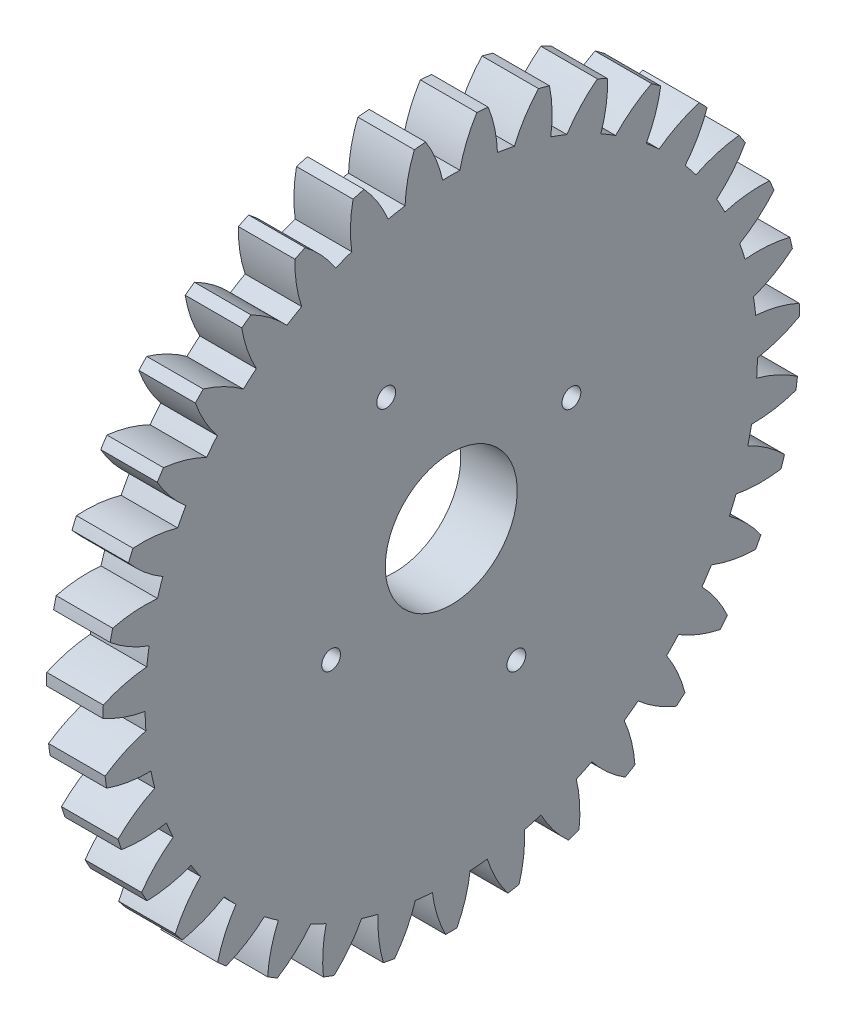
ISO-10303-21;
HEADER;
FILE_DESCRIPTION(('STEP AP214'),'2;1');
FILE_NAME('part.step','',(''),(''),'','','');
FILE_SCHEMA(('AUTOMOTIVE_DESIGN { 1 0 10303 214 1 1 1 1 }'));
ENDSEC;
DATA;
#1=APPLICATION_CONTEXT('core data for automotive mechanical design processes');
#2=APPLICATION_PROTOCOL_DEFINITION('international standard','automotive_design',2000,#1);
#3=PRODUCT_CONTEXT('',#1,'mechanical');
#4=PRODUCT('Part','Part','',(#3));
#5=PRODUCT_RELATED_PRODUCT_CATEGORY('part','',(#4));
#6=PRODUCT_DEFINITION_FORMATION('','',#4);
#7=PRODUCT_DEFINITION_CONTEXT('part definition',#1,'design');
#8=PRODUCT_DEFINITION('design','',#6,#7);
#9=PRODUCT_DEFINITION_SHAPE('','',#8);
#10=(LENGTH_UNIT() NAMED_UNIT(*) SI_UNIT(.MILLI.,.METRE.));
#11=(NAMED_UNIT(*) PLANE_ANGLE_UNIT() SI_UNIT($,.RADIAN.));
#12=(NAMED_UNIT(*) SI_UNIT($,.STERADIAN.) SOLID_ANGLE_UNIT());
#13=UNCERTAINTY_MEASURE_WITH_UNIT(LENGTH_MEASURE(1.E-05),#10,'distance_accuracy_value','');
#14=(GEOMETRIC_REPRESENTATION_CONTEXT(3) GLOBAL_UNCERTAINTY_ASSIGNED_CONTEXT((#13)) GLOBAL_UNIT_ASSIGNED_CONTEXT((#10,
#11,#12)) REPRESENTATION_CONTEXT('',''));
#15=CARTESIAN_POINT('',(0.,0.,0.));
#16=DIRECTION('',(0.,0.,1.));
#17=DIRECTION('',(1.,0.,0.));
#18=AXIS2_PLACEMENT_3D('',#15,#16,#17);
#19=CARTESIAN_POINT('',(3.,0.,0.));
#20=DIRECTION('',(-1.,0.,0.));
#21=DIRECTION('',(0.,0.,1.));
#22=AXIS2_PLACEMENT_3D('',#19,#20,#21);
#23=PLANE('',#22);
#24=CARTESIAN_POINT('',(3.00000000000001,-2.8361500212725,6.37530225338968));
#25=DIRECTION('',(1.,0.,0.));
#26=DIRECTION('',(0.,0.,-1.));
#27=AXIS2_PLACEMENT_3D('',#24,#25,#26);
#28=CIRCLE('',#27,0.499999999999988);
#29=CARTESIAN_POINT('',(3.00000000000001,-2.8361500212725,5.8753022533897));
#30=VERTEX_POINT('',#29);
#31=EDGE_CURVE('E2120',#30,#30,#28,.T.);
#32=ORIENTED_EDGE('',*,*,#31,.F.);
#33=EDGE_LOOP('',(#32));
#34=FACE_BOUND('',#33,.T.);
#35=CARTESIAN_POINT('',(3.00000000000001,7.76618498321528,3.4549053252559));
#36=DIRECTION('',(1.,0.,0.));
#37=DIRECTION('',(0.,0.,-1.));
#38=AXIS2_PLACEMENT_3D('',#35,#36,#37);
#39=CIRCLE('',#38,0.499999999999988);
#40=CARTESIAN_POINT('',(3.00000000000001,7.76618498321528,2.95490532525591));
#41=VERTEX_POINT('',#40);
#42=EDGE_CURVE('E2124',#41,#41,#39,.T.);
#43=ORIENTED_EDGE('',*,*,#42,.F.);
#44=EDGE_LOOP('',(#43));
#45=FACE_BOUND('',#44,.T.);
#46=CARTESIAN_POINT('',(3.00000000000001,2.83615002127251,-6.37530225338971));
#47=DIRECTION('',(1.,0.,0.));
#48=DIRECTION('',(0.,0.,-1.));
#49=AXIS2_PLACEMENT_3D('',#46,#47,#48);
#50=CIRCLE('',#49,0.499999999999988);
#51=CARTESIAN_POINT('',(3.00000000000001,2.83615002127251,-6.8753022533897));
#52=VERTEX_POINT('',#51);
#53=EDGE_CURVE('E2128',#52,#52,#50,.T.);
#54=ORIENTED_EDGE('',*,*,#53,.F.);
#55=EDGE_LOOP('',(#54));
#56=FACE_BOUND('',#55,.T.);
#57=CARTESIAN_POINT('',(3.00000000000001,-7.76618498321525,-3.45490532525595));
#58=DIRECTION('',(1.,0.,0.));
#59=DIRECTION('',(0.,0.,-1.));
#60=AXIS2_PLACEMENT_3D('',#57,#58,#59);
#61=CIRCLE('',#60,0.499999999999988);
#62=CARTESIAN_POINT('',(3.00000000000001,-7.76618498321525,-3.95490532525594));
#63=VERTEX_POINT('',#62);
#64=EDGE_CURVE('E2132',#63,#63,#61,.T.);
#65=ORIENTED_EDGE('',*,*,#64,.F.);
#66=EDGE_LOOP('',(#65));
#67=FACE_BOUND('',#66,.T.);
#68=CARTESIAN_POINT('',(3.,0.,0.));
#69=DIRECTION('',(-1.,0.,0.));
#70=DIRECTION('',(0.,0.,1.));
#71=AXIS2_PLACEMENT_3D('',#68,#69,#70);
#72=CIRCLE('',#71,3.5);
#73=CARTESIAN_POINT('',(3.,0.,3.5));
#74=VERTEX_POINT('',#73);
#75=EDGE_CURVE('E1370',#74,#74,#72,.F.);
#76=ORIENTED_EDGE('',*,*,#75,.F.);
#77=EDGE_LOOP('',(#76));
#78=FACE_BOUND('',#77,.T.);
#79=CARTESIAN_POINT('',(3.,6.62436355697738,15.0513575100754));
#80=DIRECTION('',(-1.,0.,0.));
#81=DIRECTION('',(0.,0.998993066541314,0.0448648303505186));
#82=AXIS2_PLACEMENT_3D('',#79,#80,#81);
#83=CIRCLE('',#82,7.);
#84=CARTESIAN_POINT('',(3.,-0.272819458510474,16.2467095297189));
#85=VERTEX_POINT('',#84);
#86=CARTESIAN_POINT('',(3.,0.528553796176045,18.492447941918));
#87=VERTEX_POINT('',#86);
#88=EDGE_CURVE('E969',#85,#87,#83,.T.);
#89=ORIENTED_EDGE('',*,*,#88,.F.);
#90=CARTESIAN_POINT('',(3.,0.,0.));
#91=DIRECTION('',(-1.,0.,0.));
#92=DIRECTION('',(0.,0.998993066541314,0.0448648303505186));
#93=AXIS2_PLACEMENT_3D('',#90,#91,#92);
#94=CIRCLE('',#93,16.249);
#95=CARTESIAN_POINT('',(3.,-1.18462264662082,16.2057604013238));
#96=VERTEX_POINT('',#95);
#97=EDGE_CURVE('E974',#96,#85,#94,.T.);
#98=ORIENTED_EDGE('',*,*,#97,.F.);
#99=CARTESIAN_POINT('',(3.,-7.9468891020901,14.3969617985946));
#100=DIRECTION('',(-1.,0.,0.));
#101=DIRECTION('',(0.,0.998993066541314,0.0448648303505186));
#102=AXIS2_PLACEMENT_3D('',#99,#100,#101);
#103=CIRCLE('',#102,7.);
#104=CARTESIAN_POINT('',(3.,-2.18407624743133,18.370623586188));
#105=VERTEX_POINT('',#104);
#106=EDGE_CURVE('E971',#105,#96,#103,.T.);
#107=ORIENTED_EDGE('',*,*,#106,.F.);
#108=CARTESIAN_POINT('',(3.,0.,0.));
#109=DIRECTION('',(-1.,0.,0.));
#110=DIRECTION('',(0.,0.,1.));
#111=AXIS2_PLACEMENT_3D('',#108,#109,#110);
#112=CIRCLE('',#111,18.5);
#113=CARTESIAN_POINT('',(3.,-2.78189436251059,18.2896436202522));
#114=VERTEX_POINT('',#113);
#115=EDGE_CURVE('E1900',#114,#105,#112,.T.);
#116=ORIENTED_EDGE('',*,*,#115,.F.);
#117=CARTESIAN_POINT('',(3.,3.83038364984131,15.9923017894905));
#118=DIRECTION('',(-1.,0.,0.));
#119=DIRECTION('',(0.,0.974927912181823,0.222520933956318));
#120=AXIS2_PLACEMENT_3D('',#117,#118,#119);
#121=CIRCLE('',#120,7.);
#122=CARTESIAN_POINT('',(3.,-3.16939714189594,15.9369044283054));
#123=VERTEX_POINT('',#122);
#124=EDGE_CURVE('E1121',#123,#114,#121,.T.);
#125=ORIENTED_EDGE('',*,*,#124,.F.);
#126=CARTESIAN_POINT('',(3.,0.,0.));
#127=DIRECTION('',(-1.,0.,0.));
#128=DIRECTION('',(0.,0.974927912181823,0.222520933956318));
#129=AXIS2_PLACEMENT_3D('',#126,#127,#128);
#130=CIRCLE('',#129,16.249);
#131=CARTESIAN_POINT('',(3.,-4.05923552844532,15.7338046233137));
#132=VERTEX_POINT('',#131);
#133=EDGE_CURVE('E1126',#132,#123,#130,.T.);
#134=ORIENTED_EDGE('',*,*,#133,.F.);
#135=CARTESIAN_POINT('',(3.,-10.3898561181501,12.7466248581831));
#136=DIRECTION('',(-1.,0.,0.));
#137=DIRECTION('',(0.,0.974927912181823,0.222520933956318));
#138=AXIS2_PLACEMENT_3D('',#135,#136,#137);
#139=CIRCLE('',#138,7.);
#140=CARTESIAN_POINT('',(3.,-5.42917874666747,17.6854182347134));
#141=VERTEX_POINT('',#140);
#142=EDGE_CURVE('E1123',#141,#132,#139,.T.);
#143=ORIENTED_EDGE('',*,*,#142,.F.);
#144=CARTESIAN_POINT('',(3.,-6.00293014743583,17.4989951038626));
#145=VERTEX_POINT('',#144);
#146=EDGE_CURVE('E1878',#145,#141,#112,.T.);
#147=ORIENTED_EDGE('',*,*,#146,.F.);
#148=CARTESIAN_POINT('',(3.,0.91329206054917,16.4192403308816));
#149=DIRECTION('',(-1.,0.,0.));
#150=DIRECTION('',(0.,0.919527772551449,0.393025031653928));
#151=AXIS2_PLACEMENT_3D('',#148,#149,#150);
#152=CIRCLE('',#151,7.);
#153=CARTESIAN_POINT('',(3.,-5.96410779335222,15.1148741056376));
#154=VERTEX_POINT('',#153);
#155=EDGE_CURVE('E1138',#154,#145,#152,.T.);
#156=ORIENTED_EDGE('',*,*,#155,.F.);
#157=CARTESIAN_POINT('',(3.,0.,0.));
#158=DIRECTION('',(-1.,0.,0.));
#159=DIRECTION('',(0.,0.919527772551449,0.393025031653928));
#160=AXIS2_PLACEMENT_3D('',#157,#158,#159);
#161=CIRCLE('',#160,16.249);
#162=CARTESIAN_POINT('',(3.,-6.80338124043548,14.7561514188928));
#163=VERTEX_POINT('',#162);
#164=EDGE_CURVE('E1143',#163,#154,#161,.T.);
#165=ORIENTED_EDGE('',*,*,#164,.F.);
#166=CARTESIAN_POINT('',(3.,-12.4988846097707,10.6866009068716));
#167=DIRECTION('',(-1.,0.,0.));
#168=DIRECTION('',(0.,0.919527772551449,0.393025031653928));
#169=AXIS2_PLACEMENT_3D('',#166,#167,#168);
#170=CIRCLE('',#169,7.);
#171=CARTESIAN_POINT('',(3.,-8.49978297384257,16.4317889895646));
#172=VERTEX_POINT('',#171);
#173=EDGE_CURVE('E1140',#172,#163,#170,.T.);
#174=ORIENTED_EDGE('',*,*,#173,.F.);
#175=CARTESIAN_POINT('',(3.,-9.03102681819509,16.1459144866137));
#176=VERTEX_POINT('',#175);
#177=EDGE_CURVE('E2078',#176,#172,#112,.T.);
#178=ORIENTED_EDGE('',*,*,#177,.F.);
#179=CARTESIAN_POINT('',(3.,-2.03315348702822,16.3184509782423));
#180=DIRECTION('',(-1.,0.,0.));
#181=DIRECTION('',(0.,0.8345732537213,0.550896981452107));
#182=AXIS2_PLACEMENT_3D('',#179,#180,#181);
#183=CIRCLE('',#182,7.);
#184=CARTESIAN_POINT('',(3.,-8.5671271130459,13.8070392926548));
#185=VERTEX_POINT('',#184);
#186=EDGE_CURVE('E1172',#185,#176,#183,.T.);
#187=ORIENTED_EDGE('',*,*,#186,.F.);
#188=CARTESIAN_POINT('',(3.,0.,0.));
#189=DIRECTION('',(-1.,0.,0.));
#190=DIRECTION('',(0.,0.8345732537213,0.550896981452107));
#191=AXIS2_PLACEMENT_3D('',#188,#189,#190);
#192=CIRCLE('',#191,16.249);
#193=CARTESIAN_POINT('',(3.,-9.32886068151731,13.3042233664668));
#194=VERTEX_POINT('',#193);
#195=EDGE_CURVE('E1177',#194,#185,#192,.T.);
#196=ORIENTED_EDGE('',*,*,#195,.F.);
#197=CARTESIAN_POINT('',(3.,-14.2061886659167,8.28310080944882));
#198=DIRECTION('',(-1.,0.,0.));
#199=DIRECTION('',(0.,0.8345732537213,0.550896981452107));
#200=AXIS2_PLACEMENT_3D('',#197,#198,#199);
#201=CIRCLE('',#200,7.);
#202=CARTESIAN_POINT('',(3.,-11.2971971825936,14.6500285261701));
#203=VERTEX_POINT('',#202);
#204=EDGE_CURVE('E1174',#203,#194,#201,.T.);
#205=ORIENTED_EDGE('',*,*,#204,.F.);
#206=CARTESIAN_POINT('',(3.,-11.768858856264,14.2738908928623));
#207=VERTEX_POINT('',#206);
#208=EDGE_CURVE('E2072',#207,#203,#112,.T.);
#209=ORIENTED_EDGE('',*,*,#208,.F.);
#210=CARTESIAN_POINT('',(3.,-4.91425180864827,15.6931731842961));
#211=DIRECTION('',(-1.,0.,0.));
#212=DIRECTION('',(0.,0.722794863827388,0.691062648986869));
#213=AXIS2_PLACEMENT_3D('',#210,#211,#212);
#214=CIRCLE('',#213,7.);
#215=CARTESIAN_POINT('',(3.,-10.8947919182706,12.0554348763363));
#216=VERTEX_POINT('',#215);
#217=EDGE_CURVE('E1155',#216,#207,#214,.T.);
#218=ORIENTED_EDGE('',*,*,#217,.F.);
#219=CARTESIAN_POINT('',(3.,0.,0.));
#220=DIRECTION('',(-1.,0.,0.));
#221=DIRECTION('',(0.,0.722794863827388,0.691062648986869));
#222=AXIS2_PLACEMENT_3D('',#219,#220,#221);
#223=CIRCLE('',#222,16.249);
#224=CARTESIAN_POINT('',(3.,-11.554502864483,11.4246866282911));
#225=VERTEX_POINT('',#224);
#226=EDGE_CURVE('E1160',#225,#216,#223,.T.);
#227=ORIENTED_EDGE('',*,*,#226,.F.);
#228=CARTESIAN_POINT('',(3.,-15.4568941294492,5.61337503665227));
#229=DIRECTION('',(-1.,0.,0.));
#230=DIRECTION('',(0.,0.722794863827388,0.691062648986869));
#231=AXIS2_PLACEMENT_3D('',#228,#229,#230);
#232=CIRCLE('',#231,7.);
#233=CARTESIAN_POINT('',(3.,-13.7315101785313,12.3974040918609));
#234=VERTEX_POINT('',#233);
#235=EDGE_CURVE('E1157',#234,#225,#232,.T.);
#236=ORIENTED_EDGE('',*,*,#235,.F.);
#237=CARTESIAN_POINT('',(3.,-14.1284300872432,11.9430927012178));
#238=VERTEX_POINT('',#237);
#239=EDGE_CURVE('E2066',#238,#234,#112,.T.);
#240=ORIENTED_EDGE('',*,*,#239,.F.);
#241=CARTESIAN_POINT('',(3.,-7.63740203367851,14.5635038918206));
#242=DIRECTION('',(-1.,0.,0.));
#243=DIRECTION('',(0.,0.587785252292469,0.809016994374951));
#244=AXIS2_PLACEMENT_3D('',#241,#242,#243);
#245=CIRCLE('',#244,7.);
#246=CARTESIAN_POINT('',(3.,-12.8722891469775,9.91635886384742));
#247=VERTEX_POINT('',#246);
#248=EDGE_CURVE('E1070',#247,#238,#245,.T.);
#249=ORIENTED_EDGE('',*,*,#248,.F.);
#250=CARTESIAN_POINT('',(3.,0.,0.));
#251=DIRECTION('',(-1.,0.,0.));
#252=DIRECTION('',(0.,0.587785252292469,0.809016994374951));
#253=AXIS2_PLACEMENT_3D('',#250,#251,#252);
#254=CIRCLE('',#253,16.249);
#255=CARTESIAN_POINT('',(3.,-13.4087738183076,9.17795106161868));
#256=VERTEX_POINT('',#255);
#257=EDGE_CURVE('E1075',#256,#247,#254,.T.);
#258=ORIENTED_EDGE('',*,*,#257,.F.);
#259=CARTESIAN_POINT('',(3.,-16.2108022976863,2.76323077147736));
#260=DIRECTION('',(-1.,0.,0.));
#261=DIRECTION('',(0.,0.587785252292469,0.809016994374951));
#262=AXIS2_PLACEMENT_3D('',#259,#260,#261);
#263=CIRCLE('',#262,7.);
#264=CARTESIAN_POINT('',(3.,-15.7244811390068,9.74631688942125));
#265=VERTEX_POINT('',#264);
#266=EDGE_CURVE('E1072',#265,#256,#263,.T.);
#267=ORIENTED_EDGE('',*,*,#266,.F.);
#268=CARTESIAN_POINT('',(3.,-16.0339019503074,9.22843368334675));
#269=VERTEX_POINT('',#268);
#270=EDGE_CURVE('E2060',#269,#265,#112,.T.);
#271=ORIENTED_EDGE('',*,*,#270,.F.);
#272=CARTESIAN_POINT('',(3.,-10.115079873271,12.9657516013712));
#273=DIRECTION('',(-1.,0.,0.));
#274=DIRECTION('',(0.,0.433883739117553,0.900968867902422));
#275=AXIS2_PLACEMENT_3D('',#272,#273,#274);
#276=CIRCLE('',#275,7.);
#277=CARTESIAN_POINT('',(3.,-14.4360604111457,7.45856291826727));
#278=VERTEX_POINT('',#277);
#279=EDGE_CURVE('E1051',#278,#269,#276,.T.);
#280=ORIENTED_EDGE('',*,*,#279,.F.);
#281=CARTESIAN_POINT('',(3.,0.,0.));
#282=DIRECTION('',(-1.,0.,0.));
#283=DIRECTION('',(0.,0.433883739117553,0.900968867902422));
#284=AXIS2_PLACEMENT_3D('',#281,#282,#283);
#285=CIRCLE('',#284,16.249);
#286=CARTESIAN_POINT('',(3.,-14.832075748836,6.63622859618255));
#287=VERTEX_POINT('',#286);
#288=EDGE_CURVE('E1056',#287,#278,#285,.T.);
#289=ORIENTED_EDGE('',*,*,#288,.F.);
#290=CARTESIAN_POINT('',(3.,-16.4436819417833,-0.175726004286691));
#291=DIRECTION('',(-1.,0.,0.));
#292=DIRECTION('',(0.,0.433883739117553,0.900968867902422));
#293=AXIS2_PLACEMENT_3D('',#290,#291,#292);
#294=CIRCLE('',#293,7.);
#295=CARTESIAN_POINT('',(3.,-17.2120543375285,6.78197504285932));
#296=VERTEX_POINT('',#295);
#297=EDGE_CURVE('E1053',#296,#287,#294,.T.);
#298=ORIENTED_EDGE('',*,*,#297,.F.);
#299=CARTESIAN_POINT('',(3.,-17.4240310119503,6.21716521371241));
#300=VERTEX_POINT('',#299);
#301=EDGE_CURVE('E2054',#300,#296,#112,.T.);
#302=ORIENTED_EDGE('',*,*,#301,.F.);
#303=CARTESIAN_POINT('',(3.,-12.2676507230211,10.9512693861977));
#304=DIRECTION('',(-1.,0.,0.));
#305=DIRECTION('',(0.,0.266036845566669,0.963962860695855));
#306=AXIS2_PLACEMENT_3D('',#303,#304,#305);
#307=CIRCLE('',#306,7.);
#308=CARTESIAN_POINT('',(3.,-15.5358448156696,4.761042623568));
#309=VERTEX_POINT('',#308);
#310=EDGE_CURVE('E1087',#309,#300,#307,.T.);
#311=ORIENTED_EDGE('',*,*,#310,.F.);
#312=CARTESIAN_POINT('',(3.,0.,0.));
#313=DIRECTION('',(-1.,0.,0.));
#314=DIRECTION('',(0.,0.266036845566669,0.963962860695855));
#315=AXIS2_PLACEMENT_3D('',#312,#313,#314);
#316=CIRCLE('',#315,16.249);
#317=CARTESIAN_POINT('',(3.,-15.7786625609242,3.88121228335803));
#318=VERTEX_POINT('',#317);
#319=EDGE_CURVE('E1092',#318,#309,#316,.T.);
#320=ORIENTED_EDGE('',*,*,#319,.F.);
#321=CARTESIAN_POINT('',(3.,-16.1480481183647,-3.10903480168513));
#322=DIRECTION('',(-1.,0.,0.));
#323=DIRECTION('',(0.,0.266036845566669,0.963962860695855));
#324=AXIS2_PLACEMENT_3D('',#321,#322,#323);
#325=CIRCLE('',#324,7.);
#326=CARTESIAN_POINT('',(3.,-18.1464179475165,3.59965493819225));
#327=VERTEX_POINT('',#326);
#328=EDGE_CURVE('E1089',#327,#318,#325,.T.);
#329=ORIENTED_EDGE('',*,*,#328,.F.);
#330=CARTESIAN_POINT('',(3.,-18.2541373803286,3.00607193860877));
#331=VERTEX_POINT('',#330);
#332=EDGE_CURVE('E2048',#331,#327,#112,.T.);
#333=ORIENTED_EDGE('',*,*,#332,.F.);
#334=CARTESIAN_POINT('',(3.,-14.0259291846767,8.58480436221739));
#335=DIRECTION('',(-1.,0.,0.));
#336=DIRECTION('',(0.,0.0896393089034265,0.99597429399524));
#337=AXIS2_PLACEMENT_3D('',#334,#335,#336);
#338=CIRCLE('',#337,7.);
#339=CARTESIAN_POINT('',(3.,-16.1362943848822,1.91049850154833));
#340=VERTEX_POINT('',#339);
#341=EDGE_CURVE('E1104',#340,#331,#338,.T.);
#342=ORIENTED_EDGE('',*,*,#341,.F.);
#343=CARTESIAN_POINT('',(3.,0.,0.));
#344=DIRECTION('',(-1.,0.,0.));
#345=DIRECTION('',(0.,0.0896393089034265,0.99597429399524));
#346=AXIS2_PLACEMENT_3D('',#343,#344,#345);
#347=CIRCLE('',#346,16.249);
#348=CARTESIAN_POINT('',(3.,-16.2181101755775,1.00145061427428));
#349=VERTEX_POINT('',#348);
#350=EDGE_CURVE('E1109',#349,#340,#347,.T.);
#351=ORIENTED_EDGE('',*,*,#350,.F.);
#352=CARTESIAN_POINT('',(3.,-15.3334027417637,-5.94241666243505));
#353=DIRECTION('',(-1.,0.,0.));
#354=DIRECTION('',(0.,0.0896393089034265,0.99597429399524));
#355=AXIS2_PLACEMENT_3D('',#352,#353,#354);
#356=CIRCLE('',#355,7.);
#357=CARTESIAN_POINT('',(3.,-18.4975407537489,0.301638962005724));
#358=VERTEX_POINT('',#357);
#359=EDGE_CURVE('E1106',#358,#349,#356,.T.);
#360=ORIENTED_EDGE('',*,*,#359,.F.);
#361=CARTESIAN_POINT('',(3.,-18.4975407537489,-0.30163896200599));
#362=VERTEX_POINT('',#361);
#363=EDGE_CURVE('E2042',#362,#358,#112,.T.);
#364=ORIENTED_EDGE('',*,*,#363,.F.);
#365=CARTESIAN_POINT('',(3.,-15.3334027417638,5.94241666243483));
#366=DIRECTION('',(-1.,0.,0.));
#367=DIRECTION('',(0.,-0.0896393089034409,0.995974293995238));
#368=AXIS2_PLACEMENT_3D('',#365,#366,#367);
#369=CIRCLE('',#368,7.);
#370=CARTESIAN_POINT('',(3.,-16.2181101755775,-1.00145061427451));
#371=VERTEX_POINT('',#370);
#372=EDGE_CURVE('E1257',#371,#362,#369,.T.);
#373=ORIENTED_EDGE('',*,*,#372,.F.);
#374=CARTESIAN_POINT('',(3.,0.,0.));
#375=DIRECTION('',(-1.,0.,0.));
#376=DIRECTION('',(0.,-0.0896393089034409,0.995974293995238));
#377=AXIS2_PLACEMENT_3D('',#374,#375,#376);
#378=CIRCLE('',#377,16.249);
#379=CARTESIAN_POINT('',(3.,-16.1362943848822,-1.91049850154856));
#380=VERTEX_POINT('',#379);
#381=EDGE_CURVE('E1262',#380,#371,#378,.T.);
#382=ORIENTED_EDGE('',*,*,#381,.F.);
#383=CARTESIAN_POINT('',(3.,-14.0259291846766,-8.58480436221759));
#384=DIRECTION('',(-1.,0.,0.));
#385=DIRECTION('',(0.,-0.0896393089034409,0.995974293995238));
#386=AXIS2_PLACEMENT_3D('',#383,#384,#385);
#387=CIRCLE('',#386,7.);
#388=CARTESIAN_POINT('',(3.,-18.2541373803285,-3.00607193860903));
#389=VERTEX_POINT('',#388);
#390=EDGE_CURVE('E1259',#389,#380,#387,.T.);
#391=ORIENTED_EDGE('',*,*,#390,.F.);
#392=CARTESIAN_POINT('',(3.,-18.1464179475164,-3.59965493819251));
#393=VERTEX_POINT('',#392);
#394=EDGE_CURVE('E2036',#393,#389,#112,.T.);
#395=ORIENTED_EDGE('',*,*,#394,.F.);
#396=CARTESIAN_POINT('',(3.,-16.1480481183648,3.1090348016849));
#397=DIRECTION('',(-1.,0.,0.));
#398=DIRECTION('',(0.,-0.266036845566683,0.963962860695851));
#399=AXIS2_PLACEMENT_3D('',#396,#397,#398);
#400=CIRCLE('',#399,7.);
#401=CARTESIAN_POINT('',(3.,-15.7786625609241,-3.88121228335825));
#402=VERTEX_POINT('',#401);
#403=EDGE_CURVE('E1274',#402,#393,#400,.T.);
#404=ORIENTED_EDGE('',*,*,#403,.F.);
#405=CARTESIAN_POINT('',(3.,0.,0.));
#406=DIRECTION('',(-1.,0.,0.));
#407=DIRECTION('',(0.,-0.266036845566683,0.963962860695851));
#408=AXIS2_PLACEMENT_3D('',#405,#406,#407);
#409=CIRCLE('',#408,16.249);
#410=CARTESIAN_POINT('',(3.,-15.5358448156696,-4.76104262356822));
#411=VERTEX_POINT('',#410);
#412=EDGE_CURVE('E1279',#411,#402,#409,.T.);
#413=ORIENTED_EDGE('',*,*,#412,.F.);
#414=CARTESIAN_POINT('',(3.,-12.2676507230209,-10.9512693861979));
#415=DIRECTION('',(-1.,0.,0.));
#416=DIRECTION('',(0.,-0.266036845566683,0.963962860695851));
#417=AXIS2_PLACEMENT_3D('',#414,#415,#416);
#418=CIRCLE('',#417,7.);
#419=CARTESIAN_POINT('',(3.,-17.4240310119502,-6.21716521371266));
#420=VERTEX_POINT('',#419);
#421=EDGE_CURVE('E1276',#420,#411,#418,.T.);
#422=ORIENTED_EDGE('',*,*,#421,.F.);
#423=CARTESIAN_POINT('',(3.,-17.2120543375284,-6.78197504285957));
#424=VERTEX_POINT('',#423);
#425=EDGE_CURVE('E2030',#424,#420,#112,.T.);
#426=ORIENTED_EDGE('',*,*,#425,.F.);
#427=CARTESIAN_POINT('',(3.,-16.4436819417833,0.175726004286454));
#428=DIRECTION('',(-1.,0.,0.));
#429=DIRECTION('',(0.,-0.433883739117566,0.900968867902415));
#430=AXIS2_PLACEMENT_3D('',#427,#428,#429);
#431=CIRCLE('',#430,7.);
#432=CARTESIAN_POINT('',(3.,-14.8320757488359,-6.63622859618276));
#433=VERTEX_POINT('',#432);
#434=EDGE_CURVE('E1308',#433,#424,#431,.T.);
#435=ORIENTED_EDGE('',*,*,#434,.F.);
#436=CARTESIAN_POINT('',(3.,0.,0.));
#437=DIRECTION('',(-1.,0.,0.));
#438=DIRECTION('',(0.,-0.433883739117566,0.900968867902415));
#439=AXIS2_PLACEMENT_3D('',#436,#437,#438);
#440=CIRCLE('',#439,16.249);
#441=CARTESIAN_POINT('',(3.,-14.4360604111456,-7.45856291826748));
#442=VERTEX_POINT('',#441);
#443=EDGE_CURVE('E1313',#442,#433,#440,.T.);
#444=ORIENTED_EDGE('',*,*,#443,.F.);
#445=CARTESIAN_POINT('',(3.,-10.1150798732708,-12.9657516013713));
#446=DIRECTION('',(-1.,0.,0.));
#447=DIRECTION('',(0.,-0.433883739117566,0.900968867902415));
#448=AXIS2_PLACEMENT_3D('',#445,#446,#447);
#449=CIRCLE('',#448,7.);
#450=CARTESIAN_POINT('',(3.,-16.0339019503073,-9.22843368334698));
#451=VERTEX_POINT('',#450);
#452=EDGE_CURVE('E1310',#451,#442,#449,.T.);
#453=ORIENTED_EDGE('',*,*,#452,.F.);
#454=CARTESIAN_POINT('',(3.,-15.7244811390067,-9.74631688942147));
#455=VERTEX_POINT('',#454);
#456=EDGE_CURVE('E2024',#455,#451,#112,.T.);
#457=ORIENTED_EDGE('',*,*,#456,.F.);
#458=CARTESIAN_POINT('',(3.,-16.2108022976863,-2.76323077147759));
#459=DIRECTION('',(-1.,0.,0.));
#460=DIRECTION('',(0.,-0.58778525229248,0.809016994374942));
#461=AXIS2_PLACEMENT_3D('',#458,#459,#460);
#462=CIRCLE('',#461,7.);
#463=CARTESIAN_POINT('',(3.,-13.4087738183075,-9.17795106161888));
#464=VERTEX_POINT('',#463);
#465=EDGE_CURVE('E1291',#464,#455,#462,.T.);
#466=ORIENTED_EDGE('',*,*,#465,.F.);
#467=CARTESIAN_POINT('',(3.,0.,0.));
#468=DIRECTION('',(-1.,0.,0.));
#469=DIRECTION('',(0.,-0.58778525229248,0.809016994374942));
#470=AXIS2_PLACEMENT_3D('',#467,#468,#469);
#471=CIRCLE('',#470,16.249);
#472=CARTESIAN_POINT('',(3.,-12.8722891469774,-9.91635886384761));
#473=VERTEX_POINT('',#472);
#474=EDGE_CURVE('E1296',#473,#464,#471,.T.);
#475=ORIENTED_EDGE('',*,*,#474,.F.);
#476=CARTESIAN_POINT('',(3.,-7.6374020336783,-14.5635038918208));
#477=DIRECTION('',(-1.,0.,0.));
#478=DIRECTION('',(0.,-0.58778525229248,0.809016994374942));
#479=AXIS2_PLACEMENT_3D('',#476,#477,#478);
#480=CIRCLE('',#479,7.);
#481=CARTESIAN_POINT('',(3.,-14.128430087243,-11.943092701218));
#482=VERTEX_POINT('',#481);
#483=EDGE_CURVE('E1293',#482,#473,#480,.T.);
#484=ORIENTED_EDGE('',*,*,#483,.F.);
#485=CARTESIAN_POINT('',(3.,-13.7315101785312,-12.3974040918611));
#486=VERTEX_POINT('',#485);
#487=EDGE_CURVE('E2018',#486,#482,#112,.T.);
#488=ORIENTED_EDGE('',*,*,#487,.F.);
#489=CARTESIAN_POINT('',(3.,-15.4568941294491,-5.6133750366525));
#490=DIRECTION('',(-1.,0.,0.));
#491=DIRECTION('',(0.,-0.722794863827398,0.691062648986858));
#492=AXIS2_PLACEMENT_3D('',#489,#490,#491);
#493=CIRCLE('',#492,7.);
#494=CARTESIAN_POINT('',(3.,-11.5545028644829,-11.4246866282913));
#495=VERTEX_POINT('',#494);
#496=EDGE_CURVE('E1206',#495,#486,#493,.T.);
#497=ORIENTED_EDGE('',*,*,#496,.F.);
#498=CARTESIAN_POINT('',(3.,0.,0.));
#499=DIRECTION('',(-1.,0.,0.));
#500=DIRECTION('',(0.,-0.722794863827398,0.691062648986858));
#501=AXIS2_PLACEMENT_3D('',#498,#499,#500);
#502=CIRCLE('',#501,16.249);
#503=CARTESIAN_POINT('',(3.,-10.8947919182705,-12.0554348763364));
#504=VERTEX_POINT('',#503);
#505=EDGE_CURVE('E1211',#504,#495,#502,.T.);
#506=ORIENTED_EDGE('',*,*,#505,.F.);
#507=CARTESIAN_POINT('',(3.,-4.91425180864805,-15.6931731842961));
#508=DIRECTION('',(-1.,0.,0.));
#509=DIRECTION('',(0.,-0.722794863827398,0.691062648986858));
#510=AXIS2_PLACEMENT_3D('',#507,#508,#509);
#511=CIRCLE('',#510,7.);
#512=CARTESIAN_POINT('',(3.,-11.7688588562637,-14.2738908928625));
#513=VERTEX_POINT('',#512);
#514=EDGE_CURVE('E1208',#513,#504,#511,.T.);
#515=ORIENTED_EDGE('',*,*,#514,.F.);
#516=CARTESIAN_POINT('',(3.,-11.2971971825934,-14.6500285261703));
#517=VERTEX_POINT('',#516);
#518=EDGE_CURVE('E2012',#517,#513,#112,.T.);
#519=ORIENTED_EDGE('',*,*,#518,.F.);
#520=CARTESIAN_POINT('',(3.,-14.2061886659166,-8.28310080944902));
#521=DIRECTION('',(-1.,0.,0.));
#522=DIRECTION('',(0.,-0.834573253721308,0.550896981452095));
#523=AXIS2_PLACEMENT_3D('',#520,#521,#522);
#524=CIRCLE('',#523,7.);
#525=CARTESIAN_POINT('',(3.,-9.32886068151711,-13.3042233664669));
#526=VERTEX_POINT('',#525);
#527=EDGE_CURVE('E1187',#526,#517,#524,.T.);
#528=ORIENTED_EDGE('',*,*,#527,.F.);
#529=CARTESIAN_POINT('',(3.,0.,0.));
#530=DIRECTION('',(-1.,0.,0.));
#531=DIRECTION('',(0.,-0.834573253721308,0.550896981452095));
#532=AXIS2_PLACEMENT_3D('',#529,#530,#531);
#533=CIRCLE('',#532,16.249);
#534=CARTESIAN_POINT('',(3.,-8.56712711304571,-13.8070392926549));
#535=VERTEX_POINT('',#534);
#536=EDGE_CURVE('E1192',#535,#526,#533,.T.);
#537=ORIENTED_EDGE('',*,*,#536,.F.);
#538=CARTESIAN_POINT('',(3.,-2.03315348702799,-16.3184509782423));
#539=DIRECTION('',(-1.,0.,0.));
#540=DIRECTION('',(0.,-0.834573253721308,0.550896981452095));
#541=AXIS2_PLACEMENT_3D('',#538,#539,#540);
#542=CIRCLE('',#541,7.);
#543=CARTESIAN_POINT('',(3.,-9.03102681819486,-16.1459144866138));
#544=VERTEX_POINT('',#543);
#545=EDGE_CURVE('E1189',#544,#535,#542,.T.);
#546=ORIENTED_EDGE('',*,*,#545,.F.);
#547=CARTESIAN_POINT('',(3.,-8.49978297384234,-16.4317889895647));
#548=VERTEX_POINT('',#547);
#549=EDGE_CURVE('E2006',#548,#544,#112,.T.);
#550=ORIENTED_EDGE('',*,*,#549,.F.);
#551=CARTESIAN_POINT('',(3.,-12.4988846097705,-10.6866009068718));
#552=DIRECTION('',(-1.,0.,0.));
#553=DIRECTION('',(0.,-0.919527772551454,0.393025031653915));
#554=AXIS2_PLACEMENT_3D('',#551,#552,#553);
#555=CIRCLE('',#554,7.);
#556=CARTESIAN_POINT('',(3.,-6.80338124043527,-14.7561514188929));
#557=VERTEX_POINT('',#556);
#558=EDGE_CURVE('E1223',#557,#548,#555,.T.);
#559=ORIENTED_EDGE('',*,*,#558,.F.);
#560=CARTESIAN_POINT('',(3.,0.,0.));
#561=DIRECTION('',(-1.,0.,0.));
#562=DIRECTION('',(0.,-0.919527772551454,0.393025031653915));
#563=AXIS2_PLACEMENT_3D('',#560,#561,#562);
#564=CIRCLE('',#563,16.249);
#565=CARTESIAN_POINT('',(3.,-5.964107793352,-15.1148741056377));
#566=VERTEX_POINT('',#565);
#567=EDGE_CURVE('E1228',#566,#557,#564,.T.);
#568=ORIENTED_EDGE('',*,*,#567,.F.);
#569=CARTESIAN_POINT('',(3.,0.913292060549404,-16.4192403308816));
#570=DIRECTION('',(-1.,0.,0.));
#571=DIRECTION('',(0.,-0.919527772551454,0.393025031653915));
#572=AXIS2_PLACEMENT_3D('',#569,#570,#571);
#573=CIRCLE('',#572,7.);
#574=CARTESIAN_POINT('',(3.,-6.00293014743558,-17.4989951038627));
#575=VERTEX_POINT('',#574);
#576=EDGE_CURVE('E1225',#575,#566,#573,.T.);
#577=ORIENTED_EDGE('',*,*,#576,.F.);
#578=CARTESIAN_POINT('',(3.,-5.42917874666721,-17.6854182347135));
#579=VERTEX_POINT('',#578);
#580=EDGE_CURVE('E2000',#579,#575,#112,.T.);
#581=ORIENTED_EDGE('',*,*,#580,.F.);
#582=CARTESIAN_POINT('',(3.,-10.3898561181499,-12.7466248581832));
#583=DIRECTION('',(-1.,0.,0.));
#584=DIRECTION('',(0.,-0.974927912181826,0.222520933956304));
#585=AXIS2_PLACEMENT_3D('',#582,#583,#584);
#586=CIRCLE('',#585,7.);
#587=CARTESIAN_POINT('',(3.,-4.05923552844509,-15.7338046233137));
#588=VERTEX_POINT('',#587);
#589=EDGE_CURVE('E1240',#588,#579,#586,.T.);
#590=ORIENTED_EDGE('',*,*,#589,.F.);
#591=CARTESIAN_POINT('',(3.,0.,0.));
#592=DIRECTION('',(-1.,0.,0.));
#593=DIRECTION('',(0.,-0.974927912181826,0.222520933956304));
#594=AXIS2_PLACEMENT_3D('',#591,#592,#593);
#595=CIRCLE('',#594,16.249);
#596=CARTESIAN_POINT('',(3.,-3.1693971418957,-15.9369044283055));
#597=VERTEX_POINT('',#596);
#598=EDGE_CURVE('E1245',#597,#588,#595,.T.);
#599=ORIENTED_EDGE('',*,*,#598,.F.);
#600=CARTESIAN_POINT('',(3.,3.83038364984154,-15.9923017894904));
#601=DIRECTION('',(-1.,0.,0.));
#602=DIRECTION('',(0.,-0.974927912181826,0.222520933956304));
#603=AXIS2_PLACEMENT_3D('',#600,#601,#602);
#604=CIRCLE('',#603,7.);
#605=CARTESIAN_POINT('',(3.,-2.78189436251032,-18.2896436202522));
#606=VERTEX_POINT('',#605);
#607=EDGE_CURVE('E1242',#606,#597,#604,.T.);
#608=ORIENTED_EDGE('',*,*,#607,.F.);
#609=CARTESIAN_POINT('',(3.,-2.18407624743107,-18.370623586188));
#610=VERTEX_POINT('',#609);
#611=EDGE_CURVE('E1994',#610,#606,#112,.T.);
#612=ORIENTED_EDGE('',*,*,#611,.F.);
#613=CARTESIAN_POINT('',(3.,-7.9468891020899,-14.3969617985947));
#614=DIRECTION('',(-1.,0.,0.));
#615=DIRECTION('',(0.,-0.998993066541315,0.0448648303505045));
#616=AXIS2_PLACEMENT_3D('',#613,#614,#615);
#617=CIRCLE('',#616,7.);
#618=CARTESIAN_POINT('',(3.,-1.18462264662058,-16.2057604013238));
#619=VERTEX_POINT('',#618);
#620=EDGE_CURVE('E1410',#619,#610,#617,.T.);
#621=ORIENTED_EDGE('',*,*,#620,.F.);
#622=CARTESIAN_POINT('',(3.,0.,0.));
#623=DIRECTION('',(-1.,0.,0.));
#624=DIRECTION('',(0.,-0.998993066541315,0.0448648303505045));
#625=AXIS2_PLACEMENT_3D('',#622,#623,#624);
#626=CIRCLE('',#625,16.249);
#627=CARTESIAN_POINT('',(3.,-0.272819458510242,-16.2467095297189));
#628=VERTEX_POINT('',#627);
#629=EDGE_CURVE('E1415',#628,#619,#626,.T.);
#630=ORIENTED_EDGE('',*,*,#629,.F.);
#631=CARTESIAN_POINT('',(3.,6.62436355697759,-15.0513575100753));
#632=DIRECTION('',(-1.,0.,0.));
#633=DIRECTION('',(0.,-0.998993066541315,0.0448648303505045));
#634=AXIS2_PLACEMENT_3D('',#631,#632,#633);
#635=CIRCLE('',#634,7.);
#636=CARTESIAN_POINT('',(3.,0.528553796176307,-18.492447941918));
#637=VERTEX_POINT('',#636);
#638=EDGE_CURVE('E1412',#637,#628,#635,.T.);
#639=ORIENTED_EDGE('',*,*,#638,.F.);
#640=CARTESIAN_POINT('',(3.,1.13122425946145,-18.465381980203));
#641=VERTEX_POINT('',#640);
#642=EDGE_CURVE('E1988',#641,#637,#112,.T.);
#643=ORIENTED_EDGE('',*,*,#642,.F.);
#644=CARTESIAN_POINT('',(3.,-5.24850253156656,-15.5845685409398));
#645=DIRECTION('',(-1.,0.,0.));
#646=DIRECTION('',(0.,-0.990949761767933,-0.134233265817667));
#647=AXIS2_PLACEMENT_3D('',#644,#645,#646);
#648=CIRCLE('',#647,7.);
#649=CARTESIAN_POINT('',(3.,1.72806498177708,-16.1568497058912));
#650=VERTEX_POINT('',#649);
#651=EDGE_CURVE('E1427',#650,#641,#648,.T.);
#652=ORIENTED_EDGE('',*,*,#651,.F.);
#653=CARTESIAN_POINT('',(3.,0.,0.));
#654=DIRECTION('',(-1.,0.,0.));
#655=DIRECTION('',(0.,-0.990949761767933,-0.134233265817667));
#656=AXIS2_PLACEMENT_3D('',#653,#654,#655);
#657=CIRCLE('',#656,16.249);
#658=CARTESIAN_POINT('',(3.,2.63252686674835,-16.03433201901));
#659=VERTEX_POINT('',#658);
#660=EDGE_CURVE('E1432',#659,#650,#657,.T.);
#661=ORIENTED_EDGE('',*,*,#660,.F.);
#662=CARTESIAN_POINT('',(3.,9.20543096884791,-13.6266502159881));
#663=DIRECTION('',(-1.,0.,0.));
#664=DIRECTION('',(0.,-0.990949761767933,-0.134233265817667));
#665=AXIS2_PLACEMENT_3D('',#662,#663,#664);
#666=CIRCLE('',#665,7.);
#667=CARTESIAN_POINT('',(3.,3.82201380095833,-18.1008897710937));
#668=VERTEX_POINT('',#667);
#669=EDGE_CURVE('E1429',#668,#659,#666,.T.);
#670=ORIENTED_EDGE('',*,*,#669,.F.);
#671=CARTESIAN_POINT('',(3.,4.41016628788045,-17.9666478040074));
#672=VERTEX_POINT('',#671);
#673=EDGE_CURVE('E1982',#672,#668,#112,.T.);
#674=ORIENTED_EDGE('',*,*,#673,.F.);
#675=CARTESIAN_POINT('',(3.,-2.38142477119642,-16.2712744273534));
#676=DIRECTION('',(-1.,0.,0.));
#677=DIRECTION('',(0.,-0.95105651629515,-0.309016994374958));
#678=AXIS2_PLACEMENT_3D('',#675,#676,#677);
#679=CIRCLE('',#678,7.);
#680=CARTESIAN_POINT('',(3.,4.58521117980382,-15.588644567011));
#681=VERTEX_POINT('',#680);
#682=EDGE_CURVE('E1444',#681,#672,#679,.T.);
#683=ORIENTED_EDGE('',*,*,#682,.F.);
#684=CARTESIAN_POINT('',(3.,0.,0.));
#685=DIRECTION('',(-1.,0.,0.));
#686=DIRECTION('',(0.,-0.95105651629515,-0.309016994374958));
#687=AXIS2_PLACEMENT_3D('',#684,#685,#686);
#688=CIRCLE('',#687,16.249);
#689=CARTESIAN_POINT('',(3.,5.45326161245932,-15.3065978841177));
#690=VERTEX_POINT('',#689);
#691=EDGE_CURVE('E1449',#690,#681,#688,.T.);
#692=ORIENTED_EDGE('',*,*,#691,.F.);
#693=CARTESIAN_POINT('',(3.,11.4906282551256,-11.7639711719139));
#694=DIRECTION('',(-1.,0.,0.));
#695=DIRECTION('',(0.,-0.95105651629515,-0.309016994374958));
#696=AXIS2_PLACEMENT_3D('',#693,#694,#695);
#697=CIRCLE('',#696,7.);
#698=CARTESIAN_POINT('',(3.,6.99263113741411,-17.1275541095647));
#699=VERTEX_POINT('',#698);
#700=EDGE_CURVE('E1446',#699,#690,#697,.T.);
#701=ORIENTED_EDGE('',*,*,#700,.F.);
#702=CARTESIAN_POINT('',(3.,7.54736194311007,-16.8904507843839));
#703=VERTEX_POINT('',#702);
#704=EDGE_CURVE('E1976',#703,#699,#112,.T.);
#705=ORIENTED_EDGE('',*,*,#704,.F.);
#706=CARTESIAN_POINT('',(3.,0.56219394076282,-16.4350081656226));
#707=DIRECTION('',(-1.,0.,0.));
#708=DIRECTION('',(0.,-0.880595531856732,-0.473868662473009));
#709=AXIS2_PLACEMENT_3D('',#706,#707,#708);
#710=CIRCLE('',#709,7.);
#711=CARTESIAN_POINT('',(3.,7.29498491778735,-14.5194075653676));
#712=VERTEX_POINT('',#711);
#713=EDGE_CURVE('E1461',#712,#703,#710,.T.);
#714=ORIENTED_EDGE('',*,*,#713,.F.);
#715=CARTESIAN_POINT('',(3.,0.,0.));
#716=DIRECTION('',(-1.,0.,0.));
#717=DIRECTION('',(0.,-0.880595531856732,-0.473868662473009));
#718=AXIS2_PLACEMENT_3D('',#715,#716,#717);
#719=CIRCLE('',#718,16.249);
#720=CARTESIAN_POINT('',(3.,8.09872404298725,-14.0868970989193));
#721=VERTEX_POINT('',#720);
#722=EDGE_CURVE('E1466',#721,#712,#719,.T.);
#723=ORIENTED_EDGE('',*,*,#722,.F.);
#724=CARTESIAN_POINT('',(3.,13.4065072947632,-9.52318841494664));
#725=DIRECTION('',(-1.,0.,0.));
#726=DIRECTION('',(0.,-0.880595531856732,-0.473868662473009));
#727=AXIS2_PLACEMENT_3D('',#724,#725,#726);
#728=CIRCLE('',#727,7.);
#729=CARTESIAN_POINT('',(3.,9.93849955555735,-15.6037247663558));
#730=VERTEX_POINT('',#729);
#731=EDGE_CURVE('E1463',#730,#721,#728,.T.);
#732=ORIENTED_EDGE('',*,*,#731,.F.);
#733=CARTESIAN_POINT('',(3.,10.441979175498,-15.2713807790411));
#734=VERTEX_POINT('',#733);
#735=EDGE_CURVE('E1970',#734,#730,#112,.T.);
#736=ORIENTED_EDGE('',*,*,#735,.F.);
#737=CARTESIAN_POINT('',(3.,3.48774327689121,-16.0705072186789));
#738=DIRECTION('',(-1.,0.,0.));
#739=DIRECTION('',(0.,-0.781831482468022,-0.623489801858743));
#740=AXIS2_PLACEMENT_3D('',#737,#738,#739);
#741=CIRCLE('',#740,7.);
#742=CARTESIAN_POINT('',(3.,9.77029183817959,-12.983504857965));
#743=VERTEX_POINT('',#742);
#744=EDGE_CURVE('E1393',#743,#734,#741,.T.);
#745=ORIENTED_EDGE('',*,*,#744,.F.);
#746=CARTESIAN_POINT('',(3.,0.,0.));
#747=DIRECTION('',(-1.,0.,0.));
#748=DIRECTION('',(0.,-0.781831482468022,-0.623489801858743));
#749=AXIS2_PLACEMENT_3D('',#746,#747,#748);
#750=CIRCLE('',#749,16.249);
#751=CARTESIAN_POINT('',(3.,10.4838868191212,-12.414431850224));
#752=VERTEX_POINT('',#751);
#753=EDGE_CURVE('E1398',#752,#743,#750,.T.);
#754=ORIENTED_EDGE('',*,*,#753,.F.);
#755=CARTESIAN_POINT('',(3.,14.8914901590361,-6.9763225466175));
#756=DIRECTION('',(-1.,0.,0.));
#757=DIRECTION('',(0.,-0.781831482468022,-0.623489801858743));
#758=AXIS2_PLACEMENT_3D('',#755,#756,#757);
#759=CIRCLE('',#758,7.);
#760=CARTESIAN_POINT('',(3.,12.5649364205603,-13.5783788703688));
#761=VERTEX_POINT('',#760);
#762=EDGE_CURVE('E1395',#761,#752,#759,.T.);
#763=ORIENTED_EDGE('',*,*,#762,.F.);
#764=CARTESIAN_POINT('',(3.,13.0009826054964,-13.1614760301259));
#765=VERTEX_POINT('',#764);
#766=EDGE_CURVE('E1964',#765,#761,#112,.T.);
#767=ORIENTED_EDGE('',*,*,#766,.F.);
#768=CARTESIAN_POINT('',(3.,6.30119367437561,-15.1894869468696));
#769=DIRECTION('',(-1.,0.,0.));
#770=DIRECTION('',(0.,-0.657938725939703,-0.75307146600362));
#771=AXIS2_PLACEMENT_3D('',#768,#769,#770);
#772=CIRCLE('',#771,7.);
#773=CARTESIAN_POINT('',(3.,11.9315735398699,-11.030301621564));
#774=VERTEX_POINT('',#773);
#775=EDGE_CURVE('E1376',#774,#765,#772,.T.);
#776=ORIENTED_EDGE('',*,*,#775,.F.);
#777=CARTESIAN_POINT('',(3.,0.,0.));
#778=DIRECTION('',(-1.,0.,0.));
#779=DIRECTION('',(0.,-0.657938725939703,-0.75307146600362));
#780=AXIS2_PLACEMENT_3D('',#777,#778,#779);
#781=CIRCLE('',#780,16.249);
#782=CARTESIAN_POINT('',(3.,12.5320888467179,-10.342956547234));
#783=VERTEX_POINT('',#782);
#784=EDGE_CURVE('E1381',#783,#774,#781,.T.);
#785=ORIENTED_EDGE('',*,*,#784,.F.);
#786=CARTESIAN_POINT('',(3.,15.8978482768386,-4.20523193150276));
#787=DIRECTION('',(-1.,0.,0.));
#788=DIRECTION('',(0.,-0.657938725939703,-0.75307146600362));
#789=AXIS2_PLACEMENT_3D('',#786,#787,#788);
#790=CIRCLE('',#789,7.);
#791=CARTESIAN_POINT('',(3.,14.7875258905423,-11.1166127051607));
#792=VERTEX_POINT('',#791);
#793=EDGE_CURVE('E1378',#792,#783,#790,.T.);
#794=ORIENTED_EDGE('',*,*,#793,.F.);
#795=CARTESIAN_POINT('',(3.,15.14212375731,-10.628550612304));
#796=VERTEX_POINT('',#795);
#797=EDGE_CURVE('E1958',#796,#792,#112,.T.);
#798=ORIENTED_EDGE('',*,*,#797,.F.);
#799=CARTESIAN_POINT('',(3.,8.91211852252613,-13.8202640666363));
#800=DIRECTION('',(-1.,0.,0.));
#801=DIRECTION('',(0.,-0.512899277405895,-0.858448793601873));
#802=AXIS2_PLACEMENT_3D('',#799,#800,#801);
#803=CIRCLE('',#802,7.);
#804=CARTESIAN_POINT('',(3.,13.7093646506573,-8.72257541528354));
#805=VERTEX_POINT('',#804);
#806=EDGE_CURVE('E1323',#805,#796,#803,.T.);
#807=ORIENTED_EDGE('',*,*,#806,.F.);
#808=CARTESIAN_POINT('',(3.,0.,0.));
#809=DIRECTION('',(-1.,0.,0.));
#810=DIRECTION('',(0.,-0.512899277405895,-0.858448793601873));
#811=AXIS2_PLACEMENT_3D('',#808,#809,#810);
#812=CIRCLE('',#811,16.249);
#813=CARTESIAN_POINT('',(3.,14.1774992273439,-7.93905011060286));
#814=VERTEX_POINT('',#813);
#815=EDGE_CURVE('E1328',#814,#805,#812,.T.);
#816=ORIENTED_EDGE('',*,*,#815,.F.);
#817=CARTESIAN_POINT('',(3.,16.3932364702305,-1.29898170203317));
#818=DIRECTION('',(-1.,0.,0.));
#819=DIRECTION('',(0.,-0.512899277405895,-0.858448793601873));
#820=AXIS2_PLACEMENT_3D('',#817,#818,#819);
#821=CIRCLE('',#820,7.);
#822=CARTESIAN_POINT('',(3.,16.5348321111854,-8.29754946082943));
#823=VERTEX_POINT('',#822);
#824=EDGE_CURVE('E1325',#823,#814,#821,.T.);
#825=ORIENTED_EDGE('',*,*,#824,.F.);
#826=CARTESIAN_POINT('',(3.,16.7965845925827,-7.75401483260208));
#827=VERTEX_POINT('',#826);
#828=EDGE_CURVE('E1952',#827,#823,#112,.T.);
#829=ORIENTED_EDGE('',*,*,#828,.F.);
#830=CARTESIAN_POINT('',(3.,11.2366005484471,-12.0068465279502));
#831=DIRECTION('',(-1.,0.,0.));
#832=DIRECTION('',(0.,-0.351374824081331,-0.936234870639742));
#833=AXIS2_PLACEMENT_3D('',#830,#831,#832);
#834=CIRCLE('',#833,7.);
#835=CARTESIAN_POINT('',(3.,15.0465255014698,-6.13449845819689));
#836=VERTEX_POINT('',#835);
#837=EDGE_CURVE('E1342',#836,#827,#834,.T.);
#838=ORIENTED_EDGE('',*,*,#837,.F.);
#839=CARTESIAN_POINT('',(3.,0.,0.));
#840=DIRECTION('',(-1.,0.,0.));
#841=DIRECTION('',(0.,-0.351374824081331,-0.936234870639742));
#842=AXIS2_PLACEMENT_3D('',#839,#840,#841);
#843=CIRCLE('',#842,16.249);
#844=CARTESIAN_POINT('',(3.,15.3672331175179,-5.27997607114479));
#845=VERTEX_POINT('',#844);
#846=EDGE_CURVE('E1347',#845,#836,#843,.T.);
#847=ORIENTED_EDGE('',*,*,#846,.F.);
#848=CARTESIAN_POINT('',(3.,16.3617325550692,1.64901886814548));
#849=DIRECTION('',(-1.,0.,0.));
#850=DIRECTION('',(0.,-0.351374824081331,-0.936234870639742));
#851=AXIS2_PLACEMENT_3D('',#848,#849,#850);
#852=CIRCLE('',#851,7.);
#853=CARTESIAN_POINT('',(3.,17.7506952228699,-5.21179614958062));
#854=VERTEX_POINT('',#853);
#855=EDGE_CURVE('E1344',#854,#845,#852,.T.);
#856=ORIENTED_EDGE('',*,*,#855,.F.);
#857=CARTESIAN_POINT('',(3.,17.911189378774,-4.63025863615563));
#858=VERTEX_POINT('',#857);
#859=EDGE_CURVE('E1661',#858,#854,#112,.T.);
#860=ORIENTED_EDGE('',*,*,#859,.F.);
#861=CARTESIAN_POINT('',(3.,13.1999289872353,-9.80751906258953));
#862=DIRECTION('',(-1.,0.,0.));
#863=DIRECTION('',(0.,-0.178556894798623,-0.983929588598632));
#864=AXIS2_PLACEMENT_3D('',#861,#862,#863);
#865=CIRCLE('',#864,7.);
#866=CARTESIAN_POINT('',(3.,15.9000786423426,-3.34925367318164));
#867=VERTEX_POINT('',#866);
#868=EDGE_CURVE('E1359',#867,#858,#865,.T.);
#869=ORIENTED_EDGE('',*,*,#868,.F.);
#870=CARTESIAN_POINT('',(3.,0.,0.));
#871=DIRECTION('',(-1.,0.,0.));
#872=DIRECTION('',(0.,-0.178556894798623,-0.983929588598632));
#873=AXIS2_PLACEMENT_3D('',#870,#871,#872);
#874=CIRCLE('',#873,16.249);
#875=CARTESIAN_POINT('',(3.,16.0630514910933,-2.45119925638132));
#876=VERTEX_POINT('',#875);
#877=EDGE_CURVE('E1364',#876,#867,#874,.T.);
#878=ORIENTED_EDGE('',*,*,#877,.F.);
#879=CARTESIAN_POINT('',(3.,15.8043490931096,4.54401861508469));
#880=DIRECTION('',(-1.,0.,0.));
#881=DIRECTION('',(0.,-0.178556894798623,-0.983929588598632));
#882=AXIS2_PLACEMENT_3D('',#879,#880,#881);
#883=CIRCLE('',#882,7.);
#884=CARTESIAN_POINT('',(3.,18.3960363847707,-1.95853142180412));
#885=VERTEX_POINT('',#884);
#886=EDGE_CURVE('E1361',#885,#876,#883,.T.);
#887=ORIENTED_EDGE('',*,*,#886,.F.);
#888=CARTESIAN_POINT('',(3.,18.4501138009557,-1.35768211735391));
#889=VERTEX_POINT('',#888);
#890=EDGE_CURVE('E1657',#889,#885,#112,.T.);
#891=ORIENTED_EDGE('',*,*,#890,.F.);
#892=CARTESIAN_POINT('',(3.,14.7390008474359,-7.2929698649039));
#893=DIRECTION('',(-1.,0.,0.));
#894=DIRECTION('',(0.,0.,-1.));
#895=AXIS2_PLACEMENT_3D('',#892,#893,#894);
#896=CIRCLE('',#895,7.);
#897=CARTESIAN_POINT('',(3.,16.2425901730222,-0.456361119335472));
#898=VERTEX_POINT('',#897);
#899=EDGE_CURVE('E1629',#898,#889,#896,.T.);
#900=ORIENTED_EDGE('',*,*,#899,.F.);
#901=CARTESIAN_POINT('',(3.,0.,0.));
#902=DIRECTION('',(-1.,0.,0.));
#903=DIRECTION('',(0.,0.,-1.));
#904=AXIS2_PLACEMENT_3D('',#901,#902,#903);
#905=CIRCLE('',#904,16.249);
#906=CARTESIAN_POINT('',(3.,16.2425901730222,0.456361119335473));
#907=VERTEX_POINT('',#906);
#908=EDGE_CURVE('E1634',#907,#898,#905,.T.);
#909=ORIENTED_EDGE('',*,*,#908,.F.);
#910=CARTESIAN_POINT('',(3.,14.7390008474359,7.2929698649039));
#911=DIRECTION('',(-1.,0.,0.));
#912=DIRECTION('',(0.,0.,-1.));
#913=AXIS2_PLACEMENT_3D('',#910,#911,#912);
#914=CIRCLE('',#913,7.);
#915=CARTESIAN_POINT('',(3.,18.4501138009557,1.35768211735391));
#916=VERTEX_POINT('',#915);
#917=EDGE_CURVE('E1631',#916,#907,#914,.T.);
#918=ORIENTED_EDGE('',*,*,#917,.F.);
#919=CARTESIAN_POINT('',(3.,18.3960363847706,1.95853142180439));
#920=VERTEX_POINT('',#919);
#921=EDGE_CURVE('E1654',#920,#916,#112,.T.);
#922=ORIENTED_EDGE('',*,*,#921,.F.);
#923=CARTESIAN_POINT('',(3.,15.8043490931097,-4.54401861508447));
#924=DIRECTION('',(-1.,0.,0.));
#925=DIRECTION('',(0.,0.178556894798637,-0.98392958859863));
#926=AXIS2_PLACEMENT_3D('',#923,#924,#925);
#927=CIRCLE('',#926,7.);
#928=CARTESIAN_POINT('',(3.,16.0630514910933,2.45119925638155));
#929=VERTEX_POINT('',#928);
#930=EDGE_CURVE('E1607',#929,#920,#927,.T.);
#931=ORIENTED_EDGE('',*,*,#930,.F.);
#932=CARTESIAN_POINT('',(3.,0.,0.));
#933=DIRECTION('',(-1.,0.,0.));
#934=DIRECTION('',(0.,0.178556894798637,-0.98392958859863));
#935=AXIS2_PLACEMENT_3D('',#932,#933,#934);
#936=CIRCLE('',#935,16.249);
#937=CARTESIAN_POINT('',(3.,15.9000786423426,3.34925367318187));
#938=VERTEX_POINT('',#937);
#939=EDGE_CURVE('E1612',#938,#929,#936,.T.);
#940=ORIENTED_EDGE('',*,*,#939,.F.);
#941=CARTESIAN_POINT('',(3.,13.1999289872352,9.80751906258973));
#942=DIRECTION('',(-1.,0.,0.));
#943=DIRECTION('',(0.,0.178556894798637,-0.98392958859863));
#944=AXIS2_PLACEMENT_3D('',#941,#942,#943);
#945=CIRCLE('',#944,7.);
#946=CARTESIAN_POINT('',(3.,17.9111893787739,4.63025863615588));
#947=VERTEX_POINT('',#946);
#948=EDGE_CURVE('E1609',#947,#938,#945,.T.);
#949=ORIENTED_EDGE('',*,*,#948,.F.);
#950=CARTESIAN_POINT('',(3.,17.7506952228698,5.21179614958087));
#951=VERTEX_POINT('',#950);
#952=EDGE_CURVE('E1662',#951,#947,#112,.T.);
#953=ORIENTED_EDGE('',*,*,#952,.F.);
#954=CARTESIAN_POINT('',(3.,16.3617325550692,-1.64901886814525));
#955=DIRECTION('',(-1.,0.,0.));
#956=DIRECTION('',(0.,0.351374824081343,-0.936234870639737));
#957=AXIS2_PLACEMENT_3D('',#954,#955,#956);
#958=CIRCLE('',#957,7.);
#959=CARTESIAN_POINT('',(3.,15.3672331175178,5.279976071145));
#960=VERTEX_POINT('',#959);
#961=EDGE_CURVE('E1017',#960,#951,#958,.T.);
#962=ORIENTED_EDGE('',*,*,#961,.F.);
#963=CARTESIAN_POINT('',(3.,0.,0.));
#964=DIRECTION('',(-1.,0.,0.));
#965=DIRECTION('',(0.,0.351374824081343,-0.936234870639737));
#966=AXIS2_PLACEMENT_3D('',#963,#964,#965);
#967=CIRCLE('',#966,16.249);
#968=CARTESIAN_POINT('',(3.,15.0465255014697,6.1344984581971));
#969=VERTEX_POINT('',#968);
#970=EDGE_CURVE('E1022',#969,#960,#967,.T.);
#971=ORIENTED_EDGE('',*,*,#970,.F.);
#972=CARTESIAN_POINT('',(3.,11.2366005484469,12.0068465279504));
#973=DIRECTION('',(-1.,0.,0.));
#974=DIRECTION('',(0.,0.351374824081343,-0.936234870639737));
#975=AXIS2_PLACEMENT_3D('',#972,#973,#974);
#976=CIRCLE('',#975,7.);
#977=CARTESIAN_POINT('',(3.,16.7965845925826,7.75401483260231));
#978=VERTEX_POINT('',#977);
#979=EDGE_CURVE('E1019',#978,#969,#976,.T.);
#980=ORIENTED_EDGE('',*,*,#979,.F.);
#981=CARTESIAN_POINT('',(3.,16.5348321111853,8.29754946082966));
#982=VERTEX_POINT('',#981);
#983=EDGE_CURVE('E1933',#982,#978,#112,.T.);
#984=ORIENTED_EDGE('',*,*,#983,.F.);
#985=CARTESIAN_POINT('',(3.,16.3932364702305,1.2989817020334));
#986=DIRECTION('',(-1.,0.,0.));
#987=DIRECTION('',(0.,0.512899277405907,-0.858448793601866));
#988=AXIS2_PLACEMENT_3D('',#985,#986,#987);
#989=CIRCLE('',#988,7.);
#990=CARTESIAN_POINT('',(3.,14.1774992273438,7.93905011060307));
#991=VERTEX_POINT('',#990);
#992=EDGE_CURVE('E1036',#991,#982,#989,.T.);
#993=ORIENTED_EDGE('',*,*,#992,.F.);
#994=CARTESIAN_POINT('',(3.,0.,0.));
#995=DIRECTION('',(-1.,0.,0.));
#996=DIRECTION('',(0.,0.512899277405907,-0.858448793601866));
#997=AXIS2_PLACEMENT_3D('',#994,#995,#996);
#998=CIRCLE('',#997,16.249);
#999=CARTESIAN_POINT('',(3.,13.7093646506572,8.72257541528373));
#1000=VERTEX_POINT('',#999);
#1001=EDGE_CURVE('E1041',#1000,#991,#998,.T.);
#1002=ORIENTED_EDGE('',*,*,#1001,.F.);
#1003=CARTESIAN_POINT('',(3.,8.91211852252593,13.8202640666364));
#1004=DIRECTION('',(-1.,0.,0.));
#1005=DIRECTION('',(0.,0.512899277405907,-0.858448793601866));
#1006=AXIS2_PLACEMENT_3D('',#1003,#1004,#1005);
#1007=CIRCLE('',#1006,7.);
#1008=CARTESIAN_POINT('',(3.,15.1421237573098,10.6285506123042));
#1009=VERTEX_POINT('',#1008);
#1010=EDGE_CURVE('E1038',#1009,#1000,#1007,.T.);
#1011=ORIENTED_EDGE('',*,*,#1010,.F.);
#1012=CARTESIAN_POINT('',(3.,14.7875258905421,11.116612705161));
#1013=VERTEX_POINT('',#1012);
#1014=EDGE_CURVE('E1927',#1013,#1009,#112,.T.);
#1015=ORIENTED_EDGE('',*,*,#1014,.F.);
#1016=CARTESIAN_POINT('',(3.,15.8978482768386,4.20523193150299));
#1017=DIRECTION('',(-1.,0.,0.));
#1018=DIRECTION('',(0.,0.657938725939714,-0.75307146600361));
#1019=AXIS2_PLACEMENT_3D('',#1016,#1017,#1018);
#1020=CIRCLE('',#1019,7.);
#1021=CARTESIAN_POINT('',(3.,12.5320888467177,10.3429565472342));
#1022=VERTEX_POINT('',#1021);
#1023=EDGE_CURVE('E1000',#1022,#1013,#1020,.T.);
#1024=ORIENTED_EDGE('',*,*,#1023,.F.);
#1025=CARTESIAN_POINT('',(3.,0.,0.));
#1026=DIRECTION('',(-1.,0.,0.));
#1027=DIRECTION('',(0.,0.657938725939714,-0.75307146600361));
#1028=AXIS2_PLACEMENT_3D('',#1025,#1026,#1027);
#1029=CIRCLE('',#1028,16.249);
#1030=CARTESIAN_POINT('',(3.,11.9315735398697,11.0303016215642));
#1031=VERTEX_POINT('',#1030);
#1032=EDGE_CURVE('E1005',#1031,#1022,#1029,.T.);
#1033=ORIENTED_EDGE('',*,*,#1032,.F.);
#1034=CARTESIAN_POINT('',(3.,6.30119367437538,15.1894869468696));
#1035=DIRECTION('',(-1.,0.,0.));
#1036=DIRECTION('',(0.,0.657938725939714,-0.75307146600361));
#1037=AXIS2_PLACEMENT_3D('',#1034,#1035,#1036);
#1038=CIRCLE('',#1037,7.);
#1039=CARTESIAN_POINT('',(3.,13.0009826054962,13.1614760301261));
#1040=VERTEX_POINT('',#1039);
#1041=EDGE_CURVE('E1002',#1040,#1031,#1038,.T.);
#1042=ORIENTED_EDGE('',*,*,#1041,.F.);
#1043=CARTESIAN_POINT('',(3.,12.5649364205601,13.578378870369));
#1044=VERTEX_POINT('',#1043);
#1045=EDGE_CURVE('E1922',#1044,#1040,#112,.T.);
#1046=ORIENTED_EDGE('',*,*,#1045,.F.);
#1047=CARTESIAN_POINT('',(3.,14.891490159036,6.97632254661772));
#1048=DIRECTION('',(-1.,0.,0.));
#1049=DIRECTION('',(0.,0.781831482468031,-0.623489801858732));
#1050=AXIS2_PLACEMENT_3D('',#1047,#1048,#1049);
#1051=CIRCLE('',#1050,7.);
#1052=CARTESIAN_POINT('',(3.,10.4838868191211,12.4144318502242));
#1053=VERTEX_POINT('',#1052);
#1054=EDGE_CURVE('E983',#1053,#1044,#1051,.T.);
#1055=ORIENTED_EDGE('',*,*,#1054,.F.);
#1056=CARTESIAN_POINT('',(3.,0.,0.));
#1057=DIRECTION('',(-1.,0.,0.));
#1058=DIRECTION('',(0.,0.781831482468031,-0.623489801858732));
#1059=AXIS2_PLACEMENT_3D('',#1056,#1057,#1058);
#1060=CIRCLE('',#1059,16.249);
#1061=CARTESIAN_POINT('',(3.,9.77029183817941,12.9835048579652));
#1062=VERTEX_POINT('',#1061);
#1063=EDGE_CURVE('E988',#1062,#1053,#1060,.T.);
#1064=ORIENTED_EDGE('',*,*,#1063,.F.);
#1065=CARTESIAN_POINT('',(3.,3.48774327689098,16.070507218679));
#1066=DIRECTION('',(-1.,0.,0.));
#1067=DIRECTION('',(0.,0.781831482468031,-0.623489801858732));
#1068=AXIS2_PLACEMENT_3D('',#1065,#1066,#1067);
#1069=CIRCLE('',#1068,7.);
#1070=CARTESIAN_POINT('',(3.,10.4419791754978,15.2713807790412));
#1071=VERTEX_POINT('',#1070);
#1072=EDGE_CURVE('E985',#1071,#1062,#1069,.T.);
#1073=ORIENTED_EDGE('',*,*,#1072,.F.);
#1074=CARTESIAN_POINT('',(3.,9.93849955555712,15.603724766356));
#1075=VERTEX_POINT('',#1074);
#1076=EDGE_CURVE('E1918',#1075,#1071,#112,.T.);
#1077=ORIENTED_EDGE('',*,*,#1076,.F.);
#1078=CARTESIAN_POINT('',(3.,13.406507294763,9.52318841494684));
#1079=DIRECTION('',(-1.,0.,0.));
#1080=DIRECTION('',(0.,0.880595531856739,-0.473868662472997));
#1081=AXIS2_PLACEMENT_3D('',#1078,#1079,#1080);
#1082=CIRCLE('',#1081,7.);
#1083=CARTESIAN_POINT('',(3.,8.09872404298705,14.0868970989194));
#1084=VERTEX_POINT('',#1083);
#1085=EDGE_CURVE('E914',#1084,#1075,#1082,.T.);
#1086=ORIENTED_EDGE('',*,*,#1085,.F.);
#1087=CARTESIAN_POINT('',(3.,0.,0.));
#1088=DIRECTION('',(-1.,0.,0.));
#1089=DIRECTION('',(0.,0.880595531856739,-0.473868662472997));
#1090=AXIS2_PLACEMENT_3D('',#1087,#1088,#1089);
#1091=CIRCLE('',#1090,16.249);
#1092=CARTESIAN_POINT('',(3.,7.29498491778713,14.5194075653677));
#1093=VERTEX_POINT('',#1092);
#1094=EDGE_CURVE('E913',#1093,#1084,#1091,.T.);
#1095=ORIENTED_EDGE('',*,*,#1094,.F.);
#1096=CARTESIAN_POINT('',(3.,0.56219394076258,16.4350081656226));
#1097=DIRECTION('',(-1.,0.,0.));
#1098=DIRECTION('',(0.,0.880595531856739,-0.473868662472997));
#1099=AXIS2_PLACEMENT_3D('',#1096,#1097,#1098);
#1100=CIRCLE('',#1099,7.);
#1101=CARTESIAN_POINT('',(3.,7.54736194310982,16.890450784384));
#1102=VERTEX_POINT('',#1101);
#1103=EDGE_CURVE('E902',#1102,#1093,#1100,.T.);
#1104=ORIENTED_EDGE('',*,*,#1103,.F.);
#1105=CARTESIAN_POINT('',(3.,6.99263113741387,17.1275541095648));
#1106=VERTEX_POINT('',#1105);
#1107=EDGE_CURVE('E1913',#1106,#1102,#112,.T.);
#1108=ORIENTED_EDGE('',*,*,#1107,.F.);
#1109=CARTESIAN_POINT('',(3.,11.4906282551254,11.763971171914));
#1110=DIRECTION('',(-1.,0.,0.));
#1111=DIRECTION('',(0.,0.951056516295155,-0.309016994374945));
#1112=AXIS2_PLACEMENT_3D('',#1109,#1110,#1111);
#1113=CIRCLE('',#1112,7.);
#1114=CARTESIAN_POINT('',(3.,5.4532616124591,15.3065978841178));
#1115=VERTEX_POINT('',#1114);
#1116=EDGE_CURVE('E938',#1115,#1106,#1113,.T.);
#1117=ORIENTED_EDGE('',*,*,#1116,.F.);
#1118=CARTESIAN_POINT('',(3.,0.,0.));
#1119=DIRECTION('',(-1.,0.,0.));
#1120=DIRECTION('',(0.,0.951056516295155,-0.309016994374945));
#1121=AXIS2_PLACEMENT_3D('',#1118,#1119,#1120);
#1122=CIRCLE('',#1121,16.249);
#1123=CARTESIAN_POINT('',(3.,4.5852111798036,15.5886445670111));
#1124=VERTEX_POINT('',#1123);
#1125=EDGE_CURVE('E943',#1124,#1115,#1122,.T.);
#1126=ORIENTED_EDGE('',*,*,#1125,.F.);
#1127=CARTESIAN_POINT('',(3.,-2.38142477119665,16.2712744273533));
#1128=DIRECTION('',(-1.,0.,0.));
#1129=DIRECTION('',(0.,0.951056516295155,-0.309016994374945));
#1130=AXIS2_PLACEMENT_3D('',#1127,#1128,#1129);
#1131=CIRCLE('',#1130,7.);
#1132=CARTESIAN_POINT('',(3.,4.41016628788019,17.9666478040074));
#1133=VERTEX_POINT('',#1132);
#1134=EDGE_CURVE('E940',#1133,#1124,#1131,.T.);
#1135=ORIENTED_EDGE('',*,*,#1134,.F.);
#1136=CARTESIAN_POINT('',(3.,3.82201380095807,18.1008897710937));
#1137=VERTEX_POINT('',#1136);
#1138=EDGE_CURVE('E1911',#1137,#1133,#112,.T.);
#1139=ORIENTED_EDGE('',*,*,#1138,.F.);
#1140=CARTESIAN_POINT('',(3.,9.20543096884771,13.6266502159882));
#1141=DIRECTION('',(-1.,0.,0.));
#1142=DIRECTION('',(0.,0.990949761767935,-0.134233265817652));
#1143=AXIS2_PLACEMENT_3D('',#1140,#1141,#1142);
#1144=CIRCLE('',#1143,7.);
#1145=CARTESIAN_POINT('',(3.,2.63252686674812,16.03433201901));
#1146=VERTEX_POINT('',#1145);
#1147=EDGE_CURVE('E955',#1146,#1137,#1144,.T.);
#1148=ORIENTED_EDGE('',*,*,#1147,.F.);
#1149=CARTESIAN_POINT('',(3.,0.,0.));
#1150=DIRECTION('',(-1.,0.,0.));
#1151=DIRECTION('',(0.,0.990949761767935,-0.134233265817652));
#1152=AXIS2_PLACEMENT_3D('',#1149,#1150,#1151);
#1153=CIRCLE('',#1152,16.249);
#1154=CARTESIAN_POINT('',(3.,1.72806498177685,16.1568497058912));
#1155=VERTEX_POINT('',#1154);
#1156=EDGE_CURVE('E960',#1155,#1146,#1153,.T.);
#1157=ORIENTED_EDGE('',*,*,#1156,.F.);
#1158=CARTESIAN_POINT('',(3.,-5.24850253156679,15.5845685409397));
#1159=DIRECTION('',(-1.,0.,0.));
#1160=DIRECTION('',(0.,0.990949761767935,-0.134233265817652));
#1161=AXIS2_PLACEMENT_3D('',#1158,#1159,#1160);
#1162=CIRCLE('',#1161,7.);
#1163=CARTESIAN_POINT('',(3.,1.13122425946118,18.465381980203));
#1164=VERTEX_POINT('',#1163);
#1165=EDGE_CURVE('E957',#1164,#1155,#1162,.T.);
#1166=ORIENTED_EDGE('',*,*,#1165,.F.);
#1167=EDGE_CURVE('E1746',#87,#1164,#112,.T.);
#1168=ORIENTED_EDGE('',*,*,#1167,.F.);
#1169=EDGE_LOOP('',(#89,#98,#107,#116,#125,#134,#143,#147,#156,#165,#174,#178,#187,#196,#205,
#209,#218,#227,#236,#240,#249,#258,#267,#271,#280,#289,#298,#302,#311,#320,#329,#333,#342,#351,
#360,#364,#373,#382,#391,#395,#404,#413,#422,#426,#435,#444,#453,#457,#466,#475,#484,#488,#497,
#506,#515,#519,#528,#537,#546,#550,#559,#568,#577,#581,#590,#599,#608,#612,#621,#630,#639,#643,
#652,#661,#670,#674,#683,#692,#701,#705,#714,#723,#732,#736,#745,#754,#763,#767,#776,#785,#794,
#798,#807,#816,#825,#829,#838,#847,#856,#860,#869,#878,#887,#891,#900,#909,#918,#922,#931,#940,
#949,#953,#962,#971,#980,#984,#993,#1002,#1011,#1015,#1024,#1033,#1042,#1046,#1055,#1064,#1073,
#1077,#1086,#1095,#1104,#1108,#1117,#1126,#1135,#1139,#1148,#1157,#1166,#1168));
#1170=FACE_BOUND('',#1169,.T.);
#1171=ADVANCED_FACE('F45',(#34,#45,#56,#67,#78,#1170),#23,.F.);
#1172=CARTESIAN_POINT('',(-10.,0.,0.));
#1173=DIRECTION('',(-1.,0.,0.));
#1174=DIRECTION('',(0.,0.,1.));
#1175=AXIS2_PLACEMENT_3D('',#1172,#1173,#1174);
#1176=CYLINDRICAL_SURFACE('',#1175,18.5);
#1177=DIRECTION('',(-1.,0.,0.));
#1178=VECTOR('',#1177,1.);
#1179=CARTESIAN_POINT('',(1.5,0.528553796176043,18.492447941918));
#1180=LINE('',#1179,#1178);
#1181=CARTESIAN_POINT('',(0.,0.528553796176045,18.492447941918));
#1182=VERTEX_POINT('',#1181);
#1183=EDGE_CURVE('E1604',#87,#1182,#1180,.T.);
#1184=ORIENTED_EDGE('',*,*,#1183,.F.);
#1185=ORIENTED_EDGE('',*,*,#1167,.T.);
#1186=DIRECTION('',(-1.,0.,0.));
#1187=VECTOR('',#1186,1.);
#1188=CARTESIAN_POINT('',(1.5,1.13122425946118,18.465381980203));
#1189=LINE('',#1188,#1187);
#1190=CARTESIAN_POINT('',(0.,1.13122425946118,18.465381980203));
#1191=VERTEX_POINT('',#1190);
#1192=EDGE_CURVE('E1598',#1191,#1164,#1189,.F.);
#1193=ORIENTED_EDGE('',*,*,#1192,.F.);
#1194=CARTESIAN_POINT('',(0.,0.,0.));
#1195=DIRECTION('',(-1.,0.,0.));
#1196=DIRECTION('',(0.,0.,1.));
#1197=AXIS2_PLACEMENT_3D('',#1194,#1195,#1196);
#1198=CIRCLE('',#1197,18.5);
#1199=EDGE_CURVE('E1744',#1182,#1191,#1198,.T.);
#1200=ORIENTED_EDGE('',*,*,#1199,.F.);
#1201=EDGE_LOOP('',(#1184,#1185,#1193,#1200));
#1202=FACE_BOUND('',#1201,.T.);
#1203=ADVANCED_FACE('F1743',(#1202),#1176,.T.);
#1204=DIRECTION('',(-1.,0.,0.));
#1205=VECTOR('',#1204,1.);
#1206=CARTESIAN_POINT('',(1.5,-2.18407624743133,18.370623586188));
#1207=LINE('',#1206,#1205);
#1208=CARTESIAN_POINT('',(0.,-2.18407624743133,18.370623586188));
#1209=VERTEX_POINT('',#1208);
#1210=EDGE_CURVE('E1602',#1209,#105,#1207,.F.);
#1211=ORIENTED_EDGE('',*,*,#1210,.F.);
#1212=CARTESIAN_POINT('',(0.,-2.78189436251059,18.2896436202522));
#1213=VERTEX_POINT('',#1212);
#1214=EDGE_CURVE('E1748',#1213,#1209,#1198,.T.);
#1215=ORIENTED_EDGE('',*,*,#1214,.F.);
#1216=DIRECTION('',(-1.,0.,0.));
#1217=VECTOR('',#1216,1.);
#1218=CARTESIAN_POINT('',(1.5,-2.78189436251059,18.2896436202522));
#1219=LINE('',#1218,#1217);
#1220=EDGE_CURVE('E1545',#114,#1213,#1219,.T.);
#1221=ORIENTED_EDGE('',*,*,#1220,.F.);
#1222=ORIENTED_EDGE('',*,*,#115,.T.);
#1223=EDGE_LOOP('',(#1211,#1215,#1221,#1222));
#1224=FACE_BOUND('',#1223,.T.);
#1225=ADVANCED_FACE('F1898',(#1224),#1176,.T.);
#1226=DIRECTION('',(-1.,0.,0.));
#1227=VECTOR('',#1226,1.);
#1228=CARTESIAN_POINT('',(1.5,3.82201380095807,18.1008897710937));
#1229=LINE('',#1228,#1227);
#1230=CARTESIAN_POINT('',(0.,3.82201380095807,18.1008897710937));
#1231=VERTEX_POINT('',#1230);
#1232=EDGE_CURVE('E1600',#1137,#1231,#1229,.T.);
#1233=ORIENTED_EDGE('',*,*,#1232,.F.);
#1234=ORIENTED_EDGE('',*,*,#1138,.T.);
#1235=DIRECTION('',(-1.,0.,0.));
#1236=VECTOR('',#1235,1.);
#1237=CARTESIAN_POINT('',(1.5,4.41016628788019,17.9666478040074));
#1238=LINE('',#1237,#1236);
#1239=CARTESIAN_POINT('',(0.,4.41016628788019,17.9666478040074));
#1240=VERTEX_POINT('',#1239);
#1241=EDGE_CURVE('E1594',#1240,#1133,#1238,.F.);
#1242=ORIENTED_EDGE('',*,*,#1241,.F.);
#1243=EDGE_CURVE('E1749',#1231,#1240,#1198,.T.);
#1244=ORIENTED_EDGE('',*,*,#1243,.F.);
#1245=EDGE_LOOP('',(#1233,#1234,#1242,#1244));
#1246=FACE_BOUND('',#1245,.T.);
#1247=ADVANCED_FACE('F2742',(#1246),#1176,.T.);
#1248=DIRECTION('',(-1.,0.,0.));
#1249=VECTOR('',#1248,1.);
#1250=CARTESIAN_POINT('',(1.5,6.99263113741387,17.1275541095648));
#1251=LINE('',#1250,#1249);
#1252=CARTESIAN_POINT('',(0.,6.99263113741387,17.1275541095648));
#1253=VERTEX_POINT('',#1252);
#1254=EDGE_CURVE('E1596',#1106,#1253,#1251,.T.);
#1255=ORIENTED_EDGE('',*,*,#1254,.F.);
#1256=ORIENTED_EDGE('',*,*,#1107,.T.);
#1257=DIRECTION('',(-1.,0.,0.));
#1258=VECTOR('',#1257,1.);
#1259=CARTESIAN_POINT('',(1.5,7.54736194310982,16.890450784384));
#1260=LINE('',#1259,#1258);
#1261=CARTESIAN_POINT('',(0.,7.54736194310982,16.890450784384));
#1262=VERTEX_POINT('',#1261);
#1263=EDGE_CURVE('E908',#1262,#1102,#1260,.F.);
#1264=ORIENTED_EDGE('',*,*,#1263,.F.);
#1265=EDGE_CURVE('E1753',#1253,#1262,#1198,.T.);
#1266=ORIENTED_EDGE('',*,*,#1265,.F.);
#1267=EDGE_LOOP('',(#1255,#1256,#1264,#1266));
#1268=FACE_BOUND('',#1267,.T.);
#1269=ADVANCED_FACE('F2738',(#1268),#1176,.T.);
#1270=DIRECTION('',(-1.,0.,0.));
#1271=VECTOR('',#1270,1.);
#1272=CARTESIAN_POINT('',(1.5,9.93849955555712,15.603724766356));
#1273=LINE('',#1272,#1271);
#1274=CARTESIAN_POINT('',(0.,9.93849955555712,15.603724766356));
#1275=VERTEX_POINT('',#1274);
#1276=EDGE_CURVE('E1592',#1075,#1275,#1273,.T.);
#1277=ORIENTED_EDGE('',*,*,#1276,.F.);
#1278=ORIENTED_EDGE('',*,*,#1076,.T.);
#1279=DIRECTION('',(-1.,0.,0.));
#1280=VECTOR('',#1279,1.);
#1281=CARTESIAN_POINT('',(1.5,10.4419791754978,15.2713807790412));
#1282=LINE('',#1281,#1280);
#1283=CARTESIAN_POINT('',(0.,10.4419791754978,15.2713807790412));
#1284=VERTEX_POINT('',#1283);
#1285=EDGE_CURVE('E1579',#1284,#1071,#1282,.F.);
#1286=ORIENTED_EDGE('',*,*,#1285,.F.);
#1287=EDGE_CURVE('E1757',#1275,#1284,#1198,.T.);
#1288=ORIENTED_EDGE('',*,*,#1287,.F.);
#1289=EDGE_LOOP('',(#1277,#1278,#1286,#1288));
#1290=FACE_BOUND('',#1289,.T.);
#1291=ADVANCED_FACE('F2143',(#1290),#1176,.T.);
#1292=DIRECTION('',(-1.,0.,0.));
#1293=VECTOR('',#1292,1.);
#1294=CARTESIAN_POINT('',(1.5,17.7506952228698,5.21179614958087));
#1295=LINE('',#1294,#1293);
#1296=CARTESIAN_POINT('',(0.,17.7506952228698,5.21179614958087));
#1297=VERTEX_POINT('',#1296);
#1298=EDGE_CURVE('E1589',#951,#1297,#1295,.T.);
#1299=ORIENTED_EDGE('',*,*,#1298,.F.);
#1300=ORIENTED_EDGE('',*,*,#952,.T.);
#1301=DIRECTION('',(-1.,0.,0.));
#1302=VECTOR('',#1301,1.);
#1303=CARTESIAN_POINT('',(1.5,17.9111893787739,4.63025863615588));
#1304=LINE('',#1303,#1302);
#1305=CARTESIAN_POINT('',(0.,17.9111893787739,4.63025863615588));
#1306=VERTEX_POINT('',#1305);
#1307=EDGE_CURVE('E1623',#1306,#947,#1304,.F.);
#1308=ORIENTED_EDGE('',*,*,#1307,.F.);
#1309=EDGE_CURVE('E1656',#1297,#1306,#1198,.T.);
#1310=ORIENTED_EDGE('',*,*,#1309,.F.);
#1311=EDGE_LOOP('',(#1299,#1300,#1308,#1310));
#1312=FACE_BOUND('',#1311,.T.);
#1313=ADVANCED_FACE('F2194',(#1312),#1176,.T.);
#1314=DIRECTION('',(-1.,0.,0.));
#1315=VECTOR('',#1314,1.);
#1316=CARTESIAN_POINT('',(1.5,16.7965845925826,7.75401483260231));
#1317=LINE('',#1316,#1315);
#1318=CARTESIAN_POINT('',(0.,16.7965845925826,7.75401483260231));
#1319=VERTEX_POINT('',#1318);
#1320=EDGE_CURVE('E1587',#1319,#978,#1317,.F.);
#1321=ORIENTED_EDGE('',*,*,#1320,.F.);
#1322=CARTESIAN_POINT('',(0.,16.5348321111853,8.29754946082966));
#1323=VERTEX_POINT('',#1322);
#1324=EDGE_CURVE('E1768',#1323,#1319,#1198,.T.);
#1325=ORIENTED_EDGE('',*,*,#1324,.F.);
#1326=DIRECTION('',(-1.,0.,0.));
#1327=VECTOR('',#1326,1.);
#1328=CARTESIAN_POINT('',(1.5,16.5348321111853,8.29754946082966));
#1329=LINE('',#1328,#1327);
#1330=EDGE_CURVE('E1585',#982,#1323,#1329,.T.);
#1331=ORIENTED_EDGE('',*,*,#1330,.F.);
#1332=ORIENTED_EDGE('',*,*,#983,.T.);
#1333=EDGE_LOOP('',(#1321,#1325,#1331,#1332));
#1334=FACE_BOUND('',#1333,.T.);
#1335=ADVANCED_FACE('F2181',(#1334),#1176,.T.);
#1336=DIRECTION('',(-1.,0.,0.));
#1337=VECTOR('',#1336,1.);
#1338=CARTESIAN_POINT('',(1.5,15.1421237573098,10.6285506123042));
#1339=LINE('',#1338,#1337);
#1340=CARTESIAN_POINT('',(0.,15.1421237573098,10.6285506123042));
#1341=VERTEX_POINT('',#1340);
#1342=EDGE_CURVE('E1583',#1341,#1009,#1339,.F.);
#1343=ORIENTED_EDGE('',*,*,#1342,.F.);
#1344=CARTESIAN_POINT('',(0.,14.7875258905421,11.116612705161));
#1345=VERTEX_POINT('',#1344);
#1346=EDGE_CURVE('E1764',#1345,#1341,#1198,.T.);
#1347=ORIENTED_EDGE('',*,*,#1346,.F.);
#1348=DIRECTION('',(-1.,0.,0.));
#1349=VECTOR('',#1348,1.);
#1350=CARTESIAN_POINT('',(1.5,14.7875258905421,11.116612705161));
#1351=LINE('',#1350,#1349);
#1352=EDGE_CURVE('E1577',#1013,#1345,#1351,.T.);
#1353=ORIENTED_EDGE('',*,*,#1352,.F.);
#1354=ORIENTED_EDGE('',*,*,#1014,.T.);
#1355=EDGE_LOOP('',(#1343,#1347,#1353,#1354));
#1356=FACE_BOUND('',#1355,.T.);
#1357=ADVANCED_FACE('F2168',(#1356),#1176,.T.);
#1358=DIRECTION('',(-1.,0.,0.));
#1359=VECTOR('',#1358,1.);
#1360=CARTESIAN_POINT('',(1.5,12.5649364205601,13.578378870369));
#1361=LINE('',#1360,#1359);
#1362=CARTESIAN_POINT('',(0.,12.5649364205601,13.578378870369));
#1363=VERTEX_POINT('',#1362);
#1364=EDGE_CURVE('E1581',#1044,#1363,#1361,.T.);
#1365=ORIENTED_EDGE('',*,*,#1364,.F.);
#1366=ORIENTED_EDGE('',*,*,#1045,.T.);
#1367=DIRECTION('',(-1.,0.,0.));
#1368=VECTOR('',#1367,1.);
#1369=CARTESIAN_POINT('',(1.5,13.0009826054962,13.1614760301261));
#1370=LINE('',#1369,#1368);
#1371=CARTESIAN_POINT('',(0.,13.0009826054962,13.1614760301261));
#1372=VERTEX_POINT('',#1371);
#1373=EDGE_CURVE('E1575',#1372,#1040,#1370,.F.);
#1374=ORIENTED_EDGE('',*,*,#1373,.F.);
#1375=EDGE_CURVE('E1760',#1363,#1372,#1198,.T.);
#1376=ORIENTED_EDGE('',*,*,#1375,.F.);
#1377=EDGE_LOOP('',(#1365,#1366,#1374,#1376));
#1378=FACE_BOUND('',#1377,.T.);
#1379=ADVANCED_FACE('F2155',(#1378),#1176,.T.);
#1380=DIRECTION('',(-1.,0.,0.));
#1381=VECTOR('',#1380,1.);
#1382=CARTESIAN_POINT('',(1.5,-18.2541373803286,3.00607193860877));
#1383=LINE('',#1382,#1381);
#1384=CARTESIAN_POINT('',(0.,-18.2541373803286,3.00607193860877));
#1385=VERTEX_POINT('',#1384);
#1386=EDGE_CURVE('E1573',#331,#1385,#1383,.T.);
#1387=ORIENTED_EDGE('',*,*,#1386,.F.);
#1388=ORIENTED_EDGE('',*,*,#332,.T.);
#1389=DIRECTION('',(-1.,0.,0.));
#1390=VECTOR('',#1389,1.);
#1391=CARTESIAN_POINT('',(1.5,-18.1464179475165,3.59965493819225));
#1392=LINE('',#1391,#1390);
#1393=CARTESIAN_POINT('',(0.,-18.1464179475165,3.59965493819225));
#1394=VERTEX_POINT('',#1393);
#1395=EDGE_CURVE('E1567',#1394,#327,#1392,.F.);
#1396=ORIENTED_EDGE('',*,*,#1395,.F.);
#1397=EDGE_CURVE('E1843',#1385,#1394,#1198,.T.);
#1398=ORIENTED_EDGE('',*,*,#1397,.F.);
#1399=EDGE_LOOP('',(#1387,#1388,#1396,#1398));
#1400=FACE_BOUND('',#1399,.T.);
#1401=ADVANCED_FACE('F2458',(#1400),#1176,.T.);
#1402=DIRECTION('',(-1.,0.,0.));
#1403=VECTOR('',#1402,1.);
#1404=CARTESIAN_POINT('',(1.5,-18.4975407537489,0.301638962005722));
#1405=LINE('',#1404,#1403);
#1406=CARTESIAN_POINT('',(0.,-18.4975407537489,0.301638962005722));
#1407=VERTEX_POINT('',#1406);
#1408=EDGE_CURVE('E1571',#1407,#358,#1405,.F.);
#1409=ORIENTED_EDGE('',*,*,#1408,.F.);
#1410=CARTESIAN_POINT('',(0.,-18.4975407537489,-0.301638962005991));
#1411=VERTEX_POINT('',#1410);
#1412=EDGE_CURVE('E1839',#1411,#1407,#1198,.T.);
#1413=ORIENTED_EDGE('',*,*,#1412,.F.);
#1414=DIRECTION('',(-1.,0.,0.));
#1415=VECTOR('',#1414,1.);
#1416=CARTESIAN_POINT('',(1.5,-18.4975407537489,-0.30163896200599));
#1417=LINE('',#1416,#1415);
#1418=EDGE_CURVE('E1513',#362,#1411,#1417,.T.);
#1419=ORIENTED_EDGE('',*,*,#1418,.F.);
#1420=ORIENTED_EDGE('',*,*,#363,.T.);
#1421=EDGE_LOOP('',(#1409,#1413,#1419,#1420));
#1422=FACE_BOUND('',#1421,.T.);
#1423=ADVANCED_FACE('F2445',(#1422),#1176,.T.);
#1424=DIRECTION('',(-1.,0.,0.));
#1425=VECTOR('',#1424,1.);
#1426=CARTESIAN_POINT('',(1.5,-17.4240310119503,6.21716521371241));
#1427=LINE('',#1426,#1425);
#1428=CARTESIAN_POINT('',(0.,-17.4240310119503,6.21716521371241));
#1429=VERTEX_POINT('',#1428);
#1430=EDGE_CURVE('E1569',#300,#1429,#1427,.T.);
#1431=ORIENTED_EDGE('',*,*,#1430,.F.);
#1432=ORIENTED_EDGE('',*,*,#301,.T.);
#1433=DIRECTION('',(-1.,0.,0.));
#1434=VECTOR('',#1433,1.);
#1435=CARTESIAN_POINT('',(1.5,-17.2120543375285,6.78197504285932));
#1436=LINE('',#1435,#1434);
#1437=CARTESIAN_POINT('',(0.,-17.2120543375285,6.78197504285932));
#1438=VERTEX_POINT('',#1437);
#1439=EDGE_CURVE('E1559',#1438,#296,#1436,.F.);
#1440=ORIENTED_EDGE('',*,*,#1439,.F.);
#1441=EDGE_CURVE('E1847',#1429,#1438,#1198,.T.);
#1442=ORIENTED_EDGE('',*,*,#1441,.F.);
#1443=EDGE_LOOP('',(#1431,#1432,#1440,#1442));
#1444=FACE_BOUND('',#1443,.T.);
#1445=ADVANCED_FACE('F2471',(#1444),#1176,.T.);
#1446=DIRECTION('',(-1.,0.,0.));
#1447=VECTOR('',#1446,1.);
#1448=CARTESIAN_POINT('',(1.5,-14.1284300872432,11.9430927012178));
#1449=LINE('',#1448,#1447);
#1450=CARTESIAN_POINT('',(0.,-14.1284300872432,11.9430927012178));
#1451=VERTEX_POINT('',#1450);
#1452=EDGE_CURVE('E1565',#238,#1451,#1449,.T.);
#1453=ORIENTED_EDGE('',*,*,#1452,.F.);
#1454=ORIENTED_EDGE('',*,*,#239,.T.);
#1455=DIRECTION('',(-1.,0.,0.));
#1456=VECTOR('',#1455,1.);
#1457=CARTESIAN_POINT('',(1.5,-13.7315101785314,12.3974040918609));
#1458=LINE('',#1457,#1456);
#1459=CARTESIAN_POINT('',(0.,-13.7315101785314,12.3974040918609));
#1460=VERTEX_POINT('',#1459);
#1461=EDGE_CURVE('E1551',#1460,#234,#1458,.F.);
#1462=ORIENTED_EDGE('',*,*,#1461,.F.);
#1463=EDGE_CURVE('E1855',#1451,#1460,#1198,.T.);
#1464=ORIENTED_EDGE('',*,*,#1463,.F.);
#1465=EDGE_LOOP('',(#1453,#1454,#1462,#1464));
#1466=FACE_BOUND('',#1465,.T.);
#1467=ADVANCED_FACE('F2497',(#1466),#1176,.T.);
#1468=DIRECTION('',(-1.,0.,0.));
#1469=VECTOR('',#1468,1.);
#1470=CARTESIAN_POINT('',(1.5,-15.7244811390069,9.74631688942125));
#1471=LINE('',#1470,#1469);
#1472=CARTESIAN_POINT('',(0.,-15.7244811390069,9.74631688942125));
#1473=VERTEX_POINT('',#1472);
#1474=EDGE_CURVE('E1563',#1473,#265,#1471,.F.);
#1475=ORIENTED_EDGE('',*,*,#1474,.F.);
#1476=CARTESIAN_POINT('',(0.,-16.0339019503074,9.22843368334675));
#1477=VERTEX_POINT('',#1476);
#1478=EDGE_CURVE('E1851',#1477,#1473,#1198,.T.);
#1479=ORIENTED_EDGE('',*,*,#1478,.F.);
#1480=DIRECTION('',(-1.,0.,0.));
#1481=VECTOR('',#1480,1.);
#1482=CARTESIAN_POINT('',(1.5,-16.0339019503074,9.22843368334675));
#1483=LINE('',#1482,#1481);
#1484=EDGE_CURVE('E1561',#269,#1477,#1483,.T.);
#1485=ORIENTED_EDGE('',*,*,#1484,.F.);
#1486=ORIENTED_EDGE('',*,*,#270,.T.);
#1487=EDGE_LOOP('',(#1475,#1479,#1485,#1486));
#1488=FACE_BOUND('',#1487,.T.);
#1489=ADVANCED_FACE('F2484',(#1488),#1176,.T.);
#1490=DIRECTION('',(-1.,0.,0.));
#1491=VECTOR('',#1490,1.);
#1492=CARTESIAN_POINT('',(1.5,-9.03102681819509,16.1459144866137));
#1493=LINE('',#1492,#1491);
#1494=CARTESIAN_POINT('',(0.,-9.03102681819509,16.1459144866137));
#1495=VERTEX_POINT('',#1494);
#1496=EDGE_CURVE('E1557',#176,#1495,#1493,.T.);
#1497=ORIENTED_EDGE('',*,*,#1496,.F.);
#1498=ORIENTED_EDGE('',*,*,#177,.T.);
#1499=DIRECTION('',(-1.,0.,0.));
#1500=VECTOR('',#1499,1.);
#1501=CARTESIAN_POINT('',(1.5,-8.49978297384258,16.4317889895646));
#1502=LINE('',#1501,#1500);
#1503=CARTESIAN_POINT('',(0.,-8.49978297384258,16.4317889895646));
#1504=VERTEX_POINT('',#1503);
#1505=EDGE_CURVE('E1547',#1504,#172,#1502,.F.);
#1506=ORIENTED_EDGE('',*,*,#1505,.F.);
#1507=EDGE_CURVE('E1863',#1495,#1504,#1198,.T.);
#1508=ORIENTED_EDGE('',*,*,#1507,.F.);
#1509=EDGE_LOOP('',(#1497,#1498,#1506,#1508));
#1510=FACE_BOUND('',#1509,.T.);
#1511=ADVANCED_FACE('F2088',(#1510),#1176,.T.);
#1512=DIRECTION('',(-1.,0.,0.));
#1513=VECTOR('',#1512,1.);
#1514=CARTESIAN_POINT('',(1.5,-11.2971971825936,14.6500285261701));
#1515=LINE('',#1514,#1513);
#1516=CARTESIAN_POINT('',(0.,-11.2971971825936,14.6500285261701));
#1517=VERTEX_POINT('',#1516);
#1518=EDGE_CURVE('E1555',#1517,#203,#1515,.F.);
#1519=ORIENTED_EDGE('',*,*,#1518,.F.);
#1520=CARTESIAN_POINT('',(0.,-11.768858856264,14.2738908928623));
#1521=VERTEX_POINT('',#1520);
#1522=EDGE_CURVE('E1859',#1521,#1517,#1198,.T.);
#1523=ORIENTED_EDGE('',*,*,#1522,.F.);
#1524=DIRECTION('',(-1.,0.,0.));
#1525=VECTOR('',#1524,1.);
#1526=CARTESIAN_POINT('',(1.5,-11.768858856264,14.2738908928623));
#1527=LINE('',#1526,#1525);
#1528=EDGE_CURVE('E1553',#207,#1521,#1527,.T.);
#1529=ORIENTED_EDGE('',*,*,#1528,.F.);
#1530=ORIENTED_EDGE('',*,*,#208,.T.);
#1531=EDGE_LOOP('',(#1519,#1523,#1529,#1530));
#1532=FACE_BOUND('',#1531,.T.);
#1533=ADVANCED_FACE('F2510',(#1532),#1176,.T.);
#1534=DIRECTION('',(-1.,0.,0.));
#1535=VECTOR('',#1534,1.);
#1536=CARTESIAN_POINT('',(1.5,-6.00293014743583,17.4989951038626));
#1537=LINE('',#1536,#1535);
#1538=CARTESIAN_POINT('',(0.,-6.00293014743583,17.4989951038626));
#1539=VERTEX_POINT('',#1538);
#1540=EDGE_CURVE('E1549',#145,#1539,#1537,.T.);
#1541=ORIENTED_EDGE('',*,*,#1540,.F.);
#1542=ORIENTED_EDGE('',*,*,#146,.T.);
#1543=DIRECTION('',(-1.,0.,0.));
#1544=VECTOR('',#1543,1.);
#1545=CARTESIAN_POINT('',(1.5,-5.42917874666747,17.6854182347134));
#1546=LINE('',#1545,#1544);
#1547=CARTESIAN_POINT('',(0.,-5.42917874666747,17.6854182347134));
#1548=VERTEX_POINT('',#1547);
#1549=EDGE_CURVE('E1543',#1548,#141,#1546,.F.);
#1550=ORIENTED_EDGE('',*,*,#1549,.F.);
#1551=EDGE_CURVE('E1751',#1539,#1548,#1198,.T.);
#1552=ORIENTED_EDGE('',*,*,#1551,.F.);
#1553=EDGE_LOOP('',(#1541,#1542,#1550,#1552));
#1554=FACE_BOUND('',#1553,.T.);
#1555=ADVANCED_FACE('F1875',(#1554),#1176,.T.);
#1556=DIRECTION('',(-1.,0.,0.));
#1557=VECTOR('',#1556,1.);
#1558=CARTESIAN_POINT('',(1.5,-5.42917874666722,-17.6854182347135));
#1559=LINE('',#1558,#1557);
#1560=CARTESIAN_POINT('',(0.,-5.42917874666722,-17.6854182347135));
#1561=VERTEX_POINT('',#1560);
#1562=EDGE_CURVE('E1541',#579,#1561,#1559,.T.);
#1563=ORIENTED_EDGE('',*,*,#1562,.F.);
#1564=ORIENTED_EDGE('',*,*,#580,.T.);
#1565=DIRECTION('',(-1.,0.,0.));
#1566=VECTOR('',#1565,1.);
#1567=CARTESIAN_POINT('',(1.5,-6.00293014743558,-17.4989951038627));
#1568=LINE('',#1567,#1566);
#1569=CARTESIAN_POINT('',(0.,-6.00293014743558,-17.4989951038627));
#1570=VERTEX_POINT('',#1569);
#1571=EDGE_CURVE('E1535',#1570,#575,#1568,.F.);
#1572=ORIENTED_EDGE('',*,*,#1571,.F.);
#1573=EDGE_CURVE('E1811',#1561,#1570,#1198,.T.);
#1574=ORIENTED_EDGE('',*,*,#1573,.F.);
#1575=EDGE_LOOP('',(#1563,#1564,#1572,#1574));
#1576=FACE_BOUND('',#1575,.T.);
#1577=ADVANCED_FACE('F2355',(#1576),#1176,.T.);
#1578=DIRECTION('',(-1.,0.,0.));
#1579=VECTOR('',#1578,1.);
#1580=CARTESIAN_POINT('',(1.5,-2.78189436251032,-18.2896436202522));
#1581=LINE('',#1580,#1579);
#1582=CARTESIAN_POINT('',(0.,-2.78189436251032,-18.2896436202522));
#1583=VERTEX_POINT('',#1582);
#1584=EDGE_CURVE('E1539',#1583,#606,#1581,.F.);
#1585=ORIENTED_EDGE('',*,*,#1584,.F.);
#1586=CARTESIAN_POINT('',(0.,-2.18407624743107,-18.370623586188));
#1587=VERTEX_POINT('',#1586);
#1588=EDGE_CURVE('E1807',#1587,#1583,#1198,.T.);
#1589=ORIENTED_EDGE('',*,*,#1588,.F.);
#1590=DIRECTION('',(-1.,0.,0.));
#1591=VECTOR('',#1590,1.);
#1592=CARTESIAN_POINT('',(1.5,-2.18407624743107,-18.370623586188));
#1593=LINE('',#1592,#1591);
#1594=EDGE_CURVE('E1477',#610,#1587,#1593,.T.);
#1595=ORIENTED_EDGE('',*,*,#1594,.F.);
#1596=ORIENTED_EDGE('',*,*,#611,.T.);
#1597=EDGE_LOOP('',(#1585,#1589,#1595,#1596));
#1598=FACE_BOUND('',#1597,.T.);
#1599=ADVANCED_FACE('F2342',(#1598),#1176,.T.);
#1600=DIRECTION('',(-1.,0.,0.));
#1601=VECTOR('',#1600,1.);
#1602=CARTESIAN_POINT('',(1.5,-8.49978297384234,-16.4317889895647));
#1603=LINE('',#1602,#1601);
#1604=CARTESIAN_POINT('',(0.,-8.49978297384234,-16.4317889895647));
#1605=VERTEX_POINT('',#1604);
#1606=EDGE_CURVE('E1537',#548,#1605,#1603,.T.);
#1607=ORIENTED_EDGE('',*,*,#1606,.F.);
#1608=ORIENTED_EDGE('',*,*,#549,.T.);
#1609=DIRECTION('',(-1.,0.,0.));
#1610=VECTOR('',#1609,1.);
#1611=CARTESIAN_POINT('',(1.5,-9.03102681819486,-16.1459144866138));
#1612=LINE('',#1611,#1610);
#1613=CARTESIAN_POINT('',(0.,-9.03102681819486,-16.1459144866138));
#1614=VERTEX_POINT('',#1613);
#1615=EDGE_CURVE('E1527',#1614,#544,#1612,.F.);
#1616=ORIENTED_EDGE('',*,*,#1615,.F.);
#1617=EDGE_CURVE('E1815',#1605,#1614,#1198,.T.);
#1618=ORIENTED_EDGE('',*,*,#1617,.F.);
#1619=EDGE_LOOP('',(#1607,#1608,#1616,#1618));
#1620=FACE_BOUND('',#1619,.T.);
#1621=ADVANCED_FACE('F2368',(#1620),#1176,.T.);
#1622=DIRECTION('',(-1.,0.,0.));
#1623=VECTOR('',#1622,1.);
#1624=CARTESIAN_POINT('',(1.5,-13.7315101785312,-12.3974040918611));
#1625=LINE('',#1624,#1623);
#1626=CARTESIAN_POINT('',(0.,-13.7315101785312,-12.3974040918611));
#1627=VERTEX_POINT('',#1626);
#1628=EDGE_CURVE('E1533',#486,#1627,#1625,.T.);
#1629=ORIENTED_EDGE('',*,*,#1628,.F.);
#1630=ORIENTED_EDGE('',*,*,#487,.T.);
#1631=DIRECTION('',(-1.,0.,0.));
#1632=VECTOR('',#1631,1.);
#1633=CARTESIAN_POINT('',(1.5,-14.128430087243,-11.943092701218));
#1634=LINE('',#1633,#1632);
#1635=CARTESIAN_POINT('',(0.,-14.128430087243,-11.943092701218));
#1636=VERTEX_POINT('',#1635);
#1637=EDGE_CURVE('E1519',#1636,#482,#1634,.F.);
#1638=ORIENTED_EDGE('',*,*,#1637,.F.);
#1639=EDGE_CURVE('E1823',#1627,#1636,#1198,.T.);
#1640=ORIENTED_EDGE('',*,*,#1639,.F.);
#1641=EDGE_LOOP('',(#1629,#1630,#1638,#1640));
#1642=FACE_BOUND('',#1641,.T.);
#1643=ADVANCED_FACE('F2393',(#1642),#1176,.T.);
#1644=DIRECTION('',(-1.,0.,0.));
#1645=VECTOR('',#1644,1.);
#1646=CARTESIAN_POINT('',(1.5,-11.7688588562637,-14.2738908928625));
#1647=LINE('',#1646,#1645);
#1648=CARTESIAN_POINT('',(0.,-11.7688588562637,-14.2738908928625));
#1649=VERTEX_POINT('',#1648);
#1650=EDGE_CURVE('E1531',#1649,#513,#1647,.F.);
#1651=ORIENTED_EDGE('',*,*,#1650,.F.);
#1652=CARTESIAN_POINT('',(0.,-11.2971971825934,-14.6500285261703));
#1653=VERTEX_POINT('',#1652);
#1654=EDGE_CURVE('E1819',#1653,#1649,#1198,.T.);
#1655=ORIENTED_EDGE('',*,*,#1654,.F.);
#1656=DIRECTION('',(-1.,0.,0.));
#1657=VECTOR('',#1656,1.);
#1658=CARTESIAN_POINT('',(1.5,-11.2971971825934,-14.6500285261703));
#1659=LINE('',#1658,#1657);
#1660=EDGE_CURVE('E1529',#517,#1653,#1659,.T.);
#1661=ORIENTED_EDGE('',*,*,#1660,.F.);
#1662=ORIENTED_EDGE('',*,*,#518,.T.);
#1663=EDGE_LOOP('',(#1651,#1655,#1661,#1662));
#1664=FACE_BOUND('',#1663,.T.);
#1665=ADVANCED_FACE('F2381',(#1664),#1176,.T.);
#1666=DIRECTION('',(-1.,0.,0.));
#1667=VECTOR('',#1666,1.);
#1668=CARTESIAN_POINT('',(1.5,-17.2120543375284,-6.78197504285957));
#1669=LINE('',#1668,#1667);
#1670=CARTESIAN_POINT('',(0.,-17.2120543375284,-6.78197504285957));
#1671=VERTEX_POINT('',#1670);
#1672=EDGE_CURVE('E1525',#424,#1671,#1669,.T.);
#1673=ORIENTED_EDGE('',*,*,#1672,.F.);
#1674=ORIENTED_EDGE('',*,*,#425,.T.);
#1675=DIRECTION('',(-1.,0.,0.));
#1676=VECTOR('',#1675,1.);
#1677=CARTESIAN_POINT('',(1.5,-17.4240310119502,-6.21716521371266));
#1678=LINE('',#1677,#1676);
#1679=CARTESIAN_POINT('',(0.,-17.4240310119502,-6.21716521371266));
#1680=VERTEX_POINT('',#1679);
#1681=EDGE_CURVE('E1515',#1680,#420,#1678,.F.);
#1682=ORIENTED_EDGE('',*,*,#1681,.F.);
#1683=EDGE_CURVE('E1831',#1671,#1680,#1198,.T.);
#1684=ORIENTED_EDGE('',*,*,#1683,.F.);
#1685=EDGE_LOOP('',(#1673,#1674,#1682,#1684));
#1686=FACE_BOUND('',#1685,.T.);
#1687=ADVANCED_FACE('F2419',(#1686),#1176,.T.);
#1688=DIRECTION('',(-1.,0.,0.));
#1689=VECTOR('',#1688,1.);
#1690=CARTESIAN_POINT('',(1.5,-16.0339019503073,-9.22843368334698));
#1691=LINE('',#1690,#1689);
#1692=CARTESIAN_POINT('',(0.,-16.0339019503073,-9.22843368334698));
#1693=VERTEX_POINT('',#1692);
#1694=EDGE_CURVE('E1523',#1693,#451,#1691,.F.);
#1695=ORIENTED_EDGE('',*,*,#1694,.F.);
#1696=CARTESIAN_POINT('',(0.,-15.7244811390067,-9.74631688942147));
#1697=VERTEX_POINT('',#1696);
#1698=EDGE_CURVE('E1827',#1697,#1693,#1198,.T.);
#1699=ORIENTED_EDGE('',*,*,#1698,.F.);
#1700=DIRECTION('',(-1.,0.,0.));
#1701=VECTOR('',#1700,1.);
#1702=CARTESIAN_POINT('',(1.5,-15.7244811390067,-9.74631688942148));
#1703=LINE('',#1702,#1701);
#1704=EDGE_CURVE('E1521',#455,#1697,#1703,.T.);
#1705=ORIENTED_EDGE('',*,*,#1704,.F.);
#1706=ORIENTED_EDGE('',*,*,#456,.T.);
#1707=EDGE_LOOP('',(#1695,#1699,#1705,#1706));
#1708=FACE_BOUND('',#1707,.T.);
#1709=ADVANCED_FACE('F2406',(#1708),#1176,.T.);
#1710=DIRECTION('',(-1.,0.,0.));
#1711=VECTOR('',#1710,1.);
#1712=CARTESIAN_POINT('',(1.5,-18.1464179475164,-3.59965493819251));
#1713=LINE('',#1712,#1711);
#1714=CARTESIAN_POINT('',(0.,-18.1464179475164,-3.59965493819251));
#1715=VERTEX_POINT('',#1714);
#1716=EDGE_CURVE('E1517',#393,#1715,#1713,.T.);
#1717=ORIENTED_EDGE('',*,*,#1716,.F.);
#1718=ORIENTED_EDGE('',*,*,#394,.T.);
#1719=DIRECTION('',(-1.,0.,0.));
#1720=VECTOR('',#1719,1.);
#1721=CARTESIAN_POINT('',(1.5,-18.2541373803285,-3.00607193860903));
#1722=LINE('',#1721,#1720);
#1723=CARTESIAN_POINT('',(0.,-18.2541373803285,-3.00607193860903));
#1724=VERTEX_POINT('',#1723);
#1725=EDGE_CURVE('E1511',#1724,#389,#1722,.F.);
#1726=ORIENTED_EDGE('',*,*,#1725,.F.);
#1727=EDGE_CURVE('E1835',#1715,#1724,#1198,.T.);
#1728=ORIENTED_EDGE('',*,*,#1727,.F.);
#1729=EDGE_LOOP('',(#1717,#1718,#1726,#1728));
#1730=FACE_BOUND('',#1729,.T.);
#1731=ADVANCED_FACE('F2432',(#1730),#1176,.T.);
#1732=DIRECTION('',(-1.,0.,0.));
#1733=VECTOR('',#1732,1.);
#1734=CARTESIAN_POINT('',(1.5,13.0009826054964,-13.161476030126));
#1735=LINE('',#1734,#1733);
#1736=CARTESIAN_POINT('',(0.,13.0009826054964,-13.161476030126));
#1737=VERTEX_POINT('',#1736);
#1738=EDGE_CURVE('E1509',#765,#1737,#1735,.T.);
#1739=ORIENTED_EDGE('',*,*,#1738,.F.);
#1740=ORIENTED_EDGE('',*,*,#766,.T.);
#1741=DIRECTION('',(-1.,0.,0.));
#1742=VECTOR('',#1741,1.);
#1743=CARTESIAN_POINT('',(1.5,12.5649364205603,-13.5783788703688));
#1744=LINE('',#1743,#1742);
#1745=CARTESIAN_POINT('',(0.,12.5649364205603,-13.5783788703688));
#1746=VERTEX_POINT('',#1745);
#1747=EDGE_CURVE('E1503',#1746,#761,#1744,.F.);
#1748=ORIENTED_EDGE('',*,*,#1747,.F.);
#1749=EDGE_CURVE('E1787',#1737,#1746,#1198,.T.);
#1750=ORIENTED_EDGE('',*,*,#1749,.F.);
#1751=EDGE_LOOP('',(#1739,#1740,#1748,#1750));
#1752=FACE_BOUND('',#1751,.T.);
#1753=ADVANCED_FACE('F2277',(#1752),#1176,.T.);
#1754=DIRECTION('',(-1.,0.,0.));
#1755=VECTOR('',#1754,1.);
#1756=CARTESIAN_POINT('',(1.5,14.7875258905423,-11.1166127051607));
#1757=LINE('',#1756,#1755);
#1758=CARTESIAN_POINT('',(0.,14.7875258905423,-11.1166127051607));
#1759=VERTEX_POINT('',#1758);
#1760=EDGE_CURVE('E1507',#1759,#792,#1757,.F.);
#1761=ORIENTED_EDGE('',*,*,#1760,.F.);
#1762=CARTESIAN_POINT('',(0.,15.14212375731,-10.628550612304));
#1763=VERTEX_POINT('',#1762);
#1764=EDGE_CURVE('E1783',#1763,#1759,#1198,.T.);
#1765=ORIENTED_EDGE('',*,*,#1764,.F.);
#1766=DIRECTION('',(-1.,0.,0.));
#1767=VECTOR('',#1766,1.);
#1768=CARTESIAN_POINT('',(1.5,15.14212375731,-10.628550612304));
#1769=LINE('',#1768,#1767);
#1770=EDGE_CURVE('E1501',#796,#1763,#1769,.T.);
#1771=ORIENTED_EDGE('',*,*,#1770,.F.);
#1772=ORIENTED_EDGE('',*,*,#797,.T.);
#1773=EDGE_LOOP('',(#1761,#1765,#1771,#1772));
#1774=FACE_BOUND('',#1773,.T.);
#1775=ADVANCED_FACE('F2264',(#1774),#1176,.T.);
#1776=DIRECTION('',(-1.,0.,0.));
#1777=VECTOR('',#1776,1.);
#1778=CARTESIAN_POINT('',(1.5,10.441979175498,-15.2713807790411));
#1779=LINE('',#1778,#1777);
#1780=CARTESIAN_POINT('',(0.,10.441979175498,-15.2713807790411));
#1781=VERTEX_POINT('',#1780);
#1782=EDGE_CURVE('E1505',#734,#1781,#1779,.T.);
#1783=ORIENTED_EDGE('',*,*,#1782,.F.);
#1784=ORIENTED_EDGE('',*,*,#735,.T.);
#1785=DIRECTION('',(-1.,0.,0.));
#1786=VECTOR('',#1785,1.);
#1787=CARTESIAN_POINT('',(1.5,9.93849955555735,-15.6037247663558));
#1788=LINE('',#1787,#1786);
#1789=CARTESIAN_POINT('',(0.,9.93849955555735,-15.6037247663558));
#1790=VERTEX_POINT('',#1789);
#1791=EDGE_CURVE('E1487',#1790,#730,#1788,.F.);
#1792=ORIENTED_EDGE('',*,*,#1791,.F.);
#1793=EDGE_CURVE('E1791',#1781,#1790,#1198,.T.);
#1794=ORIENTED_EDGE('',*,*,#1793,.F.);
#1795=EDGE_LOOP('',(#1783,#1784,#1792,#1794));
#1796=FACE_BOUND('',#1795,.T.);
#1797=ADVANCED_FACE('F2290',(#1796),#1176,.T.);
#1798=DIRECTION('',(-1.,0.,0.));
#1799=VECTOR('',#1798,1.);
#1800=CARTESIAN_POINT('',(1.5,16.5348321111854,-8.29754946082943));
#1801=LINE('',#1800,#1799);
#1802=CARTESIAN_POINT('',(0.,16.5348321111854,-8.29754946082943));
#1803=VERTEX_POINT('',#1802);
#1804=EDGE_CURVE('E1499',#1803,#823,#1801,.F.);
#1805=ORIENTED_EDGE('',*,*,#1804,.F.);
#1806=CARTESIAN_POINT('',(0.,16.7965845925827,-7.75401483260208));
#1807=VERTEX_POINT('',#1806);
#1808=EDGE_CURVE('E1779',#1807,#1803,#1198,.T.);
#1809=ORIENTED_EDGE('',*,*,#1808,.F.);
#1810=DIRECTION('',(-1.,0.,0.));
#1811=VECTOR('',#1810,1.);
#1812=CARTESIAN_POINT('',(1.5,16.7965845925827,-7.75401483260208));
#1813=LINE('',#1812,#1811);
#1814=EDGE_CURVE('E1497',#827,#1807,#1813,.T.);
#1815=ORIENTED_EDGE('',*,*,#1814,.F.);
#1816=ORIENTED_EDGE('',*,*,#828,.T.);
#1817=EDGE_LOOP('',(#1805,#1809,#1815,#1816));
#1818=FACE_BOUND('',#1817,.T.);
#1819=ADVANCED_FACE('F2251',(#1818),#1176,.T.);
#1820=DIRECTION('',(-1.,0.,0.));
#1821=VECTOR('',#1820,1.);
#1822=CARTESIAN_POINT('',(1.5,17.7506952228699,-5.21179614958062));
#1823=LINE('',#1822,#1821);
#1824=CARTESIAN_POINT('',(0.,17.7506952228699,-5.21179614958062));
#1825=VERTEX_POINT('',#1824);
#1826=EDGE_CURVE('E1495',#1825,#854,#1823,.F.);
#1827=ORIENTED_EDGE('',*,*,#1826,.F.);
#1828=CARTESIAN_POINT('',(0.,17.911189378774,-4.63025863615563));
#1829=VERTEX_POINT('',#1828);
#1830=EDGE_CURVE('E1655',#1829,#1825,#1198,.T.);
#1831=ORIENTED_EDGE('',*,*,#1830,.F.);
#1832=DIRECTION('',(-1.,0.,0.));
#1833=VECTOR('',#1832,1.);
#1834=CARTESIAN_POINT('',(1.5,17.911189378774,-4.63025863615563));
#1835=LINE('',#1834,#1833);
#1836=EDGE_CURVE('E1493',#858,#1829,#1835,.T.);
#1837=ORIENTED_EDGE('',*,*,#1836,.F.);
#1838=ORIENTED_EDGE('',*,*,#859,.T.);
#1839=EDGE_LOOP('',(#1827,#1831,#1837,#1838));
#1840=FACE_BOUND('',#1839,.T.);
#1841=ADVANCED_FACE('F2238',(#1840),#1176,.T.);
#1842=DIRECTION('',(-1.,0.,0.));
#1843=VECTOR('',#1842,1.);
#1844=CARTESIAN_POINT('',(1.5,18.3960363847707,-1.95853142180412));
#1845=LINE('',#1844,#1843);
#1846=CARTESIAN_POINT('',(0.,18.3960363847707,-1.95853142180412));
#1847=VERTEX_POINT('',#1846);
#1848=EDGE_CURVE('E1491',#1847,#885,#1845,.F.);
#1849=ORIENTED_EDGE('',*,*,#1848,.F.);
#1850=CARTESIAN_POINT('',(0.,18.4501138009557,-1.35768211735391));
#1851=VERTEX_POINT('',#1850);
#1852=EDGE_CURVE('E1651',#1851,#1847,#1198,.T.);
#1853=ORIENTED_EDGE('',*,*,#1852,.F.);
#1854=DIRECTION('',(-1.,0.,0.));
#1855=VECTOR('',#1854,1.);
#1856=CARTESIAN_POINT('',(1.5,18.4501138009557,-1.35768211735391));
#1857=LINE('',#1856,#1855);
#1858=EDGE_CURVE('E1648',#889,#1851,#1857,.T.);
#1859=ORIENTED_EDGE('',*,*,#1858,.F.);
#1860=ORIENTED_EDGE('',*,*,#890,.T.);
#1861=EDGE_LOOP('',(#1849,#1853,#1859,#1860));
#1862=FACE_BOUND('',#1861,.T.);
#1863=ADVANCED_FACE('F2225',(#1862),#1176,.T.);
#1864=DIRECTION('',(-1.,0.,0.));
#1865=VECTOR('',#1864,1.);
#1866=CARTESIAN_POINT('',(1.5,7.54736194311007,-16.8904507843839));
#1867=LINE('',#1866,#1865);
#1868=CARTESIAN_POINT('',(0.,7.54736194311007,-16.8904507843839));
#1869=VERTEX_POINT('',#1868);
#1870=EDGE_CURVE('E1489',#703,#1869,#1867,.T.);
#1871=ORIENTED_EDGE('',*,*,#1870,.F.);
#1872=ORIENTED_EDGE('',*,*,#704,.T.);
#1873=DIRECTION('',(-1.,0.,0.));
#1874=VECTOR('',#1873,1.);
#1875=CARTESIAN_POINT('',(1.5,6.99263113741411,-17.1275541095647));
#1876=LINE('',#1875,#1874);
#1877=CARTESIAN_POINT('',(0.,6.99263113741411,-17.1275541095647));
#1878=VERTEX_POINT('',#1877);
#1879=EDGE_CURVE('E1483',#1878,#699,#1876,.F.);
#1880=ORIENTED_EDGE('',*,*,#1879,.F.);
#1881=EDGE_CURVE('E1795',#1869,#1878,#1198,.T.);
#1882=ORIENTED_EDGE('',*,*,#1881,.F.);
#1883=EDGE_LOOP('',(#1871,#1872,#1880,#1882));
#1884=FACE_BOUND('',#1883,.T.);
#1885=ADVANCED_FACE('F2303',(#1884),#1176,.T.);
#1886=DIRECTION('',(-1.,0.,0.));
#1887=VECTOR('',#1886,1.);
#1888=CARTESIAN_POINT('',(1.5,4.41016628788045,-17.9666478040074));
#1889=LINE('',#1888,#1887);
#1890=CARTESIAN_POINT('',(0.,4.41016628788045,-17.9666478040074));
#1891=VERTEX_POINT('',#1890);
#1892=EDGE_CURVE('E1485',#672,#1891,#1889,.T.);
#1893=ORIENTED_EDGE('',*,*,#1892,.F.);
#1894=ORIENTED_EDGE('',*,*,#673,.T.);
#1895=DIRECTION('',(-1.,0.,0.));
#1896=VECTOR('',#1895,1.);
#1897=CARTESIAN_POINT('',(1.5,3.82201380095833,-18.1008897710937));
#1898=LINE('',#1897,#1896);
#1899=CARTESIAN_POINT('',(0.,3.82201380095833,-18.1008897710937));
#1900=VERTEX_POINT('',#1899);
#1901=EDGE_CURVE('E1479',#1900,#668,#1898,.F.);
#1902=ORIENTED_EDGE('',*,*,#1901,.F.);
#1903=EDGE_CURVE('E1799',#1891,#1900,#1198,.T.);
#1904=ORIENTED_EDGE('',*,*,#1903,.F.);
#1905=EDGE_LOOP('',(#1893,#1894,#1902,#1904));
#1906=FACE_BOUND('',#1905,.T.);
#1907=ADVANCED_FACE('F2316',(#1906),#1176,.T.);
#1908=DIRECTION('',(-1.,0.,0.));
#1909=VECTOR('',#1908,1.);
#1910=CARTESIAN_POINT('',(1.5,1.13122425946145,-18.465381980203));
#1911=LINE('',#1910,#1909);
#1912=CARTESIAN_POINT('',(0.,1.13122425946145,-18.465381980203));
#1913=VERTEX_POINT('',#1912);
#1914=EDGE_CURVE('E1481',#641,#1913,#1911,.T.);
#1915=ORIENTED_EDGE('',*,*,#1914,.F.);
#1916=ORIENTED_EDGE('',*,*,#642,.T.);
#1917=DIRECTION('',(-1.,0.,0.));
#1918=VECTOR('',#1917,1.);
#1919=CARTESIAN_POINT('',(1.5,0.528553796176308,-18.492447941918));
#1920=LINE('',#1919,#1918);
#1921=CARTESIAN_POINT('',(0.,0.528553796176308,-18.492447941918));
#1922=VERTEX_POINT('',#1921);
#1923=EDGE_CURVE('E1035',#1922,#637,#1920,.F.);
#1924=ORIENTED_EDGE('',*,*,#1923,.F.);
#1925=EDGE_CURVE('E1803',#1913,#1922,#1198,.T.);
#1926=ORIENTED_EDGE('',*,*,#1925,.F.);
#1927=EDGE_LOOP('',(#1915,#1916,#1924,#1926));
#1928=FACE_BOUND('',#1927,.T.);
#1929=ADVANCED_FACE('F2329',(#1928),#1176,.T.);
#1930=CARTESIAN_POINT('',(0.,0.,0.));
#1931=DIRECTION('',(1.,0.,0.));
#1932=DIRECTION('',(0.,0.,-1.));
#1933=AXIS2_PLACEMENT_3D('',#1930,#1931,#1932);
#1934=PLANE('',#1933);
#1935=CARTESIAN_POINT('',(0.,-2.8361500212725,6.37530225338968));
#1936=DIRECTION('',(1.,0.,0.));
#1937=DIRECTION('',(0.,0.,-1.));
#1938=AXIS2_PLACEMENT_3D('',#1935,#1936,#1937);
#1939=CIRCLE('',#1938,0.499999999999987);
#1940=CARTESIAN_POINT('',(0.,-2.8361500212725,5.8753022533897));
#1941=VERTEX_POINT('',#1940);
#1942=EDGE_CURVE('E3077',#1941,#1941,#1939,.T.);
#1943=ORIENTED_EDGE('',*,*,#1942,.T.);
#1944=EDGE_LOOP('',(#1943));
#1945=FACE_BOUND('',#1944,.T.);
#1946=CARTESIAN_POINT('',(0.,7.76618498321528,3.4549053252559));
#1947=DIRECTION('',(1.,0.,0.));
#1948=DIRECTION('',(0.,0.,-1.));
#1949=AXIS2_PLACEMENT_3D('',#1946,#1947,#1948);
#1950=CIRCLE('',#1949,0.499999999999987);
#1951=CARTESIAN_POINT('',(0.,7.76618498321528,2.95490532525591));
#1952=VERTEX_POINT('',#1951);
#1953=EDGE_CURVE('E3082',#1952,#1952,#1950,.T.);
#1954=ORIENTED_EDGE('',*,*,#1953,.T.);
#1955=EDGE_LOOP('',(#1954));
#1956=FACE_BOUND('',#1955,.T.);
#1957=CARTESIAN_POINT('',(0.,2.83615002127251,-6.37530225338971));
#1958=DIRECTION('',(1.,0.,0.));
#1959=DIRECTION('',(0.,0.,-1.));
#1960=AXIS2_PLACEMENT_3D('',#1957,#1958,#1959);
#1961=CIRCLE('',#1960,0.499999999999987);
#1962=CARTESIAN_POINT('',(0.,2.83615002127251,-6.8753022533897));
#1963=VERTEX_POINT('',#1962);
#1964=EDGE_CURVE('E3086',#1963,#1963,#1961,.T.);
#1965=ORIENTED_EDGE('',*,*,#1964,.T.);
#1966=EDGE_LOOP('',(#1965));
#1967=FACE_BOUND('',#1966,.T.);
#1968=CARTESIAN_POINT('',(0.,-7.76618498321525,-3.45490532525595));
#1969=DIRECTION('',(1.,0.,0.));
#1970=DIRECTION('',(0.,0.,-1.));
#1971=AXIS2_PLACEMENT_3D('',#1968,#1969,#1970);
#1972=CIRCLE('',#1971,0.499999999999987);
#1973=CARTESIAN_POINT('',(0.,-7.76618498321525,-3.95490532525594));
#1974=VERTEX_POINT('',#1973);
#1975=EDGE_CURVE('E2138',#1974,#1974,#1972,.T.);
#1976=ORIENTED_EDGE('',*,*,#1975,.T.);
#1977=EDGE_LOOP('',(#1976));
#1978=FACE_BOUND('',#1977,.T.);
#1979=CARTESIAN_POINT('',(0.,0.,0.));
#1980=DIRECTION('',(1.,0.,0.));
#1981=DIRECTION('',(0.,0.,-1.));
#1982=AXIS2_PLACEMENT_3D('',#1979,#1980,#1981);
#1983=CIRCLE('',#1982,3.5);
#1984=CARTESIAN_POINT('',(0.,0.,-3.5));
#1985=VERTEX_POINT('',#1984);
#1986=EDGE_CURVE('E48',#1985,#1985,#1983,.F.);
#1987=ORIENTED_EDGE('',*,*,#1986,.F.);
#1988=EDGE_LOOP('',(#1987));
#1989=FACE_BOUND('',#1988,.T.);
#1990=CARTESIAN_POINT('',(0.,6.62436355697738,15.0513575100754));
#1991=DIRECTION('',(-1.,0.,0.));
#1992=DIRECTION('',(0.,0.998993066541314,0.0448648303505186));
#1993=AXIS2_PLACEMENT_3D('',#1990,#1991,#1992);
#1994=CIRCLE('',#1993,7.);
#1995=CARTESIAN_POINT('',(0.,-0.272819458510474,16.2467095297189));
#1996=VERTEX_POINT('',#1995);
#1997=EDGE_CURVE('E60',#1996,#1182,#1994,.T.);
#1998=ORIENTED_EDGE('',*,*,#1997,.T.);
#1999=ORIENTED_EDGE('',*,*,#1199,.T.);
#2000=CARTESIAN_POINT('',(0.,-5.24850253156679,15.5845685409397));
#2001=DIRECTION('',(1.,0.,0.));
#2002=DIRECTION('',(0.,0.,-1.));
#2003=AXIS2_PLACEMENT_3D('',#2000,#2001,#2002);
#2004=CIRCLE('',#2003,7.);
#2005=CARTESIAN_POINT('',(0.,1.72806498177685,16.1568497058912));
#2006=VERTEX_POINT('',#2005);
#2007=EDGE_CURVE('E53',#2006,#1191,#2004,.T.);
#2008=ORIENTED_EDGE('',*,*,#2007,.F.);
#2009=CARTESIAN_POINT('',(0.,0.,0.));
#2010=DIRECTION('',(-1.,0.,0.));
#2011=DIRECTION('',(0.,0.990949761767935,-0.134233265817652));
#2012=AXIS2_PLACEMENT_3D('',#2009,#2010,#2011);
#2013=CIRCLE('',#2012,16.249);
#2014=CARTESIAN_POINT('',(0.,2.63252686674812,16.03433201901));
#2015=VERTEX_POINT('',#2014);
#2016=EDGE_CURVE('E958',#2006,#2015,#2013,.T.);
#2017=ORIENTED_EDGE('',*,*,#2016,.T.);
#2018=CARTESIAN_POINT('',(0.,9.20543096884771,13.6266502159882));
#2019=DIRECTION('',(-1.,0.,0.));
#2020=DIRECTION('',(0.,0.990949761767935,-0.134233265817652));
#2021=AXIS2_PLACEMENT_3D('',#2018,#2019,#2020);
#2022=CIRCLE('',#2021,7.);
#2023=EDGE_CURVE('E68',#2015,#1231,#2022,.T.);
#2024=ORIENTED_EDGE('',*,*,#2023,.T.);
#2025=ORIENTED_EDGE('',*,*,#1243,.T.);
#2026=CARTESIAN_POINT('',(0.,-2.38142477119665,16.2712744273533));
#2027=DIRECTION('',(1.,0.,0.));
#2028=DIRECTION('',(0.,0.,-1.));
#2029=AXIS2_PLACEMENT_3D('',#2026,#2027,#2028);
#2030=CIRCLE('',#2029,7.);
#2031=CARTESIAN_POINT('',(0.,4.5852111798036,15.5886445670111));
#2032=VERTEX_POINT('',#2031);
#2033=EDGE_CURVE('E1728',#2032,#1240,#2030,.T.);
#2034=ORIENTED_EDGE('',*,*,#2033,.F.);
#2035=CARTESIAN_POINT('',(0.,0.,0.));
#2036=DIRECTION('',(-1.,0.,0.));
#2037=DIRECTION('',(0.,0.951056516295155,-0.309016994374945));
#2038=AXIS2_PLACEMENT_3D('',#2035,#2036,#2037);
#2039=CIRCLE('',#2038,16.249);
#2040=CARTESIAN_POINT('',(0.,5.4532616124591,15.3065978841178));
#2041=VERTEX_POINT('',#2040);
#2042=EDGE_CURVE('E941',#2032,#2041,#2039,.T.);
#2043=ORIENTED_EDGE('',*,*,#2042,.T.);
#2044=CARTESIAN_POINT('',(0.,11.4906282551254,11.763971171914));
#2045=DIRECTION('',(-1.,0.,0.));
#2046=DIRECTION('',(0.,0.951056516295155,-0.309016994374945));
#2047=AXIS2_PLACEMENT_3D('',#2044,#2045,#2046);
#2048=CIRCLE('',#2047,7.);
#2049=EDGE_CURVE('E946',#2041,#1253,#2048,.T.);
#2050=ORIENTED_EDGE('',*,*,#2049,.T.);
#2051=ORIENTED_EDGE('',*,*,#1265,.T.);
#2052=CARTESIAN_POINT('',(0.,0.56219394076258,16.4350081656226));
#2053=DIRECTION('',(1.,0.,0.));
#2054=DIRECTION('',(0.,0.,-1.));
#2055=AXIS2_PLACEMENT_3D('',#2052,#2053,#2054);
#2056=CIRCLE('',#2055,7.);
#2057=CARTESIAN_POINT('',(0.,7.29498491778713,14.5194075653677));
#2058=VERTEX_POINT('',#2057);
#2059=EDGE_CURVE('E1726',#2058,#1262,#2056,.T.);
#2060=ORIENTED_EDGE('',*,*,#2059,.F.);
#2061=CARTESIAN_POINT('',(0.,0.,0.));
#2062=DIRECTION('',(-1.,0.,0.));
#2063=DIRECTION('',(0.,0.880595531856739,-0.473868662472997));
#2064=AXIS2_PLACEMENT_3D('',#2061,#2062,#2063);
#2065=CIRCLE('',#2064,16.249);
#2066=CARTESIAN_POINT('',(0.,8.09872404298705,14.0868970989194));
#2067=VERTEX_POINT('',#2066);
#2068=EDGE_CURVE('E921',#2058,#2067,#2065,.T.);
#2069=ORIENTED_EDGE('',*,*,#2068,.T.);
#2070=CARTESIAN_POINT('',(0.,13.406507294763,9.52318841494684));
#2071=DIRECTION('',(-1.,0.,0.));
#2072=DIRECTION('',(0.,0.880595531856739,-0.473868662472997));
#2073=AXIS2_PLACEMENT_3D('',#2070,#2071,#2072);
#2074=CIRCLE('',#2073,7.);
#2075=EDGE_CURVE('E933',#2067,#1275,#2074,.T.);
#2076=ORIENTED_EDGE('',*,*,#2075,.T.);
#2077=ORIENTED_EDGE('',*,*,#1287,.T.);
#2078=CARTESIAN_POINT('',(0.,3.48774327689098,16.070507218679));
#2079=DIRECTION('',(1.,0.,0.));
#2080=DIRECTION('',(0.,0.,-1.));
#2081=AXIS2_PLACEMENT_3D('',#2078,#2079,#2080);
#2082=CIRCLE('',#2081,7.);
#2083=CARTESIAN_POINT('',(0.,9.77029183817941,12.9835048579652));
#2084=VERTEX_POINT('',#2083);
#2085=EDGE_CURVE('E1720',#2084,#1284,#2082,.T.);
#2086=ORIENTED_EDGE('',*,*,#2085,.F.);
#2087=CARTESIAN_POINT('',(0.,0.,0.));
#2088=DIRECTION('',(-1.,0.,0.));
#2089=DIRECTION('',(0.,0.781831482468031,-0.623489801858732));
#2090=AXIS2_PLACEMENT_3D('',#2087,#2088,#2089);
#2091=CIRCLE('',#2090,16.249);
#2092=CARTESIAN_POINT('',(0.,10.4838868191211,12.4144318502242));
#2093=VERTEX_POINT('',#2092);
#2094=EDGE_CURVE('E986',#2084,#2093,#2091,.T.);
#2095=ORIENTED_EDGE('',*,*,#2094,.T.);
#2096=CARTESIAN_POINT('',(0.,14.891490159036,6.97632254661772));
#2097=DIRECTION('',(-1.,0.,0.));
#2098=DIRECTION('',(0.,0.781831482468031,-0.623489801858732));
#2099=AXIS2_PLACEMENT_3D('',#2096,#2097,#2098);
#2100=CIRCLE('',#2099,7.);
#2101=EDGE_CURVE('E923',#2093,#1363,#2100,.T.);
#2102=ORIENTED_EDGE('',*,*,#2101,.T.);
#2103=ORIENTED_EDGE('',*,*,#1375,.T.);
#2104=CARTESIAN_POINT('',(0.,6.30119367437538,15.1894869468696));
#2105=DIRECTION('',(1.,0.,0.));
#2106=DIRECTION('',(0.,0.,-1.));
#2107=AXIS2_PLACEMENT_3D('',#2104,#2105,#2106);
#2108=CIRCLE('',#2107,7.);
#2109=CARTESIAN_POINT('',(0.,11.9315735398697,11.0303016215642));
#2110=VERTEX_POINT('',#2109);
#2111=EDGE_CURVE('E1718',#2110,#1372,#2108,.T.);
#2112=ORIENTED_EDGE('',*,*,#2111,.F.);
#2113=CARTESIAN_POINT('',(0.,0.,0.));
#2114=DIRECTION('',(-1.,0.,0.));
#2115=DIRECTION('',(0.,0.657938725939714,-0.75307146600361));
#2116=AXIS2_PLACEMENT_3D('',#2113,#2114,#2115);
#2117=CIRCLE('',#2116,16.249);
#2118=CARTESIAN_POINT('',(0.,12.5320888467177,10.3429565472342));
#2119=VERTEX_POINT('',#2118);
#2120=EDGE_CURVE('E1003',#2110,#2119,#2117,.T.);
#2121=ORIENTED_EDGE('',*,*,#2120,.T.);
#2122=CARTESIAN_POINT('',(0.,15.8978482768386,4.20523193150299));
#2123=DIRECTION('',(-1.,0.,0.));
#2124=DIRECTION('',(0.,0.657938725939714,-0.75307146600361));
#2125=AXIS2_PLACEMENT_3D('',#2122,#2123,#2124);
#2126=CIRCLE('',#2125,7.);
#2127=EDGE_CURVE('E999',#2119,#1345,#2126,.T.);
#2128=ORIENTED_EDGE('',*,*,#2127,.T.);
#2129=ORIENTED_EDGE('',*,*,#1346,.T.);
#2130=CARTESIAN_POINT('',(0.,8.91211852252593,13.8202640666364));
#2131=DIRECTION('',(1.,0.,0.));
#2132=DIRECTION('',(0.,0.,-1.));
#2133=AXIS2_PLACEMENT_3D('',#2130,#2131,#2132);
#2134=CIRCLE('',#2133,7.);
#2135=CARTESIAN_POINT('',(0.,13.7093646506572,8.72257541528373));
#2136=VERTEX_POINT('',#2135);
#2137=EDGE_CURVE('E1722',#2136,#1341,#2134,.T.);
#2138=ORIENTED_EDGE('',*,*,#2137,.F.);
#2139=CARTESIAN_POINT('',(0.,0.,0.));
#2140=DIRECTION('',(-1.,0.,0.));
#2141=DIRECTION('',(0.,0.512899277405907,-0.858448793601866));
#2142=AXIS2_PLACEMENT_3D('',#2139,#2140,#2141);
#2143=CIRCLE('',#2142,16.249);
#2144=CARTESIAN_POINT('',(0.,14.1774992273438,7.93905011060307));
#2145=VERTEX_POINT('',#2144);
#2146=EDGE_CURVE('E1039',#2136,#2145,#2143,.T.);
#2147=ORIENTED_EDGE('',*,*,#2146,.T.);
#2148=CARTESIAN_POINT('',(0.,16.3932364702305,1.2989817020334));
#2149=DIRECTION('',(-1.,0.,0.));
#2150=DIRECTION('',(0.,0.512899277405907,-0.858448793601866));
#2151=AXIS2_PLACEMENT_3D('',#2148,#2149,#2150);
#2152=CIRCLE('',#2151,7.);
#2153=EDGE_CURVE('E1016',#2145,#1323,#2152,.T.);
#2154=ORIENTED_EDGE('',*,*,#2153,.T.);
#2155=ORIENTED_EDGE('',*,*,#1324,.T.);
#2156=CARTESIAN_POINT('',(0.,11.2366005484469,12.0068465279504));
#2157=DIRECTION('',(1.,0.,0.));
#2158=DIRECTION('',(0.,0.,-1.));
#2159=AXIS2_PLACEMENT_3D('',#2156,#2157,#2158);
#2160=CIRCLE('',#2159,7.);
#2161=CARTESIAN_POINT('',(0.,15.0465255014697,6.1344984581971));
#2162=VERTEX_POINT('',#2161);
#2163=EDGE_CURVE('E1724',#2162,#1319,#2160,.T.);
#2164=ORIENTED_EDGE('',*,*,#2163,.F.);
#2165=CARTESIAN_POINT('',(0.,0.,0.));
#2166=DIRECTION('',(-1.,0.,0.));
#2167=DIRECTION('',(0.,0.351374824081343,-0.936234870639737));
#2168=AXIS2_PLACEMENT_3D('',#2165,#2166,#2167);
#2169=CIRCLE('',#2168,16.249);
#2170=CARTESIAN_POINT('',(0.,15.3672331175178,5.279976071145));
#2171=VERTEX_POINT('',#2170);
#2172=EDGE_CURVE('E1020',#2162,#2171,#2169,.T.);
#2173=ORIENTED_EDGE('',*,*,#2172,.T.);
#2174=CARTESIAN_POINT('',(0.,16.3617325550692,-1.64901886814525));
#2175=DIRECTION('',(-1.,0.,0.));
#2176=DIRECTION('',(0.,0.351374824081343,-0.936234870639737));
#2177=AXIS2_PLACEMENT_3D('',#2174,#2175,#2176);
#2178=CIRCLE('',#2177,7.);
#2179=EDGE_CURVE('E1025',#2171,#1297,#2178,.T.);
#2180=ORIENTED_EDGE('',*,*,#2179,.T.);
#2181=ORIENTED_EDGE('',*,*,#1309,.T.);
#2182=CARTESIAN_POINT('',(0.,13.1999289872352,9.80751906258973));
#2183=DIRECTION('',(1.,0.,0.));
#2184=DIRECTION('',(0.,0.,-1.));
#2185=AXIS2_PLACEMENT_3D('',#2182,#2183,#2184);
#2186=CIRCLE('',#2185,7.);
#2187=CARTESIAN_POINT('',(0.,15.9000786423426,3.34925367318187));
#2188=VERTEX_POINT('',#2187);
#2189=EDGE_CURVE('E1665',#2188,#1306,#2186,.T.);
#2190=ORIENTED_EDGE('',*,*,#2189,.F.);
#2191=CARTESIAN_POINT('',(0.,0.,0.));
#2192=DIRECTION('',(-1.,0.,0.));
#2193=DIRECTION('',(0.,0.178556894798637,-0.98392958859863));
#2194=AXIS2_PLACEMENT_3D('',#2191,#2192,#2193);
#2195=CIRCLE('',#2194,16.249);
#2196=CARTESIAN_POINT('',(0.,16.0630514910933,2.45119925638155));
#2197=VERTEX_POINT('',#2196);
#2198=EDGE_CURVE('E1610',#2188,#2197,#2195,.T.);
#2199=ORIENTED_EDGE('',*,*,#2198,.T.);
#2200=CARTESIAN_POINT('',(0.,15.8043490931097,-4.54401861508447));
#2201=DIRECTION('',(-1.,0.,0.));
#2202=DIRECTION('',(0.,0.178556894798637,-0.98392958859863));
#2203=AXIS2_PLACEMENT_3D('',#2200,#2201,#2202);
#2204=CIRCLE('',#2203,7.);
#2205=CARTESIAN_POINT('',(0.,18.3960363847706,1.95853142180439));
#2206=VERTEX_POINT('',#2205);
#2207=EDGE_CURVE('E1606',#2197,#2206,#2204,.T.);
#2208=ORIENTED_EDGE('',*,*,#2207,.T.);
#2209=CARTESIAN_POINT('',(0.,18.4501138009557,1.35768211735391));
#2210=VERTEX_POINT('',#2209);
#2211=EDGE_CURVE('E1650',#2206,#2210,#1198,.T.);
#2212=ORIENTED_EDGE('',*,*,#2211,.T.);
#2213=CARTESIAN_POINT('',(0.,14.7390008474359,7.2929698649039));
#2214=DIRECTION('',(1.,0.,0.));
#2215=DIRECTION('',(0.,0.,-1.));
#2216=AXIS2_PLACEMENT_3D('',#2213,#2214,#2215);
#2217=CIRCLE('',#2216,7.);
#2218=CARTESIAN_POINT('',(0.,16.2425901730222,0.456361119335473));
#2219=VERTEX_POINT('',#2218);
#2220=EDGE_CURVE('E1660',#2219,#2210,#2217,.T.);
#2221=ORIENTED_EDGE('',*,*,#2220,.F.);
#2222=CARTESIAN_POINT('',(0.,0.,0.));
#2223=DIRECTION('',(-1.,0.,0.));
#2224=DIRECTION('',(0.,0.,-1.));
#2225=AXIS2_PLACEMENT_3D('',#2222,#2223,#2224);
#2226=CIRCLE('',#2225,16.249);
#2227=CARTESIAN_POINT('',(0.,16.2425901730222,-0.456361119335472));
#2228=VERTEX_POINT('',#2227);
#2229=EDGE_CURVE('E1632',#2219,#2228,#2226,.T.);
#2230=ORIENTED_EDGE('',*,*,#2229,.T.);
#2231=CARTESIAN_POINT('',(0.,14.7390008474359,-7.2929698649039));
#2232=DIRECTION('',(-1.,0.,0.));
#2233=DIRECTION('',(0.,0.,-1.));
#2234=AXIS2_PLACEMENT_3D('',#2231,#2232,#2233);
#2235=CIRCLE('',#2234,7.);
#2236=EDGE_CURVE('E1628',#2228,#1851,#2235,.T.);
#2237=ORIENTED_EDGE('',*,*,#2236,.T.);
#2238=ORIENTED_EDGE('',*,*,#1852,.T.);
#2239=CARTESIAN_POINT('',(0.,15.8043490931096,4.54401861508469));
#2240=DIRECTION('',(1.,0.,0.));
#2241=DIRECTION('',(0.,0.,-1.));
#2242=AXIS2_PLACEMENT_3D('',#2239,#2240,#2241);
#2243=CIRCLE('',#2242,7.);
#2244=CARTESIAN_POINT('',(0.,16.0630514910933,-2.45119925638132));
#2245=VERTEX_POINT('',#2244);
#2246=EDGE_CURVE('E1676',#2245,#1847,#2243,.T.);
#2247=ORIENTED_EDGE('',*,*,#2246,.F.);
#2248=CARTESIAN_POINT('',(0.,0.,0.));
#2249=DIRECTION('',(-1.,0.,0.));
#2250=DIRECTION('',(0.,-0.178556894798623,-0.983929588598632));
#2251=AXIS2_PLACEMENT_3D('',#2248,#2249,#2250);
#2252=CIRCLE('',#2251,16.249);
#2253=CARTESIAN_POINT('',(0.,15.9000786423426,-3.34925367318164));
#2254=VERTEX_POINT('',#2253);
#2255=EDGE_CURVE('E1362',#2245,#2254,#2252,.T.);
#2256=ORIENTED_EDGE('',*,*,#2255,.T.);
#2257=CARTESIAN_POINT('',(0.,13.1999289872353,-9.80751906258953));
#2258=DIRECTION('',(-1.,0.,0.));
#2259=DIRECTION('',(0.,-0.178556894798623,-0.983929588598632));
#2260=AXIS2_PLACEMENT_3D('',#2257,#2258,#2259);
#2261=CIRCLE('',#2260,7.);
#2262=EDGE_CURVE('E1367',#2254,#1829,#2261,.T.);
#2263=ORIENTED_EDGE('',*,*,#2262,.T.);
#2264=ORIENTED_EDGE('',*,*,#1830,.T.);
#2265=CARTESIAN_POINT('',(0.,16.3617325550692,1.64901886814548));
#2266=DIRECTION('',(1.,0.,0.));
#2267=DIRECTION('',(0.,0.,-1.));
#2268=AXIS2_PLACEMENT_3D('',#2265,#2266,#2267);
#2269=CIRCLE('',#2268,7.);
#2270=CARTESIAN_POINT('',(0.,15.3672331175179,-5.27997607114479));
#2271=VERTEX_POINT('',#2270);
#2272=EDGE_CURVE('E1678',#2271,#1825,#2269,.T.);
#2273=ORIENTED_EDGE('',*,*,#2272,.F.);
#2274=CARTESIAN_POINT('',(0.,0.,0.));
#2275=DIRECTION('',(-1.,0.,0.));
#2276=DIRECTION('',(0.,-0.351374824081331,-0.936234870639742));
#2277=AXIS2_PLACEMENT_3D('',#2274,#2275,#2276);
#2278=CIRCLE('',#2277,16.249);
#2279=CARTESIAN_POINT('',(0.,15.0465255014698,-6.13449845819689));
#2280=VERTEX_POINT('',#2279);
#2281=EDGE_CURVE('E1345',#2271,#2280,#2278,.T.);
#2282=ORIENTED_EDGE('',*,*,#2281,.T.);
#2283=CARTESIAN_POINT('',(0.,11.2366005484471,-12.0068465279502));
#2284=DIRECTION('',(-1.,0.,0.));
#2285=DIRECTION('',(0.,-0.351374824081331,-0.936234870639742));
#2286=AXIS2_PLACEMENT_3D('',#2283,#2284,#2285);
#2287=CIRCLE('',#2286,7.);
#2288=EDGE_CURVE('E1350',#2280,#1807,#2287,.T.);
#2289=ORIENTED_EDGE('',*,*,#2288,.T.);
#2290=ORIENTED_EDGE('',*,*,#1808,.T.);
#2291=CARTESIAN_POINT('',(0.,16.3932364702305,-1.29898170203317));
#2292=DIRECTION('',(1.,0.,0.));
#2293=DIRECTION('',(0.,0.,-1.));
#2294=AXIS2_PLACEMENT_3D('',#2291,#2292,#2293);
#2295=CIRCLE('',#2294,7.);
#2296=CARTESIAN_POINT('',(0.,14.1774992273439,-7.93905011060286));
#2297=VERTEX_POINT('',#2296);
#2298=EDGE_CURVE('E1680',#2297,#1803,#2295,.T.);
#2299=ORIENTED_EDGE('',*,*,#2298,.F.);
#2300=CARTESIAN_POINT('',(0.,0.,0.));
#2301=DIRECTION('',(-1.,0.,0.));
#2302=DIRECTION('',(0.,-0.512899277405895,-0.858448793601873));
#2303=AXIS2_PLACEMENT_3D('',#2300,#2301,#2302);
#2304=CIRCLE('',#2303,16.249);
#2305=CARTESIAN_POINT('',(0.,13.7093646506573,-8.72257541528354));
#2306=VERTEX_POINT('',#2305);
#2307=EDGE_CURVE('E1326',#2297,#2306,#2304,.T.);
#2308=ORIENTED_EDGE('',*,*,#2307,.T.);
#2309=CARTESIAN_POINT('',(0.,8.91211852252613,-13.8202640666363));
#2310=DIRECTION('',(-1.,0.,0.));
#2311=DIRECTION('',(0.,-0.512899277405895,-0.858448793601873));
#2312=AXIS2_PLACEMENT_3D('',#2309,#2310,#2311);
#2313=CIRCLE('',#2312,7.);
#2314=EDGE_CURVE('E1331',#2306,#1763,#2313,.T.);
#2315=ORIENTED_EDGE('',*,*,#2314,.T.);
#2316=ORIENTED_EDGE('',*,*,#1764,.T.);
#2317=CARTESIAN_POINT('',(0.,15.8978482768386,-4.20523193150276));
#2318=DIRECTION('',(1.,0.,0.));
#2319=DIRECTION('',(0.,0.,-1.));
#2320=AXIS2_PLACEMENT_3D('',#2317,#2318,#2319);
#2321=CIRCLE('',#2320,7.);
#2322=CARTESIAN_POINT('',(0.,12.5320888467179,-10.342956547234));
#2323=VERTEX_POINT('',#2322);
#2324=EDGE_CURVE('E1684',#2323,#1759,#2321,.T.);
#2325=ORIENTED_EDGE('',*,*,#2324,.F.);
#2326=CARTESIAN_POINT('',(0.,0.,0.));
#2327=DIRECTION('',(-1.,0.,0.));
#2328=DIRECTION('',(0.,-0.657938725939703,-0.75307146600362));
#2329=AXIS2_PLACEMENT_3D('',#2326,#2327,#2328);
#2330=CIRCLE('',#2329,16.249);
#2331=CARTESIAN_POINT('',(0.,11.9315735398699,-11.030301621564));
#2332=VERTEX_POINT('',#2331);
#2333=EDGE_CURVE('E1379',#2323,#2332,#2330,.T.);
#2334=ORIENTED_EDGE('',*,*,#2333,.T.);
#2335=CARTESIAN_POINT('',(0.,6.30119367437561,-15.1894869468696));
#2336=DIRECTION('',(-1.,0.,0.));
#2337=DIRECTION('',(0.,-0.657938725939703,-0.75307146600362));
#2338=AXIS2_PLACEMENT_3D('',#2335,#2336,#2337);
#2339=CIRCLE('',#2338,7.);
#2340=EDGE_CURVE('E1341',#2332,#1737,#2339,.T.);
#2341=ORIENTED_EDGE('',*,*,#2340,.T.);
#2342=ORIENTED_EDGE('',*,*,#1749,.T.);
#2343=CARTESIAN_POINT('',(0.,14.8914901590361,-6.9763225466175));
#2344=DIRECTION('',(1.,0.,0.));
#2345=DIRECTION('',(0.,0.,-1.));
#2346=AXIS2_PLACEMENT_3D('',#2343,#2344,#2345);
#2347=CIRCLE('',#2346,7.);
#2348=CARTESIAN_POINT('',(0.,10.4838868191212,-12.414431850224));
#2349=VERTEX_POINT('',#2348);
#2350=EDGE_CURVE('E1682',#2349,#1746,#2347,.T.);
#2351=ORIENTED_EDGE('',*,*,#2350,.F.);
#2352=CARTESIAN_POINT('',(0.,0.,0.));
#2353=DIRECTION('',(-1.,0.,0.));
#2354=DIRECTION('',(0.,-0.781831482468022,-0.623489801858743));
#2355=AXIS2_PLACEMENT_3D('',#2352,#2353,#2354);
#2356=CIRCLE('',#2355,16.249);
#2357=CARTESIAN_POINT('',(0.,9.77029183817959,-12.983504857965));
#2358=VERTEX_POINT('',#2357);
#2359=EDGE_CURVE('E1396',#2349,#2358,#2356,.T.);
#2360=ORIENTED_EDGE('',*,*,#2359,.T.);
#2361=CARTESIAN_POINT('',(0.,3.48774327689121,-16.0705072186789));
#2362=DIRECTION('',(-1.,0.,0.));
#2363=DIRECTION('',(0.,-0.781831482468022,-0.623489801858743));
#2364=AXIS2_PLACEMENT_3D('',#2361,#2362,#2363);
#2365=CIRCLE('',#2364,7.);
#2366=EDGE_CURVE('E1392',#2358,#1781,#2365,.T.);
#2367=ORIENTED_EDGE('',*,*,#2366,.T.);
#2368=ORIENTED_EDGE('',*,*,#1793,.T.);
#2369=CARTESIAN_POINT('',(0.,13.4065072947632,-9.52318841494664));
#2370=DIRECTION('',(1.,0.,0.));
#2371=DIRECTION('',(0.,0.,-1.));
#2372=AXIS2_PLACEMENT_3D('',#2369,#2370,#2371);
#2373=CIRCLE('',#2372,7.);
#2374=CARTESIAN_POINT('',(0.,8.09872404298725,-14.0868970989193));
#2375=VERTEX_POINT('',#2374);
#2376=EDGE_CURVE('E1674',#2375,#1790,#2373,.T.);
#2377=ORIENTED_EDGE('',*,*,#2376,.F.);
#2378=CARTESIAN_POINT('',(0.,0.,0.));
#2379=DIRECTION('',(-1.,0.,0.));
#2380=DIRECTION('',(0.,-0.880595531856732,-0.473868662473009));
#2381=AXIS2_PLACEMENT_3D('',#2378,#2379,#2380);
#2382=CIRCLE('',#2381,16.249);
#2383=CARTESIAN_POINT('',(0.,7.29498491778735,-14.5194075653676));
#2384=VERTEX_POINT('',#2383);
#2385=EDGE_CURVE('E1464',#2375,#2384,#2382,.T.);
#2386=ORIENTED_EDGE('',*,*,#2385,.T.);
#2387=CARTESIAN_POINT('',(0.,0.56219394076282,-16.4350081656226));
#2388=DIRECTION('',(-1.,0.,0.));
#2389=DIRECTION('',(0.,-0.880595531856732,-0.473868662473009));
#2390=AXIS2_PLACEMENT_3D('',#2387,#2388,#2389);
#2391=CIRCLE('',#2390,7.);
#2392=EDGE_CURVE('E1409',#2384,#1869,#2391,.T.);
#2393=ORIENTED_EDGE('',*,*,#2392,.T.);
#2394=ORIENTED_EDGE('',*,*,#1881,.T.);
#2395=CARTESIAN_POINT('',(0.,11.4906282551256,-11.7639711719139));
#2396=DIRECTION('',(1.,0.,0.));
#2397=DIRECTION('',(0.,0.,-1.));
#2398=AXIS2_PLACEMENT_3D('',#2395,#2396,#2397);
#2399=CIRCLE('',#2398,7.);
#2400=CARTESIAN_POINT('',(0.,5.45326161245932,-15.3065978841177));
#2401=VERTEX_POINT('',#2400);
#2402=EDGE_CURVE('E1672',#2401,#1878,#2399,.T.);
#2403=ORIENTED_EDGE('',*,*,#2402,.F.);
#2404=CARTESIAN_POINT('',(0.,0.,0.));
#2405=DIRECTION('',(-1.,0.,0.));
#2406=DIRECTION('',(0.,-0.95105651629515,-0.309016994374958));
#2407=AXIS2_PLACEMENT_3D('',#2404,#2405,#2406);
#2408=CIRCLE('',#2407,16.249);
#2409=CARTESIAN_POINT('',(0.,4.58521117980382,-15.588644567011));
#2410=VERTEX_POINT('',#2409);
#2411=EDGE_CURVE('E1447',#2401,#2410,#2408,.T.);
#2412=ORIENTED_EDGE('',*,*,#2411,.T.);
#2413=CARTESIAN_POINT('',(0.,-2.38142477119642,-16.2712744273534));
#2414=DIRECTION('',(-1.,0.,0.));
#2415=DIRECTION('',(0.,-0.95105651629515,-0.309016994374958));
#2416=AXIS2_PLACEMENT_3D('',#2413,#2414,#2415);
#2417=CIRCLE('',#2416,7.);
#2418=EDGE_CURVE('E1452',#2410,#1891,#2417,.T.);
#2419=ORIENTED_EDGE('',*,*,#2418,.T.);
#2420=ORIENTED_EDGE('',*,*,#1903,.T.);
#2421=CARTESIAN_POINT('',(0.,9.20543096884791,-13.6266502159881));
#2422=DIRECTION('',(1.,0.,0.));
#2423=DIRECTION('',(0.,0.,-1.));
#2424=AXIS2_PLACEMENT_3D('',#2421,#2422,#2423);
#2425=CIRCLE('',#2424,7.);
#2426=CARTESIAN_POINT('',(0.,2.63252686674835,-16.03433201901));
#2427=VERTEX_POINT('',#2426);
#2428=EDGE_CURVE('E1670',#2427,#1900,#2425,.T.);
#2429=ORIENTED_EDGE('',*,*,#2428,.F.);
#2430=CARTESIAN_POINT('',(0.,0.,0.));
#2431=DIRECTION('',(-1.,0.,0.));
#2432=DIRECTION('',(0.,-0.990949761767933,-0.134233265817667));
#2433=AXIS2_PLACEMENT_3D('',#2430,#2431,#2432);
#2434=CIRCLE('',#2433,16.249);
#2435=CARTESIAN_POINT('',(0.,1.72806498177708,-16.1568497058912));
#2436=VERTEX_POINT('',#2435);
#2437=EDGE_CURVE('E1430',#2427,#2436,#2434,.T.);
#2438=ORIENTED_EDGE('',*,*,#2437,.T.);
#2439=CARTESIAN_POINT('',(0.,-5.24850253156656,-15.5845685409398));
#2440=DIRECTION('',(-1.,0.,0.));
#2441=DIRECTION('',(0.,-0.990949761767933,-0.134233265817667));
#2442=AXIS2_PLACEMENT_3D('',#2439,#2440,#2441);
#2443=CIRCLE('',#2442,7.);
#2444=EDGE_CURVE('E1435',#2436,#1913,#2443,.T.);
#2445=ORIENTED_EDGE('',*,*,#2444,.T.);
#2446=ORIENTED_EDGE('',*,*,#1925,.T.);
#2447=CARTESIAN_POINT('',(0.,6.62436355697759,-15.0513575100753));
#2448=DIRECTION('',(1.,0.,0.));
#2449=DIRECTION('',(0.,0.,-1.));
#2450=AXIS2_PLACEMENT_3D('',#2447,#2448,#2449);
#2451=CIRCLE('',#2450,7.);
#2452=CARTESIAN_POINT('',(0.,-0.272819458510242,-16.2467095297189));
#2453=VERTEX_POINT('',#2452);
#2454=EDGE_CURVE('E1668',#2453,#1922,#2451,.T.);
#2455=ORIENTED_EDGE('',*,*,#2454,.F.);
#2456=CARTESIAN_POINT('',(0.,0.,0.));
#2457=DIRECTION('',(-1.,0.,0.));
#2458=DIRECTION('',(0.,-0.998993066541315,0.0448648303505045));
#2459=AXIS2_PLACEMENT_3D('',#2456,#2457,#2458);
#2460=CIRCLE('',#2459,16.249);
#2461=CARTESIAN_POINT('',(0.,-1.18462264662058,-16.2057604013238));
#2462=VERTEX_POINT('',#2461);
#2463=EDGE_CURVE('E1413',#2453,#2462,#2460,.T.);
#2464=ORIENTED_EDGE('',*,*,#2463,.T.);
#2465=CARTESIAN_POINT('',(0.,-7.9468891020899,-14.3969617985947));
#2466=DIRECTION('',(-1.,0.,0.));
#2467=DIRECTION('',(0.,-0.998993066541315,0.0448648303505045));
#2468=AXIS2_PLACEMENT_3D('',#2465,#2466,#2467);
#2469=CIRCLE('',#2468,7.);
#2470=EDGE_CURVE('E1418',#2462,#1587,#2469,.T.);
#2471=ORIENTED_EDGE('',*,*,#2470,.T.);
#2472=ORIENTED_EDGE('',*,*,#1588,.T.);
#2473=CARTESIAN_POINT('',(0.,3.83038364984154,-15.9923017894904));
#2474=DIRECTION('',(1.,0.,0.));
#2475=DIRECTION('',(0.,0.,-1.));
#2476=AXIS2_PLACEMENT_3D('',#2473,#2474,#2475);
#2477=CIRCLE('',#2476,7.);
#2478=CARTESIAN_POINT('',(0.,-3.1693971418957,-15.9369044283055));
#2479=VERTEX_POINT('',#2478);
#2480=EDGE_CURVE('E1700',#2479,#1583,#2477,.T.);
#2481=ORIENTED_EDGE('',*,*,#2480,.F.);
#2482=CARTESIAN_POINT('',(0.,0.,0.));
#2483=DIRECTION('',(-1.,0.,0.));
#2484=DIRECTION('',(0.,-0.974927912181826,0.222520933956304));
#2485=AXIS2_PLACEMENT_3D('',#2482,#2483,#2484);
#2486=CIRCLE('',#2485,16.249);
#2487=CARTESIAN_POINT('',(0.,-4.05923552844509,-15.7338046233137));
#2488=VERTEX_POINT('',#2487);
#2489=EDGE_CURVE('E1243',#2479,#2488,#2486,.T.);
#2490=ORIENTED_EDGE('',*,*,#2489,.T.);
#2491=CARTESIAN_POINT('',(0.,-10.3898561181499,-12.7466248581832));
#2492=DIRECTION('',(-1.,0.,0.));
#2493=DIRECTION('',(0.,-0.974927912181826,0.222520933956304));
#2494=AXIS2_PLACEMENT_3D('',#2491,#2492,#2493);
#2495=CIRCLE('',#2494,7.);
#2496=EDGE_CURVE('E1248',#2488,#1561,#2495,.T.);
#2497=ORIENTED_EDGE('',*,*,#2496,.T.);
#2498=ORIENTED_EDGE('',*,*,#1573,.T.);
#2499=CARTESIAN_POINT('',(0.,0.913292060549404,-16.4192403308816));
#2500=DIRECTION('',(1.,0.,0.));
#2501=DIRECTION('',(0.,0.,-1.));
#2502=AXIS2_PLACEMENT_3D('',#2499,#2500,#2501);
#2503=CIRCLE('',#2502,7.);
#2504=CARTESIAN_POINT('',(0.,-5.964107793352,-15.1148741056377));
#2505=VERTEX_POINT('',#2504);
#2506=EDGE_CURVE('E1698',#2505,#1570,#2503,.T.);
#2507=ORIENTED_EDGE('',*,*,#2506,.F.);
#2508=CARTESIAN_POINT('',(0.,0.,0.));
#2509=DIRECTION('',(-1.,0.,0.));
#2510=DIRECTION('',(0.,-0.919527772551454,0.393025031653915));
#2511=AXIS2_PLACEMENT_3D('',#2508,#2509,#2510);
#2512=CIRCLE('',#2511,16.249);
#2513=CARTESIAN_POINT('',(0.,-6.80338124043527,-14.7561514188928));
#2514=VERTEX_POINT('',#2513);
#2515=EDGE_CURVE('E1226',#2505,#2514,#2512,.T.);
#2516=ORIENTED_EDGE('',*,*,#2515,.T.);
#2517=CARTESIAN_POINT('',(0.,-12.4988846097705,-10.6866009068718));
#2518=DIRECTION('',(-1.,0.,0.));
#2519=DIRECTION('',(0.,-0.919527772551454,0.393025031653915));
#2520=AXIS2_PLACEMENT_3D('',#2517,#2518,#2519);
#2521=CIRCLE('',#2520,7.);
#2522=EDGE_CURVE('E1231',#2514,#1605,#2521,.T.);
#2523=ORIENTED_EDGE('',*,*,#2522,.T.);
#2524=ORIENTED_EDGE('',*,*,#1617,.T.);
#2525=CARTESIAN_POINT('',(0.,-2.03315348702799,-16.3184509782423));
#2526=DIRECTION('',(1.,0.,0.));
#2527=DIRECTION('',(0.,0.,-1.));
#2528=AXIS2_PLACEMENT_3D('',#2525,#2526,#2527);
#2529=CIRCLE('',#2528,7.);
#2530=CARTESIAN_POINT('',(0.,-8.56712711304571,-13.8070392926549));
#2531=VERTEX_POINT('',#2530);
#2532=EDGE_CURVE('E1694',#2531,#1614,#2529,.T.);
#2533=ORIENTED_EDGE('',*,*,#2532,.F.);
#2534=CARTESIAN_POINT('',(0.,0.,0.));
#2535=DIRECTION('',(-1.,0.,0.));
#2536=DIRECTION('',(0.,-0.834573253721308,0.550896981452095));
#2537=AXIS2_PLACEMENT_3D('',#2534,#2535,#2536);
#2538=CIRCLE('',#2537,16.249);
#2539=CARTESIAN_POINT('',(0.,-9.32886068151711,-13.3042233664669));
#2540=VERTEX_POINT('',#2539);
#2541=EDGE_CURVE('E1190',#2531,#2540,#2538,.T.);
#2542=ORIENTED_EDGE('',*,*,#2541,.T.);
#2543=CARTESIAN_POINT('',(0.,-14.2061886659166,-8.28310080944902));
#2544=DIRECTION('',(-1.,0.,0.));
#2545=DIRECTION('',(0.,-0.834573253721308,0.550896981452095));
#2546=AXIS2_PLACEMENT_3D('',#2543,#2544,#2545);
#2547=CIRCLE('',#2546,7.);
#2548=EDGE_CURVE('E1195',#2540,#1653,#2547,.T.);
#2549=ORIENTED_EDGE('',*,*,#2548,.T.);
#2550=ORIENTED_EDGE('',*,*,#1654,.T.);
#2551=CARTESIAN_POINT('',(0.,-4.91425180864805,-15.6931731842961));
#2552=DIRECTION('',(1.,0.,0.));
#2553=DIRECTION('',(0.,0.,-1.));
#2554=AXIS2_PLACEMENT_3D('',#2551,#2552,#2553);
#2555=CIRCLE('',#2554,7.);
#2556=CARTESIAN_POINT('',(0.,-10.8947919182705,-12.0554348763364));
#2557=VERTEX_POINT('',#2556);
#2558=EDGE_CURVE('E1696',#2557,#1649,#2555,.T.);
#2559=ORIENTED_EDGE('',*,*,#2558,.F.);
#2560=CARTESIAN_POINT('',(0.,0.,0.));
#2561=DIRECTION('',(-1.,0.,0.));
#2562=DIRECTION('',(0.,-0.722794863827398,0.691062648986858));
#2563=AXIS2_PLACEMENT_3D('',#2560,#2561,#2562);
#2564=CIRCLE('',#2563,16.249);
#2565=CARTESIAN_POINT('',(0.,-11.5545028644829,-11.4246866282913));
#2566=VERTEX_POINT('',#2565);
#2567=EDGE_CURVE('E1209',#2557,#2566,#2564,.T.);
#2568=ORIENTED_EDGE('',*,*,#2567,.T.);
#2569=CARTESIAN_POINT('',(0.,-15.4568941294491,-5.6133750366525));
#2570=DIRECTION('',(-1.,0.,0.));
#2571=DIRECTION('',(0.,-0.722794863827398,0.691062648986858));
#2572=AXIS2_PLACEMENT_3D('',#2569,#2570,#2571);
#2573=CIRCLE('',#2572,7.);
#2574=EDGE_CURVE('E1205',#2566,#1627,#2573,.T.);
#2575=ORIENTED_EDGE('',*,*,#2574,.T.);
#2576=ORIENTED_EDGE('',*,*,#1639,.T.);
#2577=CARTESIAN_POINT('',(0.,-7.6374020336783,-14.5635038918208));
#2578=DIRECTION('',(1.,0.,0.));
#2579=DIRECTION('',(0.,0.,-1.));
#2580=AXIS2_PLACEMENT_3D('',#2577,#2578,#2579);
#2581=CIRCLE('',#2580,7.);
#2582=CARTESIAN_POINT('',(0.,-12.8722891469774,-9.91635886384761));
#2583=VERTEX_POINT('',#2582);
#2584=EDGE_CURVE('E1690',#2583,#1636,#2581,.T.);
#2585=ORIENTED_EDGE('',*,*,#2584,.F.);
#2586=CARTESIAN_POINT('',(0.,0.,0.));
#2587=DIRECTION('',(-1.,0.,0.));
#2588=DIRECTION('',(0.,-0.58778525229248,0.809016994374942));
#2589=AXIS2_PLACEMENT_3D('',#2586,#2587,#2588);
#2590=CIRCLE('',#2589,16.249);
#2591=CARTESIAN_POINT('',(0.,-13.4087738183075,-9.17795106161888));
#2592=VERTEX_POINT('',#2591);
#2593=EDGE_CURVE('E1294',#2583,#2592,#2590,.T.);
#2594=ORIENTED_EDGE('',*,*,#2593,.T.);
#2595=CARTESIAN_POINT('',(0.,-16.2108022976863,-2.76323077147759));
#2596=DIRECTION('',(-1.,0.,0.));
#2597=DIRECTION('',(0.,-0.58778525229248,0.809016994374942));
#2598=AXIS2_PLACEMENT_3D('',#2595,#2596,#2597);
#2599=CIRCLE('',#2598,7.);
#2600=EDGE_CURVE('E1222',#2592,#1697,#2599,.T.);
#2601=ORIENTED_EDGE('',*,*,#2600,.T.);
#2602=ORIENTED_EDGE('',*,*,#1698,.T.);
#2603=CARTESIAN_POINT('',(0.,-10.1150798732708,-12.9657516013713));
#2604=DIRECTION('',(1.,0.,0.));
#2605=DIRECTION('',(0.,0.,-1.));
#2606=AXIS2_PLACEMENT_3D('',#2603,#2604,#2605);
#2607=CIRCLE('',#2606,7.);
#2608=CARTESIAN_POINT('',(0.,-14.4360604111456,-7.45856291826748));
#2609=VERTEX_POINT('',#2608);
#2610=EDGE_CURVE('E1692',#2609,#1693,#2607,.T.);
#2611=ORIENTED_EDGE('',*,*,#2610,.F.);
#2612=CARTESIAN_POINT('',(0.,0.,0.));
#2613=DIRECTION('',(-1.,0.,0.));
#2614=DIRECTION('',(0.,-0.433883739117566,0.900968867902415));
#2615=AXIS2_PLACEMENT_3D('',#2612,#2613,#2614);
#2616=CIRCLE('',#2615,16.249);
#2617=CARTESIAN_POINT('',(0.,-14.8320757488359,-6.63622859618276));
#2618=VERTEX_POINT('',#2617);
#2619=EDGE_CURVE('E1311',#2609,#2618,#2616,.T.);
#2620=ORIENTED_EDGE('',*,*,#2619,.T.);
#2621=CARTESIAN_POINT('',(0.,-16.4436819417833,0.175726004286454));
#2622=DIRECTION('',(-1.,0.,0.));
#2623=DIRECTION('',(0.,-0.433883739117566,0.900968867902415));
#2624=AXIS2_PLACEMENT_3D('',#2621,#2622,#2623);
#2625=CIRCLE('',#2624,7.);
#2626=EDGE_CURVE('E1307',#2618,#1671,#2625,.T.);
#2627=ORIENTED_EDGE('',*,*,#2626,.T.);
#2628=ORIENTED_EDGE('',*,*,#1683,.T.);
#2629=CARTESIAN_POINT('',(0.,-12.2676507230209,-10.9512693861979));
#2630=DIRECTION('',(1.,0.,0.));
#2631=DIRECTION('',(0.,0.,-1.));
#2632=AXIS2_PLACEMENT_3D('',#2629,#2630,#2631);
#2633=CIRCLE('',#2632,7.);
#2634=CARTESIAN_POINT('',(0.,-15.5358448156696,-4.76104262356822));
#2635=VERTEX_POINT('',#2634);
#2636=EDGE_CURVE('E1688',#2635,#1680,#2633,.T.);
#2637=ORIENTED_EDGE('',*,*,#2636,.F.);
#2638=CARTESIAN_POINT('',(0.,0.,0.));
#2639=DIRECTION('',(-1.,0.,0.));
#2640=DIRECTION('',(0.,-0.266036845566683,0.963962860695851));
#2641=AXIS2_PLACEMENT_3D('',#2638,#2639,#2640);
#2642=CIRCLE('',#2641,16.249);
#2643=CARTESIAN_POINT('',(0.,-15.7786625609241,-3.88121228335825));
#2644=VERTEX_POINT('',#2643);
#2645=EDGE_CURVE('E1277',#2635,#2644,#2642,.T.);
#2646=ORIENTED_EDGE('',*,*,#2645,.T.);
#2647=CARTESIAN_POINT('',(0.,-16.1480481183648,3.1090348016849));
#2648=DIRECTION('',(-1.,0.,0.));
#2649=DIRECTION('',(0.,-0.266036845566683,0.963962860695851));
#2650=AXIS2_PLACEMENT_3D('',#2647,#2648,#2649);
#2651=CIRCLE('',#2650,7.);
#2652=EDGE_CURVE('E1282',#2644,#1715,#2651,.T.);
#2653=ORIENTED_EDGE('',*,*,#2652,.T.);
#2654=ORIENTED_EDGE('',*,*,#1727,.T.);
#2655=CARTESIAN_POINT('',(0.,-14.0259291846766,-8.58480436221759));
#2656=DIRECTION('',(1.,0.,0.));
#2657=DIRECTION('',(0.,0.,-1.));
#2658=AXIS2_PLACEMENT_3D('',#2655,#2656,#2657);
#2659=CIRCLE('',#2658,7.);
#2660=CARTESIAN_POINT('',(0.,-16.1362943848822,-1.91049850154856));
#2661=VERTEX_POINT('',#2660);
#2662=EDGE_CURVE('E1686',#2661,#1724,#2659,.T.);
#2663=ORIENTED_EDGE('',*,*,#2662,.F.);
#2664=CARTESIAN_POINT('',(0.,0.,0.));
#2665=DIRECTION('',(-1.,0.,0.));
#2666=DIRECTION('',(0.,-0.0896393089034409,0.995974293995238));
#2667=AXIS2_PLACEMENT_3D('',#2664,#2665,#2666);
#2668=CIRCLE('',#2667,16.249);
#2669=CARTESIAN_POINT('',(0.,-16.2181101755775,-1.00145061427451));
#2670=VERTEX_POINT('',#2669);
#2671=EDGE_CURVE('E1260',#2661,#2670,#2668,.T.);
#2672=ORIENTED_EDGE('',*,*,#2671,.T.);
#2673=CARTESIAN_POINT('',(0.,-15.3334027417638,5.94241666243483));
#2674=DIRECTION('',(-1.,0.,0.));
#2675=DIRECTION('',(0.,-0.0896393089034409,0.995974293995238));
#2676=AXIS2_PLACEMENT_3D('',#2673,#2674,#2675);
#2677=CIRCLE('',#2676,7.);
#2678=EDGE_CURVE('E1265',#2670,#1411,#2677,.T.);
#2679=ORIENTED_EDGE('',*,*,#2678,.T.);
#2680=ORIENTED_EDGE('',*,*,#1412,.T.);
#2681=CARTESIAN_POINT('',(0.,-15.3334027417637,-5.94241666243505));
#2682=DIRECTION('',(1.,0.,0.));
#2683=DIRECTION('',(0.,0.,-1.));
#2684=AXIS2_PLACEMENT_3D('',#2681,#2682,#2683);
#2685=CIRCLE('',#2684,7.);
#2686=CARTESIAN_POINT('',(0.,-16.2181101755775,1.00145061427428));
#2687=VERTEX_POINT('',#2686);
#2688=EDGE_CURVE('E1716',#2687,#1407,#2685,.T.);
#2689=ORIENTED_EDGE('',*,*,#2688,.F.);
#2690=CARTESIAN_POINT('',(0.,0.,0.));
#2691=DIRECTION('',(-1.,0.,0.));
#2692=DIRECTION('',(0.,0.0896393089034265,0.99597429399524));
#2693=AXIS2_PLACEMENT_3D('',#2690,#2691,#2692);
#2694=CIRCLE('',#2693,16.249);
#2695=CARTESIAN_POINT('',(0.,-16.1362943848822,1.91049850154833));
#2696=VERTEX_POINT('',#2695);
#2697=EDGE_CURVE('E1107',#2687,#2696,#2694,.T.);
#2698=ORIENTED_EDGE('',*,*,#2697,.T.);
#2699=CARTESIAN_POINT('',(0.,-14.0259291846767,8.58480436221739));
#2700=DIRECTION('',(-1.,0.,0.));
#2701=DIRECTION('',(0.,0.0896393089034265,0.99597429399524));
#2702=AXIS2_PLACEMENT_3D('',#2699,#2700,#2701);
#2703=CIRCLE('',#2702,7.);
#2704=EDGE_CURVE('E1112',#2696,#1385,#2703,.T.);
#2705=ORIENTED_EDGE('',*,*,#2704,.T.);
#2706=ORIENTED_EDGE('',*,*,#1397,.T.);
#2707=CARTESIAN_POINT('',(0.,-16.1480481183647,-3.10903480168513));
#2708=DIRECTION('',(1.,0.,0.));
#2709=DIRECTION('',(0.,0.,-1.));
#2710=AXIS2_PLACEMENT_3D('',#2707,#2708,#2709);
#2711=CIRCLE('',#2710,7.);
#2712=CARTESIAN_POINT('',(0.,-15.7786625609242,3.88121228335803));
#2713=VERTEX_POINT('',#2712);
#2714=EDGE_CURVE('E1714',#2713,#1394,#2711,.T.);
#2715=ORIENTED_EDGE('',*,*,#2714,.F.);
#2716=CARTESIAN_POINT('',(0.,0.,0.));
#2717=DIRECTION('',(-1.,0.,0.));
#2718=DIRECTION('',(0.,0.266036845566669,0.963962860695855));
#2719=AXIS2_PLACEMENT_3D('',#2716,#2717,#2718);
#2720=CIRCLE('',#2719,16.249);
#2721=CARTESIAN_POINT('',(0.,-15.5358448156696,4.761042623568));
#2722=VERTEX_POINT('',#2721);
#2723=EDGE_CURVE('E1090',#2713,#2722,#2720,.T.);
#2724=ORIENTED_EDGE('',*,*,#2723,.T.);
#2725=CARTESIAN_POINT('',(0.,-12.2676507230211,10.9512693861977));
#2726=DIRECTION('',(-1.,0.,0.));
#2727=DIRECTION('',(0.,0.266036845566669,0.963962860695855));
#2728=AXIS2_PLACEMENT_3D('',#2725,#2726,#2727);
#2729=CIRCLE('',#2728,7.);
#2730=EDGE_CURVE('E1095',#2722,#1429,#2729,.T.);
#2731=ORIENTED_EDGE('',*,*,#2730,.T.);
#2732=ORIENTED_EDGE('',*,*,#1441,.T.);
#2733=CARTESIAN_POINT('',(0.,-16.4436819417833,-0.175726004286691));
#2734=DIRECTION('',(1.,0.,0.));
#2735=DIRECTION('',(0.,0.,-1.));
#2736=AXIS2_PLACEMENT_3D('',#2733,#2734,#2735);
#2737=CIRCLE('',#2736,7.);
#2738=CARTESIAN_POINT('',(0.,-14.832075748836,6.63622859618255));
#2739=VERTEX_POINT('',#2738);
#2740=EDGE_CURVE('E1710',#2739,#1438,#2737,.T.);
#2741=ORIENTED_EDGE('',*,*,#2740,.F.);
#2742=CARTESIAN_POINT('',(0.,0.,0.));
#2743=DIRECTION('',(-1.,0.,0.));
#2744=DIRECTION('',(0.,0.433883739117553,0.900968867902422));
#2745=AXIS2_PLACEMENT_3D('',#2742,#2743,#2744);
#2746=CIRCLE('',#2745,16.249);
#2747=CARTESIAN_POINT('',(0.,-14.4360604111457,7.45856291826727));
#2748=VERTEX_POINT('',#2747);
#2749=EDGE_CURVE('E1054',#2739,#2748,#2746,.T.);
#2750=ORIENTED_EDGE('',*,*,#2749,.T.);
#2751=CARTESIAN_POINT('',(0.,-10.115079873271,12.9657516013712));
#2752=DIRECTION('',(-1.,0.,0.));
#2753=DIRECTION('',(0.,0.433883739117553,0.900968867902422));
#2754=AXIS2_PLACEMENT_3D('',#2751,#2752,#2753);
#2755=CIRCLE('',#2754,7.);
#2756=EDGE_CURVE('E1059',#2748,#1477,#2755,.T.);
#2757=ORIENTED_EDGE('',*,*,#2756,.T.);
#2758=ORIENTED_EDGE('',*,*,#1478,.T.);
#2759=CARTESIAN_POINT('',(0.,-16.2108022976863,2.76323077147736));
#2760=DIRECTION('',(1.,0.,0.));
#2761=DIRECTION('',(0.,0.,-1.));
#2762=AXIS2_PLACEMENT_3D('',#2759,#2760,#2761);
#2763=CIRCLE('',#2762,7.);
#2764=CARTESIAN_POINT('',(0.,-13.4087738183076,9.17795106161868));
#2765=VERTEX_POINT('',#2764);
#2766=EDGE_CURVE('E1712',#2765,#1473,#2763,.T.);
#2767=ORIENTED_EDGE('',*,*,#2766,.F.);
#2768=CARTESIAN_POINT('',(0.,0.,0.));
#2769=DIRECTION('',(-1.,0.,0.));
#2770=DIRECTION('',(0.,0.587785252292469,0.809016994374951));
#2771=AXIS2_PLACEMENT_3D('',#2768,#2769,#2770);
#2772=CIRCLE('',#2771,16.249);
#2773=CARTESIAN_POINT('',(0.,-12.8722891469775,9.91635886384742));
#2774=VERTEX_POINT('',#2773);
#2775=EDGE_CURVE('E1073',#2765,#2774,#2772,.T.);
#2776=ORIENTED_EDGE('',*,*,#2775,.T.);
#2777=CARTESIAN_POINT('',(0.,-7.63740203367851,14.5635038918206));
#2778=DIRECTION('',(-1.,0.,0.));
#2779=DIRECTION('',(0.,0.587785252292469,0.809016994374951));
#2780=AXIS2_PLACEMENT_3D('',#2777,#2778,#2779);
#2781=CIRCLE('',#2780,7.);
#2782=EDGE_CURVE('E1069',#2774,#1451,#2781,.T.);
#2783=ORIENTED_EDGE('',*,*,#2782,.T.);
#2784=ORIENTED_EDGE('',*,*,#1463,.T.);
#2785=CARTESIAN_POINT('',(0.,-15.4568941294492,5.61337503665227));
#2786=DIRECTION('',(1.,0.,0.));
#2787=DIRECTION('',(0.,0.,-1.));
#2788=AXIS2_PLACEMENT_3D('',#2785,#2786,#2787);
#2789=CIRCLE('',#2788,7.);
#2790=CARTESIAN_POINT('',(0.,-11.554502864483,11.4246866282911));
#2791=VERTEX_POINT('',#2790);
#2792=EDGE_CURVE('E1706',#2791,#1460,#2789,.T.);
#2793=ORIENTED_EDGE('',*,*,#2792,.F.);
#2794=CARTESIAN_POINT('',(0.,0.,0.));
#2795=DIRECTION('',(-1.,0.,0.));
#2796=DIRECTION('',(0.,0.722794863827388,0.691062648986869));
#2797=AXIS2_PLACEMENT_3D('',#2794,#2795,#2796);
#2798=CIRCLE('',#2797,16.249);
#2799=CARTESIAN_POINT('',(0.,-10.8947919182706,12.0554348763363));
#2800=VERTEX_POINT('',#2799);
#2801=EDGE_CURVE('E1158',#2791,#2800,#2798,.T.);
#2802=ORIENTED_EDGE('',*,*,#2801,.T.);
#2803=CARTESIAN_POINT('',(0.,-4.91425180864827,15.6931731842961));
#2804=DIRECTION('',(-1.,0.,0.));
#2805=DIRECTION('',(0.,0.722794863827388,0.691062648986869));
#2806=AXIS2_PLACEMENT_3D('',#2803,#2804,#2805);
#2807=CIRCLE('',#2806,7.);
#2808=EDGE_CURVE('E1086',#2800,#1521,#2807,.T.);
#2809=ORIENTED_EDGE('',*,*,#2808,.T.);
#2810=ORIENTED_EDGE('',*,*,#1522,.T.);
#2811=CARTESIAN_POINT('',(0.,-14.2061886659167,8.28310080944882));
#2812=DIRECTION('',(1.,0.,0.));
#2813=DIRECTION('',(0.,0.,-1.));
#2814=AXIS2_PLACEMENT_3D('',#2811,#2812,#2813);
#2815=CIRCLE('',#2814,7.);
#2816=CARTESIAN_POINT('',(0.,-9.32886068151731,13.3042233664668));
#2817=VERTEX_POINT('',#2816);
#2818=EDGE_CURVE('E1708',#2817,#1517,#2815,.T.);
#2819=ORIENTED_EDGE('',*,*,#2818,.F.);
#2820=CARTESIAN_POINT('',(0.,0.,0.));
#2821=DIRECTION('',(-1.,0.,0.));
#2822=DIRECTION('',(0.,0.8345732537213,0.550896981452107));
#2823=AXIS2_PLACEMENT_3D('',#2820,#2821,#2822);
#2824=CIRCLE('',#2823,16.249);
#2825=CARTESIAN_POINT('',(0.,-8.5671271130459,13.8070392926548));
#2826=VERTEX_POINT('',#2825);
#2827=EDGE_CURVE('E1175',#2817,#2826,#2824,.T.);
#2828=ORIENTED_EDGE('',*,*,#2827,.T.);
#2829=CARTESIAN_POINT('',(0.,-2.03315348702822,16.3184509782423));
#2830=DIRECTION('',(-1.,0.,0.));
#2831=DIRECTION('',(0.,0.8345732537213,0.550896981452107));
#2832=AXIS2_PLACEMENT_3D('',#2829,#2830,#2831);
#2833=CIRCLE('',#2832,7.);
#2834=EDGE_CURVE('E1171',#2826,#1495,#2833,.T.);
#2835=ORIENTED_EDGE('',*,*,#2834,.T.);
#2836=ORIENTED_EDGE('',*,*,#1507,.T.);
#2837=CARTESIAN_POINT('',(0.,-12.4988846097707,10.6866009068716));
#2838=DIRECTION('',(1.,0.,0.));
#2839=DIRECTION('',(0.,0.,-1.));
#2840=AXIS2_PLACEMENT_3D('',#2837,#2838,#2839);
#2841=CIRCLE('',#2840,7.);
#2842=CARTESIAN_POINT('',(0.,-6.80338124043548,14.7561514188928));
#2843=VERTEX_POINT('',#2842);
#2844=EDGE_CURVE('E1704',#2843,#1504,#2841,.T.);
#2845=ORIENTED_EDGE('',*,*,#2844,.F.);
#2846=CARTESIAN_POINT('',(0.,0.,0.));
#2847=DIRECTION('',(-1.,0.,0.));
#2848=DIRECTION('',(0.,0.919527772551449,0.393025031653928));
#2849=AXIS2_PLACEMENT_3D('',#2846,#2847,#2848);
#2850=CIRCLE('',#2849,16.249);
#2851=CARTESIAN_POINT('',(0.,-5.96410779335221,15.1148741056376));
#2852=VERTEX_POINT('',#2851);
#2853=EDGE_CURVE('E1141',#2843,#2852,#2850,.T.);
#2854=ORIENTED_EDGE('',*,*,#2853,.T.);
#2855=CARTESIAN_POINT('',(0.,0.91329206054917,16.4192403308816));
#2856=DIRECTION('',(-1.,0.,0.));
#2857=DIRECTION('',(0.,0.919527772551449,0.393025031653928));
#2858=AXIS2_PLACEMENT_3D('',#2855,#2856,#2857);
#2859=CIRCLE('',#2858,7.);
#2860=EDGE_CURVE('E1146',#2852,#1539,#2859,.T.);
#2861=ORIENTED_EDGE('',*,*,#2860,.T.);
#2862=ORIENTED_EDGE('',*,*,#1551,.T.);
#2863=CARTESIAN_POINT('',(0.,-10.3898561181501,12.7466248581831));
#2864=DIRECTION('',(1.,0.,0.));
#2865=DIRECTION('',(0.,0.,-1.));
#2866=AXIS2_PLACEMENT_3D('',#2863,#2864,#2865);
#2867=CIRCLE('',#2866,7.);
#2868=CARTESIAN_POINT('',(0.,-4.05923552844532,15.7338046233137));
#2869=VERTEX_POINT('',#2868);
#2870=EDGE_CURVE('E1702',#2869,#1548,#2867,.T.);
#2871=ORIENTED_EDGE('',*,*,#2870,.F.);
#2872=CARTESIAN_POINT('',(0.,0.,0.));
#2873=DIRECTION('',(-1.,0.,0.));
#2874=DIRECTION('',(0.,0.974927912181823,0.222520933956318));
#2875=AXIS2_PLACEMENT_3D('',#2872,#2873,#2874);
#2876=CIRCLE('',#2875,16.249);
#2877=CARTESIAN_POINT('',(0.,-3.16939714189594,15.9369044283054));
#2878=VERTEX_POINT('',#2877);
#2879=EDGE_CURVE('E1124',#2869,#2878,#2876,.T.);
#2880=ORIENTED_EDGE('',*,*,#2879,.T.);
#2881=CARTESIAN_POINT('',(0.,3.83038364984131,15.9923017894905));
#2882=DIRECTION('',(-1.,0.,0.));
#2883=DIRECTION('',(0.,0.974927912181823,0.222520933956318));
#2884=AXIS2_PLACEMENT_3D('',#2881,#2882,#2883);
#2885=CIRCLE('',#2884,7.);
#2886=EDGE_CURVE('E1129',#2878,#1213,#2885,.T.);
#2887=ORIENTED_EDGE('',*,*,#2886,.T.);
#2888=ORIENTED_EDGE('',*,*,#1214,.T.);
#2889=CARTESIAN_POINT('',(0.,-7.9468891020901,14.3969617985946));
#2890=DIRECTION('',(1.,0.,0.));
#2891=DIRECTION('',(0.,0.,-1.));
#2892=AXIS2_PLACEMENT_3D('',#2889,#2890,#2891);
#2893=CIRCLE('',#2892,7.);
#2894=CARTESIAN_POINT('',(0.,-1.18462264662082,16.2057604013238));
#2895=VERTEX_POINT('',#2894);
#2896=EDGE_CURVE('E13',#2895,#1209,#2893,.T.);
#2897=ORIENTED_EDGE('',*,*,#2896,.F.);
#2898=CARTESIAN_POINT('',(0.,0.,0.));
#2899=DIRECTION('',(-1.,0.,0.));
#2900=DIRECTION('',(0.,0.998993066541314,0.0448648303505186));
#2901=AXIS2_PLACEMENT_3D('',#2898,#2899,#2900);
#2902=CIRCLE('',#2901,16.249);
#2903=EDGE_CURVE('E972',#2895,#1996,#2902,.T.);
#2904=ORIENTED_EDGE('',*,*,#2903,.T.);
#2905=EDGE_LOOP('',(#1998,#1999,#2008,#2017,#2024,#2025,#2034,#2043,#2050,#2051,#2060,#2069,
#2076,#2077,#2086,#2095,#2102,#2103,#2112,#2121,#2128,#2129,#2138,#2147,#2154,#2155,#2164,#2173,
#2180,#2181,#2190,#2199,#2208,#2212,#2221,#2230,#2237,#2238,#2247,#2256,#2263,#2264,#2273,#2282,
#2289,#2290,#2299,#2308,#2315,#2316,#2325,#2334,#2341,#2342,#2351,#2360,#2367,#2368,#2377,#2386,
#2393,#2394,#2403,#2412,#2419,#2420,#2429,#2438,#2445,#2446,#2455,#2464,#2471,#2472,#2481,#2490,
#2497,#2498,#2507,#2516,#2523,#2524,#2533,#2542,#2549,#2550,#2559,#2568,#2575,#2576,#2585,#2594,
#2601,#2602,#2611,#2620,#2627,#2628,#2637,#2646,#2653,#2654,#2663,#2672,#2679,#2680,#2689,#2698,
#2705,#2706,#2715,#2724,#2731,#2732,#2741,#2750,#2757,#2758,#2767,#2776,#2783,#2784,#2793,#2802,
#2809,#2810,#2819,#2828,#2835,#2836,#2845,#2854,#2861,#2862,#2871,#2880,#2887,#2888,#2897,#2904));
#2906=FACE_BOUND('',#2905,.T.);
#2907=ADVANCED_FACE('F1747',(#1945,#1956,#1967,#1978,#1989,#2906),#1934,.F.);
#2908=DIRECTION('',(-1.,0.,0.));
#2909=VECTOR('',#2908,1.);
#2910=CARTESIAN_POINT('',(1.5,18.3960363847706,1.95853142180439));
#2911=LINE('',#2910,#2909);
#2912=EDGE_CURVE('E1626',#920,#2206,#2911,.T.);
#2913=ORIENTED_EDGE('',*,*,#2912,.F.);
#2914=ORIENTED_EDGE('',*,*,#921,.T.);
#2915=DIRECTION('',(-1.,0.,0.));
#2916=VECTOR('',#2915,1.);
#2917=CARTESIAN_POINT('',(1.5,18.4501138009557,1.35768211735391));
#2918=LINE('',#2917,#2916);
#2919=EDGE_CURVE('E1645',#2210,#916,#2918,.F.);
#2920=ORIENTED_EDGE('',*,*,#2919,.F.);
#2921=ORIENTED_EDGE('',*,*,#2211,.F.);
#2922=EDGE_LOOP('',(#2913,#2914,#2920,#2921));
#2923=FACE_BOUND('',#2922,.T.);
#2924=ADVANCED_FACE('F2116',(#2923),#1176,.T.);
#2925=CARTESIAN_POINT('',(3.,14.7390008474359,-7.2929698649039));
#2926=DIRECTION('',(-1.,0.,0.));
#2927=DIRECTION('',(0.,0.,1.));
#2928=AXIS2_PLACEMENT_3D('',#2925,#2926,#2927);
#2929=CYLINDRICAL_SURFACE('',#2928,7.);
#2930=ORIENTED_EDGE('',*,*,#1858,.T.);
#2931=ORIENTED_EDGE('',*,*,#2236,.F.);
#2932=DIRECTION('',(-1.,0.,0.));
#2933=VECTOR('',#2932,1.);
#2934=CARTESIAN_POINT('',(3.,16.2425901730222,-0.456361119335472));
#2935=LINE('',#2934,#2933);
#2936=EDGE_CURVE('E1636',#898,#2228,#2935,.T.);
#2937=ORIENTED_EDGE('',*,*,#2936,.F.);
#2938=ORIENTED_EDGE('',*,*,#899,.T.);
#2939=EDGE_LOOP('',(#2930,#2931,#2937,#2938));
#2940=FACE_BOUND('',#2939,.T.);
#2941=ADVANCED_FACE('F2219',(#2940),#2929,.T.);
#2942=CARTESIAN_POINT('',(3.,14.7390008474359,7.2929698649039));
#2943=DIRECTION('',(-1.,0.,0.));
#2944=DIRECTION('',(0.,0.,1.));
#2945=AXIS2_PLACEMENT_3D('',#2942,#2943,#2944);
#2946=CYLINDRICAL_SURFACE('',#2945,7.);
#2947=ORIENTED_EDGE('',*,*,#2919,.T.);
#2948=ORIENTED_EDGE('',*,*,#917,.T.);
#2949=DIRECTION('',(-1.,0.,0.));
#2950=VECTOR('',#2949,1.);
#2951=CARTESIAN_POINT('',(3.,16.2425901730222,0.456361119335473));
#2952=LINE('',#2951,#2950);
#2953=EDGE_CURVE('E1643',#907,#2219,#2952,.T.);
#2954=ORIENTED_EDGE('',*,*,#2953,.T.);
#2955=ORIENTED_EDGE('',*,*,#2220,.T.);
#2956=EDGE_LOOP('',(#2947,#2948,#2954,#2955));
#2957=FACE_BOUND('',#2956,.T.);
#2958=ADVANCED_FACE('F2209',(#2957),#2946,.T.);
#2959=CARTESIAN_POINT('',(3.,0.,0.));
#2960=DIRECTION('',(-1.,0.,0.));
#2961=DIRECTION('',(0.,0.,1.));
#2962=AXIS2_PLACEMENT_3D('',#2959,#2960,#2961);
#2963=CYLINDRICAL_SURFACE('',#2962,16.249);
#2964=ORIENTED_EDGE('',*,*,#2229,.F.);
#2965=ORIENTED_EDGE('',*,*,#2953,.F.);
#2966=ORIENTED_EDGE('',*,*,#908,.T.);
#2967=ORIENTED_EDGE('',*,*,#2936,.T.);
#2968=EDGE_LOOP('',(#2964,#2965,#2966,#2967));
#2969=FACE_BOUND('',#2968,.T.);
#2970=ADVANCED_FACE('F2217',(#2969),#2963,.T.);
#2971=CARTESIAN_POINT('',(3.,15.8043490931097,-4.54401861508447));
#2972=DIRECTION('',(-1.,0.,0.));
#2973=DIRECTION('',(0.,0.,1.));
#2974=AXIS2_PLACEMENT_3D('',#2971,#2972,#2973);
#2975=CYLINDRICAL_SURFACE('',#2974,7.);
#2976=ORIENTED_EDGE('',*,*,#2912,.T.);
#2977=ORIENTED_EDGE('',*,*,#2207,.F.);
#2978=DIRECTION('',(-1.,0.,0.));
#2979=VECTOR('',#2978,1.);
#2980=CARTESIAN_POINT('',(3.,16.0630514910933,2.45119925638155));
#2981=LINE('',#2980,#2979);
#2982=EDGE_CURVE('E1614',#929,#2197,#2981,.T.);
#2983=ORIENTED_EDGE('',*,*,#2982,.F.);
#2984=ORIENTED_EDGE('',*,*,#930,.T.);
#2985=EDGE_LOOP('',(#2976,#2977,#2983,#2984));
#2986=FACE_BOUND('',#2985,.T.);
#2987=ADVANCED_FACE('F2206',(#2986),#2975,.T.);
#2988=CARTESIAN_POINT('',(3.,13.1999289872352,9.80751906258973));
#2989=DIRECTION('',(-1.,0.,0.));
#2990=DIRECTION('',(0.,0.,1.));
#2991=AXIS2_PLACEMENT_3D('',#2988,#2989,#2990);
#2992=CYLINDRICAL_SURFACE('',#2991,7.);
#2993=ORIENTED_EDGE('',*,*,#1307,.T.);
#2994=ORIENTED_EDGE('',*,*,#948,.T.);
#2995=DIRECTION('',(-1.,0.,0.));
#2996=VECTOR('',#2995,1.);
#2997=CARTESIAN_POINT('',(3.,15.9000786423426,3.34925367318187));
#2998=LINE('',#2997,#2996);
#2999=EDGE_CURVE('E1621',#938,#2188,#2998,.T.);
#3000=ORIENTED_EDGE('',*,*,#2999,.T.);
#3001=ORIENTED_EDGE('',*,*,#2189,.T.);
#3002=EDGE_LOOP('',(#2993,#2994,#3000,#3001));
#3003=FACE_BOUND('',#3002,.T.);
#3004=ADVANCED_FACE('F2197',(#3003),#2992,.T.);
#3005=CARTESIAN_POINT('',(3.,0.,0.));
#3006=DIRECTION('',(-1.,0.,0.));
#3007=DIRECTION('',(0.,0.,1.));
#3008=AXIS2_PLACEMENT_3D('',#3005,#3006,#3007);
#3009=CYLINDRICAL_SURFACE('',#3008,16.249);
#3010=ORIENTED_EDGE('',*,*,#2198,.F.);
#3011=ORIENTED_EDGE('',*,*,#2999,.F.);
#3012=ORIENTED_EDGE('',*,*,#939,.T.);
#3013=ORIENTED_EDGE('',*,*,#2982,.T.);
#3014=EDGE_LOOP('',(#3010,#3011,#3012,#3013));
#3015=FACE_BOUND('',#3014,.T.);
#3016=ADVANCED_FACE('F2204',(#3015),#3009,.T.);
#3017=CARTESIAN_POINT('',(3.,-7.9468891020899,-14.3969617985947));
#3018=DIRECTION('',(-1.,0.,0.));
#3019=DIRECTION('',(0.,0.,1.));
#3020=AXIS2_PLACEMENT_3D('',#3017,#3018,#3019);
#3021=CYLINDRICAL_SURFACE('',#3020,7.);
#3022=ORIENTED_EDGE('',*,*,#1594,.T.);
#3023=ORIENTED_EDGE('',*,*,#2470,.F.);
#3024=DIRECTION('',(-1.,0.,0.));
#3025=VECTOR('',#3024,1.);
#3026=CARTESIAN_POINT('',(3.,-1.18462264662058,-16.2057604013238));
#3027=LINE('',#3026,#3025);
#3028=EDGE_CURVE('E1417',#619,#2462,#3027,.T.);
#3029=ORIENTED_EDGE('',*,*,#3028,.F.);
#3030=ORIENTED_EDGE('',*,*,#620,.T.);
#3031=EDGE_LOOP('',(#3022,#3023,#3029,#3030));
#3032=FACE_BOUND('',#3031,.T.);
#3033=ADVANCED_FACE('F2341',(#3032),#3021,.T.);
#3034=CARTESIAN_POINT('',(3.,6.62436355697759,-15.0513575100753));
#3035=DIRECTION('',(-1.,0.,0.));
#3036=DIRECTION('',(0.,0.,1.));
#3037=AXIS2_PLACEMENT_3D('',#3034,#3035,#3036);
#3038=CYLINDRICAL_SURFACE('',#3037,7.);
#3039=ORIENTED_EDGE('',*,*,#1923,.T.);
#3040=ORIENTED_EDGE('',*,*,#638,.T.);
#3041=DIRECTION('',(-1.,0.,0.));
#3042=VECTOR('',#3041,1.);
#3043=CARTESIAN_POINT('',(3.,-0.272819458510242,-16.2467095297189));
#3044=LINE('',#3043,#3042);
#3045=EDGE_CURVE('E1251',#628,#2453,#3044,.T.);
#3046=ORIENTED_EDGE('',*,*,#3045,.T.);
#3047=ORIENTED_EDGE('',*,*,#2454,.T.);
#3048=EDGE_LOOP('',(#3039,#3040,#3046,#3047));
#3049=FACE_BOUND('',#3048,.T.);
#3050=ADVANCED_FACE('F2332',(#3049),#3038,.T.);
#3051=CARTESIAN_POINT('',(3.,0.,0.));
#3052=DIRECTION('',(-1.,0.,0.));
#3053=DIRECTION('',(0.,0.,1.));
#3054=AXIS2_PLACEMENT_3D('',#3051,#3052,#3053);
#3055=CYLINDRICAL_SURFACE('',#3054,16.249);
#3056=ORIENTED_EDGE('',*,*,#2463,.F.);
#3057=ORIENTED_EDGE('',*,*,#3045,.F.);
#3058=ORIENTED_EDGE('',*,*,#629,.T.);
#3059=ORIENTED_EDGE('',*,*,#3028,.T.);
#3060=EDGE_LOOP('',(#3056,#3057,#3058,#3059));
#3061=FACE_BOUND('',#3060,.T.);
#3062=ADVANCED_FACE('F2339',(#3061),#3055,.T.);
#3063=CARTESIAN_POINT('',(3.,-5.24850253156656,-15.5845685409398));
#3064=DIRECTION('',(-1.,0.,0.));
#3065=DIRECTION('',(0.,0.,1.));
#3066=AXIS2_PLACEMENT_3D('',#3063,#3064,#3065);
#3067=CYLINDRICAL_SURFACE('',#3066,7.);
#3068=ORIENTED_EDGE('',*,*,#1914,.T.);
#3069=ORIENTED_EDGE('',*,*,#2444,.F.);
#3070=DIRECTION('',(-1.,0.,0.));
#3071=VECTOR('',#3070,1.);
#3072=CARTESIAN_POINT('',(3.,1.72806498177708,-16.1568497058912));
#3073=LINE('',#3072,#3071);
#3074=EDGE_CURVE('E1434',#650,#2436,#3073,.T.);
#3075=ORIENTED_EDGE('',*,*,#3074,.F.);
#3076=ORIENTED_EDGE('',*,*,#651,.T.);
#3077=EDGE_LOOP('',(#3068,#3069,#3075,#3076));
#3078=FACE_BOUND('',#3077,.T.);
#3079=ADVANCED_FACE('F2328',(#3078),#3067,.T.);
#3080=CARTESIAN_POINT('',(3.,9.20543096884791,-13.6266502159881));
#3081=DIRECTION('',(-1.,0.,0.));
#3082=DIRECTION('',(0.,0.,1.));
#3083=AXIS2_PLACEMENT_3D('',#3080,#3081,#3082);
#3084=CYLINDRICAL_SURFACE('',#3083,7.);
#3085=ORIENTED_EDGE('',*,*,#1901,.T.);
#3086=ORIENTED_EDGE('',*,*,#669,.T.);
#3087=DIRECTION('',(-1.,0.,0.));
#3088=VECTOR('',#3087,1.);
#3089=CARTESIAN_POINT('',(3.,2.63252686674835,-16.03433201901));
#3090=LINE('',#3089,#3088);
#3091=EDGE_CURVE('E1421',#659,#2427,#3090,.T.);
#3092=ORIENTED_EDGE('',*,*,#3091,.T.);
#3093=ORIENTED_EDGE('',*,*,#2428,.T.);
#3094=EDGE_LOOP('',(#3085,#3086,#3092,#3093));
#3095=FACE_BOUND('',#3094,.T.);
#3096=ADVANCED_FACE('F2319',(#3095),#3084,.T.);
#3097=CARTESIAN_POINT('',(3.,0.,0.));
#3098=DIRECTION('',(-1.,0.,0.));
#3099=DIRECTION('',(0.,0.,1.));
#3100=AXIS2_PLACEMENT_3D('',#3097,#3098,#3099);
#3101=CYLINDRICAL_SURFACE('',#3100,16.249);
#3102=ORIENTED_EDGE('',*,*,#2437,.F.);
#3103=ORIENTED_EDGE('',*,*,#3091,.F.);
#3104=ORIENTED_EDGE('',*,*,#660,.T.);
#3105=ORIENTED_EDGE('',*,*,#3074,.T.);
#3106=EDGE_LOOP('',(#3102,#3103,#3104,#3105));
#3107=FACE_BOUND('',#3106,.T.);
#3108=ADVANCED_FACE('F2326',(#3107),#3101,.T.);
#3109=CARTESIAN_POINT('',(3.,-2.38142477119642,-16.2712744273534));
#3110=DIRECTION('',(-1.,0.,0.));
#3111=DIRECTION('',(0.,0.,1.));
#3112=AXIS2_PLACEMENT_3D('',#3109,#3110,#3111);
#3113=CYLINDRICAL_SURFACE('',#3112,7.);
#3114=ORIENTED_EDGE('',*,*,#1892,.T.);
#3115=ORIENTED_EDGE('',*,*,#2418,.F.);
#3116=DIRECTION('',(-1.,0.,0.));
#3117=VECTOR('',#3116,1.);
#3118=CARTESIAN_POINT('',(3.,4.58521117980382,-15.588644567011));
#3119=LINE('',#3118,#3117);
#3120=EDGE_CURVE('E1451',#681,#2410,#3119,.T.);
#3121=ORIENTED_EDGE('',*,*,#3120,.F.);
#3122=ORIENTED_EDGE('',*,*,#682,.T.);
#3123=EDGE_LOOP('',(#3114,#3115,#3121,#3122));
#3124=FACE_BOUND('',#3123,.T.);
#3125=ADVANCED_FACE('F2315',(#3124),#3113,.T.);
#3126=CARTESIAN_POINT('',(3.,11.4906282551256,-11.7639711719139));
#3127=DIRECTION('',(-1.,0.,0.));
#3128=DIRECTION('',(0.,0.,1.));
#3129=AXIS2_PLACEMENT_3D('',#3126,#3127,#3128);
#3130=CYLINDRICAL_SURFACE('',#3129,7.);
#3131=ORIENTED_EDGE('',*,*,#1879,.T.);
#3132=ORIENTED_EDGE('',*,*,#700,.T.);
#3133=DIRECTION('',(-1.,0.,0.));
#3134=VECTOR('',#3133,1.);
#3135=CARTESIAN_POINT('',(3.,5.45326161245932,-15.3065978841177));
#3136=LINE('',#3135,#3134);
#3137=EDGE_CURVE('E1438',#690,#2401,#3136,.T.);
#3138=ORIENTED_EDGE('',*,*,#3137,.T.);
#3139=ORIENTED_EDGE('',*,*,#2402,.T.);
#3140=EDGE_LOOP('',(#3131,#3132,#3138,#3139));
#3141=FACE_BOUND('',#3140,.T.);
#3142=ADVANCED_FACE('F2306',(#3141),#3130,.T.);
#3143=CARTESIAN_POINT('',(3.,0.,0.));
#3144=DIRECTION('',(-1.,0.,0.));
#3145=DIRECTION('',(0.,0.,1.));
#3146=AXIS2_PLACEMENT_3D('',#3143,#3144,#3145);
#3147=CYLINDRICAL_SURFACE('',#3146,16.249);
#3148=ORIENTED_EDGE('',*,*,#2411,.F.);
#3149=ORIENTED_EDGE('',*,*,#3137,.F.);
#3150=ORIENTED_EDGE('',*,*,#691,.T.);
#3151=ORIENTED_EDGE('',*,*,#3120,.T.);
#3152=EDGE_LOOP('',(#3148,#3149,#3150,#3151));
#3153=FACE_BOUND('',#3152,.T.);
#3154=ADVANCED_FACE('F2313',(#3153),#3147,.T.);
#3155=CARTESIAN_POINT('',(3.,0.56219394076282,-16.4350081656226));
#3156=DIRECTION('',(-1.,0.,0.));
#3157=DIRECTION('',(0.,0.,1.));
#3158=AXIS2_PLACEMENT_3D('',#3155,#3156,#3157);
#3159=CYLINDRICAL_SURFACE('',#3158,7.);
#3160=ORIENTED_EDGE('',*,*,#1870,.T.);
#3161=ORIENTED_EDGE('',*,*,#2392,.F.);
#3162=DIRECTION('',(-1.,0.,0.));
#3163=VECTOR('',#3162,1.);
#3164=CARTESIAN_POINT('',(3.,7.29498491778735,-14.5194075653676));
#3165=LINE('',#3164,#3163);
#3166=EDGE_CURVE('E1468',#712,#2384,#3165,.T.);
#3167=ORIENTED_EDGE('',*,*,#3166,.F.);
#3168=ORIENTED_EDGE('',*,*,#713,.T.);
#3169=EDGE_LOOP('',(#3160,#3161,#3167,#3168));
#3170=FACE_BOUND('',#3169,.T.);
#3171=ADVANCED_FACE('F2302',(#3170),#3159,.T.);
#3172=CARTESIAN_POINT('',(3.,13.4065072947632,-9.52318841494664));
#3173=DIRECTION('',(-1.,0.,0.));
#3174=DIRECTION('',(0.,0.,1.));
#3175=AXIS2_PLACEMENT_3D('',#3172,#3173,#3174);
#3176=CYLINDRICAL_SURFACE('',#3175,7.);
#3177=ORIENTED_EDGE('',*,*,#1791,.T.);
#3178=ORIENTED_EDGE('',*,*,#731,.T.);
#3179=DIRECTION('',(-1.,0.,0.));
#3180=VECTOR('',#3179,1.);
#3181=CARTESIAN_POINT('',(3.,8.09872404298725,-14.0868970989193));
#3182=LINE('',#3181,#3180);
#3183=EDGE_CURVE('E1455',#721,#2375,#3182,.T.);
#3184=ORIENTED_EDGE('',*,*,#3183,.T.);
#3185=ORIENTED_EDGE('',*,*,#2376,.T.);
#3186=EDGE_LOOP('',(#3177,#3178,#3184,#3185));
#3187=FACE_BOUND('',#3186,.T.);
#3188=ADVANCED_FACE('F2293',(#3187),#3176,.T.);
#3189=CARTESIAN_POINT('',(3.,0.,0.));
#3190=DIRECTION('',(-1.,0.,0.));
#3191=DIRECTION('',(0.,0.,1.));
#3192=AXIS2_PLACEMENT_3D('',#3189,#3190,#3191);
#3193=CYLINDRICAL_SURFACE('',#3192,16.249);
#3194=ORIENTED_EDGE('',*,*,#2385,.F.);
#3195=ORIENTED_EDGE('',*,*,#3183,.F.);
#3196=ORIENTED_EDGE('',*,*,#722,.T.);
#3197=ORIENTED_EDGE('',*,*,#3166,.T.);
#3198=EDGE_LOOP('',(#3194,#3195,#3196,#3197));
#3199=FACE_BOUND('',#3198,.T.);
#3200=ADVANCED_FACE('F2300',(#3199),#3193,.T.);
#3201=CARTESIAN_POINT('',(3.,13.1999289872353,-9.80751906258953));
#3202=DIRECTION('',(-1.,0.,0.));
#3203=DIRECTION('',(0.,0.,1.));
#3204=AXIS2_PLACEMENT_3D('',#3201,#3202,#3203);
#3205=CYLINDRICAL_SURFACE('',#3204,7.);
#3206=ORIENTED_EDGE('',*,*,#1836,.T.);
#3207=ORIENTED_EDGE('',*,*,#2262,.F.);
#3208=DIRECTION('',(-1.,0.,0.));
#3209=VECTOR('',#3208,1.);
#3210=CARTESIAN_POINT('',(3.,15.9000786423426,-3.34925367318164));
#3211=LINE('',#3210,#3209);
#3212=EDGE_CURVE('E1366',#867,#2254,#3211,.T.);
#3213=ORIENTED_EDGE('',*,*,#3212,.F.);
#3214=ORIENTED_EDGE('',*,*,#868,.T.);
#3215=EDGE_LOOP('',(#3206,#3207,#3213,#3214));
#3216=FACE_BOUND('',#3215,.T.);
#3217=ADVANCED_FACE('F2237',(#3216),#3205,.T.);
#3218=CARTESIAN_POINT('',(3.,15.8043490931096,4.54401861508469));
#3219=DIRECTION('',(-1.,0.,0.));
#3220=DIRECTION('',(0.,0.,1.));
#3221=AXIS2_PLACEMENT_3D('',#3218,#3219,#3220);
#3222=CYLINDRICAL_SURFACE('',#3221,7.);
#3223=ORIENTED_EDGE('',*,*,#1848,.T.);
#3224=ORIENTED_EDGE('',*,*,#886,.T.);
#3225=DIRECTION('',(-1.,0.,0.));
#3226=VECTOR('',#3225,1.);
#3227=CARTESIAN_POINT('',(3.,16.0630514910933,-2.45119925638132));
#3228=LINE('',#3227,#3226);
#3229=EDGE_CURVE('E1353',#876,#2245,#3228,.T.);
#3230=ORIENTED_EDGE('',*,*,#3229,.T.);
#3231=ORIENTED_EDGE('',*,*,#2246,.T.);
#3232=EDGE_LOOP('',(#3223,#3224,#3230,#3231));
#3233=FACE_BOUND('',#3232,.T.);
#3234=ADVANCED_FACE('F2228',(#3233),#3222,.T.);
#3235=CARTESIAN_POINT('',(3.,0.,0.));
#3236=DIRECTION('',(-1.,0.,0.));
#3237=DIRECTION('',(0.,0.,1.));
#3238=AXIS2_PLACEMENT_3D('',#3235,#3236,#3237);
#3239=CYLINDRICAL_SURFACE('',#3238,16.249);
#3240=ORIENTED_EDGE('',*,*,#2255,.F.);
#3241=ORIENTED_EDGE('',*,*,#3229,.F.);
#3242=ORIENTED_EDGE('',*,*,#877,.T.);
#3243=ORIENTED_EDGE('',*,*,#3212,.T.);
#3244=EDGE_LOOP('',(#3240,#3241,#3242,#3243));
#3245=FACE_BOUND('',#3244,.T.);
#3246=ADVANCED_FACE('F2235',(#3245),#3239,.T.);
#3247=CARTESIAN_POINT('',(3.,11.2366005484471,-12.0068465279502));
#3248=DIRECTION('',(-1.,0.,0.));
#3249=DIRECTION('',(0.,0.,1.));
#3250=AXIS2_PLACEMENT_3D('',#3247,#3248,#3249);
#3251=CYLINDRICAL_SURFACE('',#3250,7.);
#3252=ORIENTED_EDGE('',*,*,#1814,.T.);
#3253=ORIENTED_EDGE('',*,*,#2288,.F.);
#3254=DIRECTION('',(-1.,0.,0.));
#3255=VECTOR('',#3254,1.);
#3256=CARTESIAN_POINT('',(3.,15.0465255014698,-6.13449845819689));
#3257=LINE('',#3256,#3255);
#3258=EDGE_CURVE('E1349',#836,#2280,#3257,.T.);
#3259=ORIENTED_EDGE('',*,*,#3258,.F.);
#3260=ORIENTED_EDGE('',*,*,#837,.T.);
#3261=EDGE_LOOP('',(#3252,#3253,#3259,#3260));
#3262=FACE_BOUND('',#3261,.T.);
#3263=ADVANCED_FACE('F2250',(#3262),#3251,.T.);
#3264=CARTESIAN_POINT('',(3.,16.3617325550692,1.64901886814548));
#3265=DIRECTION('',(-1.,0.,0.));
#3266=DIRECTION('',(0.,0.,1.));
#3267=AXIS2_PLACEMENT_3D('',#3264,#3265,#3266);
#3268=CYLINDRICAL_SURFACE('',#3267,7.);
#3269=ORIENTED_EDGE('',*,*,#1826,.T.);
#3270=ORIENTED_EDGE('',*,*,#855,.T.);
#3271=DIRECTION('',(-1.,0.,0.));
#3272=VECTOR('',#3271,1.);
#3273=CARTESIAN_POINT('',(3.,15.3672331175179,-5.27997607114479));
#3274=LINE('',#3273,#3272);
#3275=EDGE_CURVE('E1334',#845,#2271,#3274,.T.);
#3276=ORIENTED_EDGE('',*,*,#3275,.T.);
#3277=ORIENTED_EDGE('',*,*,#2272,.T.);
#3278=EDGE_LOOP('',(#3269,#3270,#3276,#3277));
#3279=FACE_BOUND('',#3278,.T.);
#3280=ADVANCED_FACE('F2241',(#3279),#3268,.T.);
#3281=CARTESIAN_POINT('',(3.,0.,0.));
#3282=DIRECTION('',(-1.,0.,0.));
#3283=DIRECTION('',(0.,0.,1.));
#3284=AXIS2_PLACEMENT_3D('',#3281,#3282,#3283);
#3285=CYLINDRICAL_SURFACE('',#3284,16.249);
#3286=ORIENTED_EDGE('',*,*,#2281,.F.);
#3287=ORIENTED_EDGE('',*,*,#3275,.F.);
#3288=ORIENTED_EDGE('',*,*,#846,.T.);
#3289=ORIENTED_EDGE('',*,*,#3258,.T.);
#3290=EDGE_LOOP('',(#3286,#3287,#3288,#3289));
#3291=FACE_BOUND('',#3290,.T.);
#3292=ADVANCED_FACE('F2248',(#3291),#3285,.T.);
#3293=CARTESIAN_POINT('',(3.,8.91211852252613,-13.8202640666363));
#3294=DIRECTION('',(-1.,0.,0.));
#3295=DIRECTION('',(0.,0.,1.));
#3296=AXIS2_PLACEMENT_3D('',#3293,#3294,#3295);
#3297=CYLINDRICAL_SURFACE('',#3296,7.);
#3298=ORIENTED_EDGE('',*,*,#1770,.T.);
#3299=ORIENTED_EDGE('',*,*,#2314,.F.);
#3300=DIRECTION('',(-1.,0.,0.));
#3301=VECTOR('',#3300,1.);
#3302=CARTESIAN_POINT('',(3.,13.7093646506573,-8.72257541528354));
#3303=LINE('',#3302,#3301);
#3304=EDGE_CURVE('E1330',#805,#2306,#3303,.T.);
#3305=ORIENTED_EDGE('',*,*,#3304,.F.);
#3306=ORIENTED_EDGE('',*,*,#806,.T.);
#3307=EDGE_LOOP('',(#3298,#3299,#3305,#3306));
#3308=FACE_BOUND('',#3307,.T.);
#3309=ADVANCED_FACE('F2263',(#3308),#3297,.T.);
#3310=CARTESIAN_POINT('',(3.,16.3932364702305,-1.29898170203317));
#3311=DIRECTION('',(-1.,0.,0.));
#3312=DIRECTION('',(0.,0.,1.));
#3313=AXIS2_PLACEMENT_3D('',#3310,#3311,#3312);
#3314=CYLINDRICAL_SURFACE('',#3313,7.);
#3315=ORIENTED_EDGE('',*,*,#1804,.T.);
#3316=ORIENTED_EDGE('',*,*,#824,.T.);
#3317=DIRECTION('',(-1.,0.,0.));
#3318=VECTOR('',#3317,1.);
#3319=CARTESIAN_POINT('',(3.,14.1774992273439,-7.93905011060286));
#3320=LINE('',#3319,#3318);
#3321=EDGE_CURVE('E1339',#814,#2297,#3320,.T.);
#3322=ORIENTED_EDGE('',*,*,#3321,.T.);
#3323=ORIENTED_EDGE('',*,*,#2298,.T.);
#3324=EDGE_LOOP('',(#3315,#3316,#3322,#3323));
#3325=FACE_BOUND('',#3324,.T.);
#3326=ADVANCED_FACE('F2254',(#3325),#3314,.T.);
#3327=CARTESIAN_POINT('',(3.,0.,0.));
#3328=DIRECTION('',(-1.,0.,0.));
#3329=DIRECTION('',(0.,0.,1.));
#3330=AXIS2_PLACEMENT_3D('',#3327,#3328,#3329);
#3331=CYLINDRICAL_SURFACE('',#3330,16.249);
#3332=ORIENTED_EDGE('',*,*,#2307,.F.);
#3333=ORIENTED_EDGE('',*,*,#3321,.F.);
#3334=ORIENTED_EDGE('',*,*,#815,.T.);
#3335=ORIENTED_EDGE('',*,*,#3304,.T.);
#3336=EDGE_LOOP('',(#3332,#3333,#3334,#3335));
#3337=FACE_BOUND('',#3336,.T.);
#3338=ADVANCED_FACE('F2261',(#3337),#3331,.T.);
#3339=CARTESIAN_POINT('',(3.,3.48774327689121,-16.0705072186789));
#3340=DIRECTION('',(-1.,0.,0.));
#3341=DIRECTION('',(0.,0.,1.));
#3342=AXIS2_PLACEMENT_3D('',#3339,#3340,#3341);
#3343=CYLINDRICAL_SURFACE('',#3342,7.);
#3344=ORIENTED_EDGE('',*,*,#1782,.T.);
#3345=ORIENTED_EDGE('',*,*,#2366,.F.);
#3346=DIRECTION('',(-1.,0.,0.));
#3347=VECTOR('',#3346,1.);
#3348=CARTESIAN_POINT('',(3.,9.77029183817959,-12.983504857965));
#3349=LINE('',#3348,#3347);
#3350=EDGE_CURVE('E1400',#743,#2358,#3349,.T.);
#3351=ORIENTED_EDGE('',*,*,#3350,.F.);
#3352=ORIENTED_EDGE('',*,*,#744,.T.);
#3353=EDGE_LOOP('',(#3344,#3345,#3351,#3352));
#3354=FACE_BOUND('',#3353,.T.);
#3355=ADVANCED_FACE('F2289',(#3354),#3343,.T.);
#3356=CARTESIAN_POINT('',(3.,14.8914901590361,-6.9763225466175));
#3357=DIRECTION('',(-1.,0.,0.));
#3358=DIRECTION('',(0.,0.,1.));
#3359=AXIS2_PLACEMENT_3D('',#3356,#3357,#3358);
#3360=CYLINDRICAL_SURFACE('',#3359,7.);
#3361=ORIENTED_EDGE('',*,*,#1747,.T.);
#3362=ORIENTED_EDGE('',*,*,#762,.T.);
#3363=DIRECTION('',(-1.,0.,0.));
#3364=VECTOR('',#3363,1.);
#3365=CARTESIAN_POINT('',(3.,10.4838868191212,-12.414431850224));
#3366=LINE('',#3365,#3364);
#3367=EDGE_CURVE('E1407',#752,#2349,#3366,.T.);
#3368=ORIENTED_EDGE('',*,*,#3367,.T.);
#3369=ORIENTED_EDGE('',*,*,#2350,.T.);
#3370=EDGE_LOOP('',(#3361,#3362,#3368,#3369));
#3371=FACE_BOUND('',#3370,.T.);
#3372=ADVANCED_FACE('F2280',(#3371),#3360,.T.);
#3373=CARTESIAN_POINT('',(3.,0.,0.));
#3374=DIRECTION('',(-1.,0.,0.));
#3375=DIRECTION('',(0.,0.,1.));
#3376=AXIS2_PLACEMENT_3D('',#3373,#3374,#3375);
#3377=CYLINDRICAL_SURFACE('',#3376,16.249);
#3378=ORIENTED_EDGE('',*,*,#2359,.F.);
#3379=ORIENTED_EDGE('',*,*,#3367,.F.);
#3380=ORIENTED_EDGE('',*,*,#753,.T.);
#3381=ORIENTED_EDGE('',*,*,#3350,.T.);
#3382=EDGE_LOOP('',(#3378,#3379,#3380,#3381));
#3383=FACE_BOUND('',#3382,.T.);
#3384=ADVANCED_FACE('F2287',(#3383),#3377,.T.);
#3385=CARTESIAN_POINT('',(3.,6.30119367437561,-15.1894869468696));
#3386=DIRECTION('',(-1.,0.,0.));
#3387=DIRECTION('',(0.,0.,1.));
#3388=AXIS2_PLACEMENT_3D('',#3385,#3386,#3387);
#3389=CYLINDRICAL_SURFACE('',#3388,7.);
#3390=ORIENTED_EDGE('',*,*,#1738,.T.);
#3391=ORIENTED_EDGE('',*,*,#2340,.F.);
#3392=DIRECTION('',(-1.,0.,0.));
#3393=VECTOR('',#3392,1.);
#3394=CARTESIAN_POINT('',(3.,11.9315735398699,-11.030301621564));
#3395=LINE('',#3394,#3393);
#3396=EDGE_CURVE('E1383',#774,#2332,#3395,.T.);
#3397=ORIENTED_EDGE('',*,*,#3396,.F.);
#3398=ORIENTED_EDGE('',*,*,#775,.T.);
#3399=EDGE_LOOP('',(#3390,#3391,#3397,#3398));
#3400=FACE_BOUND('',#3399,.T.);
#3401=ADVANCED_FACE('F2276',(#3400),#3389,.T.);
#3402=CARTESIAN_POINT('',(3.,15.8978482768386,-4.20523193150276));
#3403=DIRECTION('',(-1.,0.,0.));
#3404=DIRECTION('',(0.,0.,1.));
#3405=AXIS2_PLACEMENT_3D('',#3402,#3403,#3404);
#3406=CYLINDRICAL_SURFACE('',#3405,7.);
#3407=ORIENTED_EDGE('',*,*,#1760,.T.);
#3408=ORIENTED_EDGE('',*,*,#793,.T.);
#3409=DIRECTION('',(-1.,0.,0.));
#3410=VECTOR('',#3409,1.);
#3411=CARTESIAN_POINT('',(3.,12.5320888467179,-10.342956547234));
#3412=LINE('',#3411,#3410);
#3413=EDGE_CURVE('E1390',#783,#2323,#3412,.T.);
#3414=ORIENTED_EDGE('',*,*,#3413,.T.);
#3415=ORIENTED_EDGE('',*,*,#2324,.T.);
#3416=EDGE_LOOP('',(#3407,#3408,#3414,#3415));
#3417=FACE_BOUND('',#3416,.T.);
#3418=ADVANCED_FACE('F2267',(#3417),#3406,.T.);
#3419=CARTESIAN_POINT('',(3.,0.,0.));
#3420=DIRECTION('',(-1.,0.,0.));
#3421=DIRECTION('',(0.,0.,1.));
#3422=AXIS2_PLACEMENT_3D('',#3419,#3420,#3421);
#3423=CYLINDRICAL_SURFACE('',#3422,16.249);
#3424=ORIENTED_EDGE('',*,*,#2333,.F.);
#3425=ORIENTED_EDGE('',*,*,#3413,.F.);
#3426=ORIENTED_EDGE('',*,*,#784,.T.);
#3427=ORIENTED_EDGE('',*,*,#3396,.T.);
#3428=EDGE_LOOP('',(#3424,#3425,#3426,#3427));
#3429=FACE_BOUND('',#3428,.T.);
#3430=ADVANCED_FACE('F2274',(#3429),#3423,.T.);
#3431=CARTESIAN_POINT('',(3.,-15.3334027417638,5.94241666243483));
#3432=DIRECTION('',(-1.,0.,0.));
#3433=DIRECTION('',(0.,0.,1.));
#3434=AXIS2_PLACEMENT_3D('',#3431,#3432,#3433);
#3435=CYLINDRICAL_SURFACE('',#3434,7.);
#3436=ORIENTED_EDGE('',*,*,#1418,.T.);
#3437=ORIENTED_EDGE('',*,*,#2678,.F.);
#3438=DIRECTION('',(-1.,0.,0.));
#3439=VECTOR('',#3438,1.);
#3440=CARTESIAN_POINT('',(3.,-16.2181101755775,-1.00145061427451));
#3441=LINE('',#3440,#3439);
#3442=EDGE_CURVE('E1264',#371,#2670,#3441,.T.);
#3443=ORIENTED_EDGE('',*,*,#3442,.F.);
#3444=ORIENTED_EDGE('',*,*,#372,.T.);
#3445=EDGE_LOOP('',(#3436,#3437,#3443,#3444));
#3446=FACE_BOUND('',#3445,.T.);
#3447=ADVANCED_FACE('F2444',(#3446),#3435,.T.);
#3448=CARTESIAN_POINT('',(3.,-14.0259291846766,-8.58480436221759));
#3449=DIRECTION('',(-1.,0.,0.));
#3450=DIRECTION('',(0.,0.,1.));
#3451=AXIS2_PLACEMENT_3D('',#3448,#3449,#3450);
#3452=CYLINDRICAL_SURFACE('',#3451,7.);
#3453=ORIENTED_EDGE('',*,*,#1725,.T.);
#3454=ORIENTED_EDGE('',*,*,#390,.T.);
#3455=DIRECTION('',(-1.,0.,0.));
#3456=VECTOR('',#3455,1.);
#3457=CARTESIAN_POINT('',(3.,-16.1362943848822,-1.91049850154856));
#3458=LINE('',#3457,#3456);
#3459=EDGE_CURVE('E1115',#380,#2661,#3458,.T.);
#3460=ORIENTED_EDGE('',*,*,#3459,.T.);
#3461=ORIENTED_EDGE('',*,*,#2662,.T.);
#3462=EDGE_LOOP('',(#3453,#3454,#3460,#3461));
#3463=FACE_BOUND('',#3462,.T.);
#3464=ADVANCED_FACE('F2435',(#3463),#3452,.T.);
#3465=CARTESIAN_POINT('',(3.,0.,0.));
#3466=DIRECTION('',(-1.,0.,0.));
#3467=DIRECTION('',(0.,0.,1.));
#3468=AXIS2_PLACEMENT_3D('',#3465,#3466,#3467);
#3469=CYLINDRICAL_SURFACE('',#3468,16.249);
#3470=ORIENTED_EDGE('',*,*,#2671,.F.);
#3471=ORIENTED_EDGE('',*,*,#3459,.F.);
#3472=ORIENTED_EDGE('',*,*,#381,.T.);
#3473=ORIENTED_EDGE('',*,*,#3442,.T.);
#3474=EDGE_LOOP('',(#3470,#3471,#3472,#3473));
#3475=FACE_BOUND('',#3474,.T.);
#3476=ADVANCED_FACE('F2442',(#3475),#3469,.T.);
#3477=CARTESIAN_POINT('',(3.,-16.1480481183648,3.1090348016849));
#3478=DIRECTION('',(-1.,0.,0.));
#3479=DIRECTION('',(0.,0.,1.));
#3480=AXIS2_PLACEMENT_3D('',#3477,#3478,#3479);
#3481=CYLINDRICAL_SURFACE('',#3480,7.);
#3482=ORIENTED_EDGE('',*,*,#1716,.T.);
#3483=ORIENTED_EDGE('',*,*,#2652,.F.);
#3484=DIRECTION('',(-1.,0.,0.));
#3485=VECTOR('',#3484,1.);
#3486=CARTESIAN_POINT('',(3.,-15.7786625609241,-3.88121228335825));
#3487=LINE('',#3486,#3485);
#3488=EDGE_CURVE('E1281',#402,#2644,#3487,.T.);
#3489=ORIENTED_EDGE('',*,*,#3488,.F.);
#3490=ORIENTED_EDGE('',*,*,#403,.T.);
#3491=EDGE_LOOP('',(#3482,#3483,#3489,#3490));
#3492=FACE_BOUND('',#3491,.T.);
#3493=ADVANCED_FACE('F2431',(#3492),#3481,.T.);
#3494=CARTESIAN_POINT('',(3.,-12.2676507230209,-10.9512693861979));
#3495=DIRECTION('',(-1.,0.,0.));
#3496=DIRECTION('',(0.,0.,1.));
#3497=AXIS2_PLACEMENT_3D('',#3494,#3495,#3496);
#3498=CYLINDRICAL_SURFACE('',#3497,7.);
#3499=ORIENTED_EDGE('',*,*,#1681,.T.);
#3500=ORIENTED_EDGE('',*,*,#421,.T.);
#3501=DIRECTION('',(-1.,0.,0.));
#3502=VECTOR('',#3501,1.);
#3503=CARTESIAN_POINT('',(3.,-15.5358448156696,-4.76104262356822));
#3504=LINE('',#3503,#3502);
#3505=EDGE_CURVE('E1268',#411,#2635,#3504,.T.);
#3506=ORIENTED_EDGE('',*,*,#3505,.T.);
#3507=ORIENTED_EDGE('',*,*,#2636,.T.);
#3508=EDGE_LOOP('',(#3499,#3500,#3506,#3507));
#3509=FACE_BOUND('',#3508,.T.);
#3510=ADVANCED_FACE('F2422',(#3509),#3498,.T.);
#3511=CARTESIAN_POINT('',(3.,0.,0.));
#3512=DIRECTION('',(-1.,0.,0.));
#3513=DIRECTION('',(0.,0.,1.));
#3514=AXIS2_PLACEMENT_3D('',#3511,#3512,#3513);
#3515=CYLINDRICAL_SURFACE('',#3514,16.249);
#3516=ORIENTED_EDGE('',*,*,#2645,.F.);
#3517=ORIENTED_EDGE('',*,*,#3505,.F.);
#3518=ORIENTED_EDGE('',*,*,#412,.T.);
#3519=ORIENTED_EDGE('',*,*,#3488,.T.);
#3520=EDGE_LOOP('',(#3516,#3517,#3518,#3519));
#3521=FACE_BOUND('',#3520,.T.);
#3522=ADVANCED_FACE('F2429',(#3521),#3515,.T.);
#3523=CARTESIAN_POINT('',(3.,-16.2108022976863,-2.76323077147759));
#3524=DIRECTION('',(-1.,0.,0.));
#3525=DIRECTION('',(0.,0.,1.));
#3526=AXIS2_PLACEMENT_3D('',#3523,#3524,#3525);
#3527=CYLINDRICAL_SURFACE('',#3526,7.);
#3528=ORIENTED_EDGE('',*,*,#1704,.T.);
#3529=ORIENTED_EDGE('',*,*,#2600,.F.);
#3530=DIRECTION('',(-1.,0.,0.));
#3531=VECTOR('',#3530,1.);
#3532=CARTESIAN_POINT('',(3.,-13.4087738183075,-9.17795106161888));
#3533=LINE('',#3532,#3531);
#3534=EDGE_CURVE('E1298',#464,#2592,#3533,.T.);
#3535=ORIENTED_EDGE('',*,*,#3534,.F.);
#3536=ORIENTED_EDGE('',*,*,#465,.T.);
#3537=EDGE_LOOP('',(#3528,#3529,#3535,#3536));
#3538=FACE_BOUND('',#3537,.T.);
#3539=ADVANCED_FACE('F2405',(#3538),#3527,.T.);
#3540=CARTESIAN_POINT('',(3.,-7.6374020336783,-14.5635038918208));
#3541=DIRECTION('',(-1.,0.,0.));
#3542=DIRECTION('',(0.,0.,1.));
#3543=AXIS2_PLACEMENT_3D('',#3540,#3541,#3542);
#3544=CYLINDRICAL_SURFACE('',#3543,7.);
#3545=ORIENTED_EDGE('',*,*,#1637,.T.);
#3546=ORIENTED_EDGE('',*,*,#483,.T.);
#3547=DIRECTION('',(-1.,0.,0.));
#3548=VECTOR('',#3547,1.);
#3549=CARTESIAN_POINT('',(3.,-12.8722891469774,-9.91635886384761));
#3550=LINE('',#3549,#3548);
#3551=EDGE_CURVE('E1305',#473,#2583,#3550,.T.);
#3552=ORIENTED_EDGE('',*,*,#3551,.T.);
#3553=ORIENTED_EDGE('',*,*,#2584,.T.);
#3554=EDGE_LOOP('',(#3545,#3546,#3552,#3553));
#3555=FACE_BOUND('',#3554,.T.);
#3556=ADVANCED_FACE('F2396',(#3555),#3544,.T.);
#3557=CARTESIAN_POINT('',(3.,0.,0.));
#3558=DIRECTION('',(-1.,0.,0.));
#3559=DIRECTION('',(0.,0.,1.));
#3560=AXIS2_PLACEMENT_3D('',#3557,#3558,#3559);
#3561=CYLINDRICAL_SURFACE('',#3560,16.249);
#3562=ORIENTED_EDGE('',*,*,#2593,.F.);
#3563=ORIENTED_EDGE('',*,*,#3551,.F.);
#3564=ORIENTED_EDGE('',*,*,#474,.T.);
#3565=ORIENTED_EDGE('',*,*,#3534,.T.);
#3566=EDGE_LOOP('',(#3562,#3563,#3564,#3565));
#3567=FACE_BOUND('',#3566,.T.);
#3568=ADVANCED_FACE('F2403',(#3567),#3561,.T.);
#3569=CARTESIAN_POINT('',(3.,-16.4436819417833,0.175726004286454));
#3570=DIRECTION('',(-1.,0.,0.));
#3571=DIRECTION('',(0.,0.,1.));
#3572=AXIS2_PLACEMENT_3D('',#3569,#3570,#3571);
#3573=CYLINDRICAL_SURFACE('',#3572,7.);
#3574=ORIENTED_EDGE('',*,*,#1672,.T.);
#3575=ORIENTED_EDGE('',*,*,#2626,.F.);
#3576=DIRECTION('',(-1.,0.,0.));
#3577=VECTOR('',#3576,1.);
#3578=CARTESIAN_POINT('',(3.,-14.8320757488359,-6.63622859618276));
#3579=LINE('',#3578,#3577);
#3580=EDGE_CURVE('E1315',#433,#2618,#3579,.T.);
#3581=ORIENTED_EDGE('',*,*,#3580,.F.);
#3582=ORIENTED_EDGE('',*,*,#434,.T.);
#3583=EDGE_LOOP('',(#3574,#3575,#3581,#3582));
#3584=FACE_BOUND('',#3583,.T.);
#3585=ADVANCED_FACE('F2418',(#3584),#3573,.T.);
#3586=CARTESIAN_POINT('',(3.,-10.1150798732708,-12.9657516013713));
#3587=DIRECTION('',(-1.,0.,0.));
#3588=DIRECTION('',(0.,0.,1.));
#3589=AXIS2_PLACEMENT_3D('',#3586,#3587,#3588);
#3590=CYLINDRICAL_SURFACE('',#3589,7.);
#3591=ORIENTED_EDGE('',*,*,#1694,.T.);
#3592=ORIENTED_EDGE('',*,*,#452,.T.);
#3593=DIRECTION('',(-1.,0.,0.));
#3594=VECTOR('',#3593,1.);
#3595=CARTESIAN_POINT('',(3.,-14.4360604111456,-7.45856291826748));
#3596=LINE('',#3595,#3594);
#3597=EDGE_CURVE('E1285',#442,#2609,#3596,.T.);
#3598=ORIENTED_EDGE('',*,*,#3597,.T.);
#3599=ORIENTED_EDGE('',*,*,#2610,.T.);
#3600=EDGE_LOOP('',(#3591,#3592,#3598,#3599));
#3601=FACE_BOUND('',#3600,.T.);
#3602=ADVANCED_FACE('F2409',(#3601),#3590,.T.);
#3603=CARTESIAN_POINT('',(3.,0.,0.));
#3604=DIRECTION('',(-1.,0.,0.));
#3605=DIRECTION('',(0.,0.,1.));
#3606=AXIS2_PLACEMENT_3D('',#3603,#3604,#3605);
#3607=CYLINDRICAL_SURFACE('',#3606,16.249);
#3608=ORIENTED_EDGE('',*,*,#2619,.F.);
#3609=ORIENTED_EDGE('',*,*,#3597,.F.);
#3610=ORIENTED_EDGE('',*,*,#443,.T.);
#3611=ORIENTED_EDGE('',*,*,#3580,.T.);
#3612=EDGE_LOOP('',(#3608,#3609,#3610,#3611));
#3613=FACE_BOUND('',#3612,.T.);
#3614=ADVANCED_FACE('F2416',(#3613),#3607,.T.);
#3615=CARTESIAN_POINT('',(3.,-14.2061886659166,-8.28310080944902));
#3616=DIRECTION('',(-1.,0.,0.));
#3617=DIRECTION('',(0.,0.,1.));
#3618=AXIS2_PLACEMENT_3D('',#3615,#3616,#3617);
#3619=CYLINDRICAL_SURFACE('',#3618,7.);
#3620=ORIENTED_EDGE('',*,*,#1660,.T.);
#3621=ORIENTED_EDGE('',*,*,#2548,.F.);
#3622=DIRECTION('',(-1.,0.,0.));
#3623=VECTOR('',#3622,1.);
#3624=CARTESIAN_POINT('',(3.,-9.32886068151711,-13.3042233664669));
#3625=LINE('',#3624,#3623);
#3626=EDGE_CURVE('E1194',#526,#2540,#3625,.T.);
#3627=ORIENTED_EDGE('',*,*,#3626,.F.);
#3628=ORIENTED_EDGE('',*,*,#527,.T.);
#3629=EDGE_LOOP('',(#3620,#3621,#3627,#3628));
#3630=FACE_BOUND('',#3629,.T.);
#3631=ADVANCED_FACE('F2380',(#3630),#3619,.T.);
#3632=CARTESIAN_POINT('',(3.,-2.03315348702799,-16.3184509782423));
#3633=DIRECTION('',(-1.,0.,0.));
#3634=DIRECTION('',(0.,0.,1.));
#3635=AXIS2_PLACEMENT_3D('',#3632,#3633,#3634);
#3636=CYLINDRICAL_SURFACE('',#3635,7.);
#3637=ORIENTED_EDGE('',*,*,#1615,.T.);
#3638=ORIENTED_EDGE('',*,*,#545,.T.);
#3639=DIRECTION('',(-1.,0.,0.));
#3640=VECTOR('',#3639,1.);
#3641=CARTESIAN_POINT('',(3.,-8.56712711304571,-13.8070392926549));
#3642=LINE('',#3641,#3640);
#3643=EDGE_CURVE('E1203',#535,#2531,#3642,.T.);
#3644=ORIENTED_EDGE('',*,*,#3643,.T.);
#3645=ORIENTED_EDGE('',*,*,#2532,.T.);
#3646=EDGE_LOOP('',(#3637,#3638,#3644,#3645));
#3647=FACE_BOUND('',#3646,.T.);
#3648=ADVANCED_FACE('F2371',(#3647),#3636,.T.);
#3649=CARTESIAN_POINT('',(3.,0.,0.));
#3650=DIRECTION('',(-1.,0.,0.));
#3651=DIRECTION('',(0.,0.,1.));
#3652=AXIS2_PLACEMENT_3D('',#3649,#3650,#3651);
#3653=CYLINDRICAL_SURFACE('',#3652,16.249);
#3654=ORIENTED_EDGE('',*,*,#2541,.F.);
#3655=ORIENTED_EDGE('',*,*,#3643,.F.);
#3656=ORIENTED_EDGE('',*,*,#536,.T.);
#3657=ORIENTED_EDGE('',*,*,#3626,.T.);
#3658=EDGE_LOOP('',(#3654,#3655,#3656,#3657));
#3659=FACE_BOUND('',#3658,.T.);
#3660=ADVANCED_FACE('F2378',(#3659),#3653,.T.);
#3661=CARTESIAN_POINT('',(3.,-15.4568941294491,-5.6133750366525));
#3662=DIRECTION('',(-1.,0.,0.));
#3663=DIRECTION('',(0.,0.,1.));
#3664=AXIS2_PLACEMENT_3D('',#3661,#3662,#3663);
#3665=CYLINDRICAL_SURFACE('',#3664,7.);
#3666=ORIENTED_EDGE('',*,*,#1628,.T.);
#3667=ORIENTED_EDGE('',*,*,#2574,.F.);
#3668=DIRECTION('',(-1.,0.,0.));
#3669=VECTOR('',#3668,1.);
#3670=CARTESIAN_POINT('',(3.,-11.5545028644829,-11.4246866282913));
#3671=LINE('',#3670,#3669);
#3672=EDGE_CURVE('E1213',#495,#2566,#3671,.T.);
#3673=ORIENTED_EDGE('',*,*,#3672,.F.);
#3674=ORIENTED_EDGE('',*,*,#496,.T.);
#3675=EDGE_LOOP('',(#3666,#3667,#3673,#3674));
#3676=FACE_BOUND('',#3675,.T.);
#3677=ADVANCED_FACE('F2532',(#3676),#3665,.T.);
#3678=CARTESIAN_POINT('',(3.,-4.91425180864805,-15.6931731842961));
#3679=DIRECTION('',(-1.,0.,0.));
#3680=DIRECTION('',(0.,0.,1.));
#3681=AXIS2_PLACEMENT_3D('',#3678,#3679,#3680);
#3682=CYLINDRICAL_SURFACE('',#3681,7.);
#3683=ORIENTED_EDGE('',*,*,#1650,.T.);
#3684=ORIENTED_EDGE('',*,*,#514,.T.);
#3685=DIRECTION('',(-1.,0.,0.));
#3686=VECTOR('',#3685,1.);
#3687=CARTESIAN_POINT('',(3.,-10.8947919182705,-12.0554348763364));
#3688=LINE('',#3687,#3686);
#3689=EDGE_CURVE('E1220',#504,#2557,#3688,.T.);
#3690=ORIENTED_EDGE('',*,*,#3689,.T.);
#3691=ORIENTED_EDGE('',*,*,#2558,.T.);
#3692=EDGE_LOOP('',(#3683,#3684,#3690,#3691));
#3693=FACE_BOUND('',#3692,.T.);
#3694=ADVANCED_FACE('F2387',(#3693),#3682,.T.);
#3695=CARTESIAN_POINT('',(3.,0.,0.));
#3696=DIRECTION('',(-1.,0.,0.));
#3697=DIRECTION('',(0.,0.,1.));
#3698=AXIS2_PLACEMENT_3D('',#3695,#3696,#3697);
#3699=CYLINDRICAL_SURFACE('',#3698,16.249);
#3700=ORIENTED_EDGE('',*,*,#2567,.F.);
#3701=ORIENTED_EDGE('',*,*,#3689,.F.);
#3702=ORIENTED_EDGE('',*,*,#505,.T.);
#3703=ORIENTED_EDGE('',*,*,#3672,.T.);
#3704=EDGE_LOOP('',(#3700,#3701,#3702,#3703));
#3705=FACE_BOUND('',#3704,.T.);
#3706=ADVANCED_FACE('F2390',(#3705),#3699,.T.);
#3707=CARTESIAN_POINT('',(3.,-12.4988846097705,-10.6866009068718));
#3708=DIRECTION('',(-1.,0.,0.));
#3709=DIRECTION('',(0.,0.,1.));
#3710=AXIS2_PLACEMENT_3D('',#3707,#3708,#3709);
#3711=CYLINDRICAL_SURFACE('',#3710,7.);
#3712=ORIENTED_EDGE('',*,*,#1606,.T.);
#3713=ORIENTED_EDGE('',*,*,#2522,.F.);
#3714=DIRECTION('',(-1.,0.,0.));
#3715=VECTOR('',#3714,1.);
#3716=CARTESIAN_POINT('',(3.,-6.80338124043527,-14.7561514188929));
#3717=LINE('',#3716,#3715);
#3718=EDGE_CURVE('E1230',#557,#2514,#3717,.T.);
#3719=ORIENTED_EDGE('',*,*,#3718,.F.);
#3720=ORIENTED_EDGE('',*,*,#558,.T.);
#3721=EDGE_LOOP('',(#3712,#3713,#3719,#3720));
#3722=FACE_BOUND('',#3721,.T.);
#3723=ADVANCED_FACE('F2367',(#3722),#3711,.T.);
#3724=CARTESIAN_POINT('',(3.,0.913292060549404,-16.4192403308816));
#3725=DIRECTION('',(-1.,0.,0.));
#3726=DIRECTION('',(0.,0.,1.));
#3727=AXIS2_PLACEMENT_3D('',#3724,#3725,#3726);
#3728=CYLINDRICAL_SURFACE('',#3727,7.);
#3729=ORIENTED_EDGE('',*,*,#1571,.T.);
#3730=ORIENTED_EDGE('',*,*,#576,.T.);
#3731=DIRECTION('',(-1.,0.,0.));
#3732=VECTOR('',#3731,1.);
#3733=CARTESIAN_POINT('',(3.,-5.964107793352,-15.1148741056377));
#3734=LINE('',#3733,#3732);
#3735=EDGE_CURVE('E1198',#566,#2505,#3734,.T.);
#3736=ORIENTED_EDGE('',*,*,#3735,.T.);
#3737=ORIENTED_EDGE('',*,*,#2506,.T.);
#3738=EDGE_LOOP('',(#3729,#3730,#3736,#3737));
#3739=FACE_BOUND('',#3738,.T.);
#3740=ADVANCED_FACE('F2358',(#3739),#3728,.T.);
#3741=CARTESIAN_POINT('',(3.,0.,0.));
#3742=DIRECTION('',(-1.,0.,0.));
#3743=DIRECTION('',(0.,0.,1.));
#3744=AXIS2_PLACEMENT_3D('',#3741,#3742,#3743);
#3745=CYLINDRICAL_SURFACE('',#3744,16.249);
#3746=ORIENTED_EDGE('',*,*,#2515,.F.);
#3747=ORIENTED_EDGE('',*,*,#3735,.F.);
#3748=ORIENTED_EDGE('',*,*,#567,.T.);
#3749=ORIENTED_EDGE('',*,*,#3718,.T.);
#3750=EDGE_LOOP('',(#3746,#3747,#3748,#3749));
#3751=FACE_BOUND('',#3750,.T.);
#3752=ADVANCED_FACE('F2365',(#3751),#3745,.T.);
#3753=CARTESIAN_POINT('',(3.,-10.3898561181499,-12.7466248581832));
#3754=DIRECTION('',(-1.,0.,0.));
#3755=DIRECTION('',(0.,0.,1.));
#3756=AXIS2_PLACEMENT_3D('',#3753,#3754,#3755);
#3757=CYLINDRICAL_SURFACE('',#3756,7.);
#3758=ORIENTED_EDGE('',*,*,#1562,.T.);
#3759=ORIENTED_EDGE('',*,*,#2496,.F.);
#3760=DIRECTION('',(-1.,0.,0.));
#3761=VECTOR('',#3760,1.);
#3762=CARTESIAN_POINT('',(3.,-4.05923552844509,-15.7338046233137));
#3763=LINE('',#3762,#3761);
#3764=EDGE_CURVE('E1247',#588,#2488,#3763,.T.);
#3765=ORIENTED_EDGE('',*,*,#3764,.F.);
#3766=ORIENTED_EDGE('',*,*,#589,.T.);
#3767=EDGE_LOOP('',(#3758,#3759,#3765,#3766));
#3768=FACE_BOUND('',#3767,.T.);
#3769=ADVANCED_FACE('F2354',(#3768),#3757,.T.);
#3770=CARTESIAN_POINT('',(3.,3.83038364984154,-15.9923017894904));
#3771=DIRECTION('',(-1.,0.,0.));
#3772=DIRECTION('',(0.,0.,1.));
#3773=AXIS2_PLACEMENT_3D('',#3770,#3771,#3772);
#3774=CYLINDRICAL_SURFACE('',#3773,7.);
#3775=ORIENTED_EDGE('',*,*,#1584,.T.);
#3776=ORIENTED_EDGE('',*,*,#607,.T.);
#3777=DIRECTION('',(-1.,0.,0.));
#3778=VECTOR('',#3777,1.);
#3779=CARTESIAN_POINT('',(3.,-3.1693971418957,-15.9369044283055));
#3780=LINE('',#3779,#3778);
#3781=EDGE_CURVE('E1234',#597,#2479,#3780,.T.);
#3782=ORIENTED_EDGE('',*,*,#3781,.T.);
#3783=ORIENTED_EDGE('',*,*,#2480,.T.);
#3784=EDGE_LOOP('',(#3775,#3776,#3782,#3783));
#3785=FACE_BOUND('',#3784,.T.);
#3786=ADVANCED_FACE('F2345',(#3785),#3774,.T.);
#3787=CARTESIAN_POINT('',(3.,0.,0.));
#3788=DIRECTION('',(-1.,0.,0.));
#3789=DIRECTION('',(0.,0.,1.));
#3790=AXIS2_PLACEMENT_3D('',#3787,#3788,#3789);
#3791=CYLINDRICAL_SURFACE('',#3790,16.249);
#3792=ORIENTED_EDGE('',*,*,#2489,.F.);
#3793=ORIENTED_EDGE('',*,*,#3781,.F.);
#3794=ORIENTED_EDGE('',*,*,#598,.T.);
#3795=ORIENTED_EDGE('',*,*,#3764,.T.);
#3796=EDGE_LOOP('',(#3792,#3793,#3794,#3795));
#3797=FACE_BOUND('',#3796,.T.);
#3798=ADVANCED_FACE('F2352',(#3797),#3791,.T.);
#3799=CARTESIAN_POINT('',(3.,3.83038364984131,15.9923017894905));
#3800=DIRECTION('',(-1.,0.,0.));
#3801=DIRECTION('',(0.,0.,1.));
#3802=AXIS2_PLACEMENT_3D('',#3799,#3800,#3801);
#3803=CYLINDRICAL_SURFACE('',#3802,7.);
#3804=ORIENTED_EDGE('',*,*,#1220,.T.);
#3805=ORIENTED_EDGE('',*,*,#2886,.F.);
#3806=DIRECTION('',(-1.,0.,0.));
#3807=VECTOR('',#3806,1.);
#3808=CARTESIAN_POINT('',(3.,-3.16939714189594,15.9369044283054));
#3809=LINE('',#3808,#3807);
#3810=EDGE_CURVE('E1128',#123,#2878,#3809,.T.);
#3811=ORIENTED_EDGE('',*,*,#3810,.F.);
#3812=ORIENTED_EDGE('',*,*,#124,.T.);
#3813=EDGE_LOOP('',(#3804,#3805,#3811,#3812));
#3814=FACE_BOUND('',#3813,.T.);
#3815=ADVANCED_FACE('F1892',(#3814),#3803,.T.);
#3816=CARTESIAN_POINT('',(3.,-10.3898561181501,12.7466248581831));
#3817=DIRECTION('',(-1.,0.,0.));
#3818=DIRECTION('',(0.,0.,1.));
#3819=AXIS2_PLACEMENT_3D('',#3816,#3817,#3818);
#3820=CYLINDRICAL_SURFACE('',#3819,7.);
#3821=ORIENTED_EDGE('',*,*,#1549,.T.);
#3822=ORIENTED_EDGE('',*,*,#142,.T.);
#3823=DIRECTION('',(-1.,0.,0.));
#3824=VECTOR('',#3823,1.);
#3825=CARTESIAN_POINT('',(3.,-4.05923552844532,15.7338046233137));
#3826=LINE('',#3825,#3824);
#3827=EDGE_CURVE('E978',#132,#2869,#3826,.T.);
#3828=ORIENTED_EDGE('',*,*,#3827,.T.);
#3829=ORIENTED_EDGE('',*,*,#2870,.T.);
#3830=EDGE_LOOP('',(#3821,#3822,#3828,#3829));
#3831=FACE_BOUND('',#3830,.T.);
#3832=ADVANCED_FACE('F1881',(#3831),#3820,.T.);
#3833=CARTESIAN_POINT('',(3.,0.,0.));
#3834=DIRECTION('',(-1.,0.,0.));
#3835=DIRECTION('',(0.,0.,1.));
#3836=AXIS2_PLACEMENT_3D('',#3833,#3834,#3835);
#3837=CYLINDRICAL_SURFACE('',#3836,16.249);
#3838=ORIENTED_EDGE('',*,*,#2879,.F.);
#3839=ORIENTED_EDGE('',*,*,#3827,.F.);
#3840=ORIENTED_EDGE('',*,*,#133,.T.);
#3841=ORIENTED_EDGE('',*,*,#3810,.T.);
#3842=EDGE_LOOP('',(#3838,#3839,#3840,#3841));
#3843=FACE_BOUND('',#3842,.T.);
#3844=ADVANCED_FACE('F1890',(#3843),#3837,.T.);
#3845=CARTESIAN_POINT('',(3.,0.91329206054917,16.4192403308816));
#3846=DIRECTION('',(-1.,0.,0.));
#3847=DIRECTION('',(0.,0.,1.));
#3848=AXIS2_PLACEMENT_3D('',#3845,#3846,#3847);
#3849=CYLINDRICAL_SURFACE('',#3848,7.);
#3850=ORIENTED_EDGE('',*,*,#1540,.T.);
#3851=ORIENTED_EDGE('',*,*,#2860,.F.);
#3852=DIRECTION('',(-1.,0.,0.));
#3853=VECTOR('',#3852,1.);
#3854=CARTESIAN_POINT('',(3.,-5.96410779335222,15.1148741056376));
#3855=LINE('',#3854,#3853);
#3856=EDGE_CURVE('E1145',#154,#2852,#3855,.T.);
#3857=ORIENTED_EDGE('',*,*,#3856,.F.);
#3858=ORIENTED_EDGE('',*,*,#155,.T.);
#3859=EDGE_LOOP('',(#3850,#3851,#3857,#3858));
#3860=FACE_BOUND('',#3859,.T.);
#3861=ADVANCED_FACE('F2101',(#3860),#3849,.T.);
#3862=CARTESIAN_POINT('',(3.,-12.4988846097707,10.6866009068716));
#3863=DIRECTION('',(-1.,0.,0.));
#3864=DIRECTION('',(0.,0.,1.));
#3865=AXIS2_PLACEMENT_3D('',#3862,#3863,#3864);
#3866=CYLINDRICAL_SURFACE('',#3865,7.);
#3867=ORIENTED_EDGE('',*,*,#1505,.T.);
#3868=ORIENTED_EDGE('',*,*,#173,.T.);
#3869=DIRECTION('',(-1.,0.,0.));
#3870=VECTOR('',#3869,1.);
#3871=CARTESIAN_POINT('',(3.,-6.80338124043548,14.7561514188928));
#3872=LINE('',#3871,#3870);
#3873=EDGE_CURVE('E1132',#163,#2843,#3872,.T.);
#3874=ORIENTED_EDGE('',*,*,#3873,.T.);
#3875=ORIENTED_EDGE('',*,*,#2844,.T.);
#3876=EDGE_LOOP('',(#3867,#3868,#3874,#3875));
#3877=FACE_BOUND('',#3876,.T.);
#3878=ADVANCED_FACE('F2095',(#3877),#3866,.T.);
#3879=CARTESIAN_POINT('',(3.,0.,0.));
#3880=DIRECTION('',(-1.,0.,0.));
#3881=DIRECTION('',(0.,0.,1.));
#3882=AXIS2_PLACEMENT_3D('',#3879,#3880,#3881);
#3883=CYLINDRICAL_SURFACE('',#3882,16.249);
#3884=ORIENTED_EDGE('',*,*,#2853,.F.);
#3885=ORIENTED_EDGE('',*,*,#3873,.F.);
#3886=ORIENTED_EDGE('',*,*,#164,.T.);
#3887=ORIENTED_EDGE('',*,*,#3856,.T.);
#3888=EDGE_LOOP('',(#3884,#3885,#3886,#3887));
#3889=FACE_BOUND('',#3888,.T.);
#3890=ADVANCED_FACE('F2098',(#3889),#3883,.T.);
#3891=CARTESIAN_POINT('',(3.,-4.91425180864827,15.6931731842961));
#3892=DIRECTION('',(-1.,0.,0.));
#3893=DIRECTION('',(0.,0.,1.));
#3894=AXIS2_PLACEMENT_3D('',#3891,#3892,#3893);
#3895=CYLINDRICAL_SURFACE('',#3894,7.);
#3896=ORIENTED_EDGE('',*,*,#1528,.T.);
#3897=ORIENTED_EDGE('',*,*,#2808,.F.);
#3898=DIRECTION('',(-1.,0.,0.));
#3899=VECTOR('',#3898,1.);
#3900=CARTESIAN_POINT('',(3.,-10.8947919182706,12.0554348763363));
#3901=LINE('',#3900,#3899);
#3902=EDGE_CURVE('E1162',#216,#2800,#3901,.T.);
#3903=ORIENTED_EDGE('',*,*,#3902,.F.);
#3904=ORIENTED_EDGE('',*,*,#217,.T.);
#3905=EDGE_LOOP('',(#3896,#3897,#3903,#3904));
#3906=FACE_BOUND('',#3905,.T.);
#3907=ADVANCED_FACE('F2509',(#3906),#3895,.T.);
#3908=CARTESIAN_POINT('',(3.,-15.4568941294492,5.61337503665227));
#3909=DIRECTION('',(-1.,0.,0.));
#3910=DIRECTION('',(0.,0.,1.));
#3911=AXIS2_PLACEMENT_3D('',#3908,#3909,#3910);
#3912=CYLINDRICAL_SURFACE('',#3911,7.);
#3913=ORIENTED_EDGE('',*,*,#1461,.T.);
#3914=ORIENTED_EDGE('',*,*,#235,.T.);
#3915=DIRECTION('',(-1.,0.,0.));
#3916=VECTOR('',#3915,1.);
#3917=CARTESIAN_POINT('',(3.,-11.554502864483,11.4246866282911));
#3918=LINE('',#3917,#3916);
#3919=EDGE_CURVE('E1169',#225,#2791,#3918,.T.);
#3920=ORIENTED_EDGE('',*,*,#3919,.T.);
#3921=ORIENTED_EDGE('',*,*,#2792,.T.);
#3922=EDGE_LOOP('',(#3913,#3914,#3920,#3921));
#3923=FACE_BOUND('',#3922,.T.);
#3924=ADVANCED_FACE('F2500',(#3923),#3912,.T.);
#3925=CARTESIAN_POINT('',(3.,0.,0.));
#3926=DIRECTION('',(-1.,0.,0.));
#3927=DIRECTION('',(0.,0.,1.));
#3928=AXIS2_PLACEMENT_3D('',#3925,#3926,#3927);
#3929=CYLINDRICAL_SURFACE('',#3928,16.249);
#3930=ORIENTED_EDGE('',*,*,#2801,.F.);
#3931=ORIENTED_EDGE('',*,*,#3919,.F.);
#3932=ORIENTED_EDGE('',*,*,#226,.T.);
#3933=ORIENTED_EDGE('',*,*,#3902,.T.);
#3934=EDGE_LOOP('',(#3930,#3931,#3932,#3933));
#3935=FACE_BOUND('',#3934,.T.);
#3936=ADVANCED_FACE('F2507',(#3935),#3929,.T.);
#3937=CARTESIAN_POINT('',(3.,-2.03315348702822,16.3184509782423));
#3938=DIRECTION('',(-1.,0.,0.));
#3939=DIRECTION('',(0.,0.,1.));
#3940=AXIS2_PLACEMENT_3D('',#3937,#3938,#3939);
#3941=CYLINDRICAL_SURFACE('',#3940,7.);
#3942=ORIENTED_EDGE('',*,*,#1496,.T.);
#3943=ORIENTED_EDGE('',*,*,#2834,.F.);
#3944=DIRECTION('',(-1.,0.,0.));
#3945=VECTOR('',#3944,1.);
#3946=CARTESIAN_POINT('',(3.,-8.5671271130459,13.8070392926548));
#3947=LINE('',#3946,#3945);
#3948=EDGE_CURVE('E1179',#185,#2826,#3947,.T.);
#3949=ORIENTED_EDGE('',*,*,#3948,.F.);
#3950=ORIENTED_EDGE('',*,*,#186,.T.);
#3951=EDGE_LOOP('',(#3942,#3943,#3949,#3950));
#3952=FACE_BOUND('',#3951,.T.);
#3953=ADVANCED_FACE('F2520',(#3952),#3941,.T.);
#3954=CARTESIAN_POINT('',(3.,-14.2061886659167,8.28310080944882));
#3955=DIRECTION('',(-1.,0.,0.));
#3956=DIRECTION('',(0.,0.,1.));
#3957=AXIS2_PLACEMENT_3D('',#3954,#3955,#3956);
#3958=CYLINDRICAL_SURFACE('',#3957,7.);
#3959=ORIENTED_EDGE('',*,*,#1518,.T.);
#3960=ORIENTED_EDGE('',*,*,#204,.T.);
#3961=DIRECTION('',(-1.,0.,0.));
#3962=VECTOR('',#3961,1.);
#3963=CARTESIAN_POINT('',(3.,-9.32886068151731,13.3042233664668));
#3964=LINE('',#3963,#3962);
#3965=EDGE_CURVE('E1149',#194,#2817,#3964,.T.);
#3966=ORIENTED_EDGE('',*,*,#3965,.T.);
#3967=ORIENTED_EDGE('',*,*,#2818,.T.);
#3968=EDGE_LOOP('',(#3959,#3960,#3966,#3967));
#3969=FACE_BOUND('',#3968,.T.);
#3970=ADVANCED_FACE('F2513',(#3969),#3958,.T.);
#3971=CARTESIAN_POINT('',(3.,0.,0.));
#3972=DIRECTION('',(-1.,0.,0.));
#3973=DIRECTION('',(0.,0.,1.));
#3974=AXIS2_PLACEMENT_3D('',#3971,#3972,#3973);
#3975=CYLINDRICAL_SURFACE('',#3974,16.249);
#3976=ORIENTED_EDGE('',*,*,#2827,.F.);
#3977=ORIENTED_EDGE('',*,*,#3965,.F.);
#3978=ORIENTED_EDGE('',*,*,#195,.T.);
#3979=ORIENTED_EDGE('',*,*,#3948,.T.);
#3980=EDGE_LOOP('',(#3976,#3977,#3978,#3979));
#3981=FACE_BOUND('',#3980,.T.);
#3982=ADVANCED_FACE('F2518',(#3981),#3975,.T.);
#3983=CARTESIAN_POINT('',(3.,-10.115079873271,12.9657516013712));
#3984=DIRECTION('',(-1.,0.,0.));
#3985=DIRECTION('',(0.,0.,1.));
#3986=AXIS2_PLACEMENT_3D('',#3983,#3984,#3985);
#3987=CYLINDRICAL_SURFACE('',#3986,7.);
#3988=ORIENTED_EDGE('',*,*,#1484,.T.);
#3989=ORIENTED_EDGE('',*,*,#2756,.F.);
#3990=DIRECTION('',(-1.,0.,0.));
#3991=VECTOR('',#3990,1.);
#3992=CARTESIAN_POINT('',(3.,-14.4360604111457,7.45856291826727));
#3993=LINE('',#3992,#3991);
#3994=EDGE_CURVE('E1058',#278,#2748,#3993,.T.);
#3995=ORIENTED_EDGE('',*,*,#3994,.F.);
#3996=ORIENTED_EDGE('',*,*,#279,.T.);
#3997=EDGE_LOOP('',(#3988,#3989,#3995,#3996));
#3998=FACE_BOUND('',#3997,.T.);
#3999=ADVANCED_FACE('F2483',(#3998),#3987,.T.);
#4000=CARTESIAN_POINT('',(3.,-16.4436819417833,-0.175726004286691));
#4001=DIRECTION('',(-1.,0.,0.));
#4002=DIRECTION('',(0.,0.,1.));
#4003=AXIS2_PLACEMENT_3D('',#4000,#4001,#4002);
#4004=CYLINDRICAL_SURFACE('',#4003,7.);
#4005=ORIENTED_EDGE('',*,*,#1439,.T.);
#4006=ORIENTED_EDGE('',*,*,#297,.T.);
#4007=DIRECTION('',(-1.,0.,0.));
#4008=VECTOR('',#4007,1.);
#4009=CARTESIAN_POINT('',(3.,-14.832075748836,6.63622859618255));
#4010=LINE('',#4009,#4008);
#4011=EDGE_CURVE('E1067',#287,#2739,#4010,.T.);
#4012=ORIENTED_EDGE('',*,*,#4011,.T.);
#4013=ORIENTED_EDGE('',*,*,#2740,.T.);
#4014=EDGE_LOOP('',(#4005,#4006,#4012,#4013));
#4015=FACE_BOUND('',#4014,.T.);
#4016=ADVANCED_FACE('F2474',(#4015),#4004,.T.);
#4017=CARTESIAN_POINT('',(3.,0.,0.));
#4018=DIRECTION('',(-1.,0.,0.));
#4019=DIRECTION('',(0.,0.,1.));
#4020=AXIS2_PLACEMENT_3D('',#4017,#4018,#4019);
#4021=CYLINDRICAL_SURFACE('',#4020,16.249);
#4022=ORIENTED_EDGE('',*,*,#2749,.F.);
#4023=ORIENTED_EDGE('',*,*,#4011,.F.);
#4024=ORIENTED_EDGE('',*,*,#288,.T.);
#4025=ORIENTED_EDGE('',*,*,#3994,.T.);
#4026=EDGE_LOOP('',(#4022,#4023,#4024,#4025));
#4027=FACE_BOUND('',#4026,.T.);
#4028=ADVANCED_FACE('F2481',(#4027),#4021,.T.);
#4029=CARTESIAN_POINT('',(3.,-7.63740203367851,14.5635038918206));
#4030=DIRECTION('',(-1.,0.,0.));
#4031=DIRECTION('',(0.,0.,1.));
#4032=AXIS2_PLACEMENT_3D('',#4029,#4030,#4031);
#4033=CYLINDRICAL_SURFACE('',#4032,7.);
#4034=ORIENTED_EDGE('',*,*,#1452,.T.);
#4035=ORIENTED_EDGE('',*,*,#2782,.F.);
#4036=DIRECTION('',(-1.,0.,0.));
#4037=VECTOR('',#4036,1.);
#4038=CARTESIAN_POINT('',(3.,-12.8722891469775,9.91635886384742));
#4039=LINE('',#4038,#4037);
#4040=EDGE_CURVE('E1077',#247,#2774,#4039,.T.);
#4041=ORIENTED_EDGE('',*,*,#4040,.F.);
#4042=ORIENTED_EDGE('',*,*,#248,.T.);
#4043=EDGE_LOOP('',(#4034,#4035,#4041,#4042));
#4044=FACE_BOUND('',#4043,.T.);
#4045=ADVANCED_FACE('F2496',(#4044),#4033,.T.);
#4046=CARTESIAN_POINT('',(3.,-16.2108022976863,2.76323077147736));
#4047=DIRECTION('',(-1.,0.,0.));
#4048=DIRECTION('',(0.,0.,1.));
#4049=AXIS2_PLACEMENT_3D('',#4046,#4047,#4048);
#4050=CYLINDRICAL_SURFACE('',#4049,7.);
#4051=ORIENTED_EDGE('',*,*,#1474,.T.);
#4052=ORIENTED_EDGE('',*,*,#266,.T.);
#4053=DIRECTION('',(-1.,0.,0.));
#4054=VECTOR('',#4053,1.);
#4055=CARTESIAN_POINT('',(3.,-13.4087738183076,9.17795106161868));
#4056=LINE('',#4055,#4054);
#4057=EDGE_CURVE('E1084',#256,#2765,#4056,.T.);
#4058=ORIENTED_EDGE('',*,*,#4057,.T.);
#4059=ORIENTED_EDGE('',*,*,#2766,.T.);
#4060=EDGE_LOOP('',(#4051,#4052,#4058,#4059));
#4061=FACE_BOUND('',#4060,.T.);
#4062=ADVANCED_FACE('F2487',(#4061),#4050,.T.);
#4063=CARTESIAN_POINT('',(3.,0.,0.));
#4064=DIRECTION('',(-1.,0.,0.));
#4065=DIRECTION('',(0.,0.,1.));
#4066=AXIS2_PLACEMENT_3D('',#4063,#4064,#4065);
#4067=CYLINDRICAL_SURFACE('',#4066,16.249);
#4068=ORIENTED_EDGE('',*,*,#2775,.F.);
#4069=ORIENTED_EDGE('',*,*,#4057,.F.);
#4070=ORIENTED_EDGE('',*,*,#257,.T.);
#4071=ORIENTED_EDGE('',*,*,#4040,.T.);
#4072=EDGE_LOOP('',(#4068,#4069,#4070,#4071));
#4073=FACE_BOUND('',#4072,.T.);
#4074=ADVANCED_FACE('F2494',(#4073),#4067,.T.);
#4075=CARTESIAN_POINT('',(3.,-12.2676507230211,10.9512693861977));
#4076=DIRECTION('',(-1.,0.,0.));
#4077=DIRECTION('',(0.,0.,1.));
#4078=AXIS2_PLACEMENT_3D('',#4075,#4076,#4077);
#4079=CYLINDRICAL_SURFACE('',#4078,7.);
#4080=ORIENTED_EDGE('',*,*,#1430,.T.);
#4081=ORIENTED_EDGE('',*,*,#2730,.F.);
#4082=DIRECTION('',(-1.,0.,0.));
#4083=VECTOR('',#4082,1.);
#4084=CARTESIAN_POINT('',(3.,-15.5358448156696,4.761042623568));
#4085=LINE('',#4084,#4083);
#4086=EDGE_CURVE('E1094',#309,#2722,#4085,.T.);
#4087=ORIENTED_EDGE('',*,*,#4086,.F.);
#4088=ORIENTED_EDGE('',*,*,#310,.T.);
#4089=EDGE_LOOP('',(#4080,#4081,#4087,#4088));
#4090=FACE_BOUND('',#4089,.T.);
#4091=ADVANCED_FACE('F2470',(#4090),#4079,.T.);
#4092=CARTESIAN_POINT('',(3.,-16.1480481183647,-3.10903480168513));
#4093=DIRECTION('',(-1.,0.,0.));
#4094=DIRECTION('',(0.,0.,1.));
#4095=AXIS2_PLACEMENT_3D('',#4092,#4093,#4094);
#4096=CYLINDRICAL_SURFACE('',#4095,7.);
#4097=ORIENTED_EDGE('',*,*,#1395,.T.);
#4098=ORIENTED_EDGE('',*,*,#328,.T.);
#4099=DIRECTION('',(-1.,0.,0.));
#4100=VECTOR('',#4099,1.);
#4101=CARTESIAN_POINT('',(3.,-15.7786625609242,3.88121228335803));
#4102=LINE('',#4101,#4100);
#4103=EDGE_CURVE('E1062',#318,#2713,#4102,.T.);
#4104=ORIENTED_EDGE('',*,*,#4103,.T.);
#4105=ORIENTED_EDGE('',*,*,#2714,.T.);
#4106=EDGE_LOOP('',(#4097,#4098,#4104,#4105));
#4107=FACE_BOUND('',#4106,.T.);
#4108=ADVANCED_FACE('F2461',(#4107),#4096,.T.);
#4109=CARTESIAN_POINT('',(3.,0.,0.));
#4110=DIRECTION('',(-1.,0.,0.));
#4111=DIRECTION('',(0.,0.,1.));
#4112=AXIS2_PLACEMENT_3D('',#4109,#4110,#4111);
#4113=CYLINDRICAL_SURFACE('',#4112,16.249);
#4114=ORIENTED_EDGE('',*,*,#2723,.F.);
#4115=ORIENTED_EDGE('',*,*,#4103,.F.);
#4116=ORIENTED_EDGE('',*,*,#319,.T.);
#4117=ORIENTED_EDGE('',*,*,#4086,.T.);
#4118=EDGE_LOOP('',(#4114,#4115,#4116,#4117));
#4119=FACE_BOUND('',#4118,.T.);
#4120=ADVANCED_FACE('F2468',(#4119),#4113,.T.);
#4121=CARTESIAN_POINT('',(3.,-14.0259291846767,8.58480436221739));
#4122=DIRECTION('',(-1.,0.,0.));
#4123=DIRECTION('',(0.,0.,1.));
#4124=AXIS2_PLACEMENT_3D('',#4121,#4122,#4123);
#4125=CYLINDRICAL_SURFACE('',#4124,7.);
#4126=ORIENTED_EDGE('',*,*,#1386,.T.);
#4127=ORIENTED_EDGE('',*,*,#2704,.F.);
#4128=DIRECTION('',(-1.,0.,0.));
#4129=VECTOR('',#4128,1.);
#4130=CARTESIAN_POINT('',(3.,-16.1362943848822,1.91049850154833));
#4131=LINE('',#4130,#4129);
#4132=EDGE_CURVE('E1111',#340,#2696,#4131,.T.);
#4133=ORIENTED_EDGE('',*,*,#4132,.F.);
#4134=ORIENTED_EDGE('',*,*,#341,.T.);
#4135=EDGE_LOOP('',(#4126,#4127,#4133,#4134));
#4136=FACE_BOUND('',#4135,.T.);
#4137=ADVANCED_FACE('F2457',(#4136),#4125,.T.);
#4138=CARTESIAN_POINT('',(3.,-15.3334027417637,-5.94241666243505));
#4139=DIRECTION('',(-1.,0.,0.));
#4140=DIRECTION('',(0.,0.,1.));
#4141=AXIS2_PLACEMENT_3D('',#4138,#4139,#4140);
#4142=CYLINDRICAL_SURFACE('',#4141,7.);
#4143=ORIENTED_EDGE('',*,*,#1408,.T.);
#4144=ORIENTED_EDGE('',*,*,#359,.T.);
#4145=DIRECTION('',(-1.,0.,0.));
#4146=VECTOR('',#4145,1.);
#4147=CARTESIAN_POINT('',(3.,-16.2181101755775,1.00145061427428));
#4148=LINE('',#4147,#4146);
#4149=EDGE_CURVE('E1098',#349,#2687,#4148,.T.);
#4150=ORIENTED_EDGE('',*,*,#4149,.T.);
#4151=ORIENTED_EDGE('',*,*,#2688,.T.);
#4152=EDGE_LOOP('',(#4143,#4144,#4150,#4151));
#4153=FACE_BOUND('',#4152,.T.);
#4154=ADVANCED_FACE('F2448',(#4153),#4142,.T.);
#4155=CARTESIAN_POINT('',(3.,0.,0.));
#4156=DIRECTION('',(-1.,0.,0.));
#4157=DIRECTION('',(0.,0.,1.));
#4158=AXIS2_PLACEMENT_3D('',#4155,#4156,#4157);
#4159=CYLINDRICAL_SURFACE('',#4158,16.249);
#4160=ORIENTED_EDGE('',*,*,#2697,.F.);
#4161=ORIENTED_EDGE('',*,*,#4149,.F.);
#4162=ORIENTED_EDGE('',*,*,#350,.T.);
#4163=ORIENTED_EDGE('',*,*,#4132,.T.);
#4164=EDGE_LOOP('',(#4160,#4161,#4162,#4163));
#4165=FACE_BOUND('',#4164,.T.);
#4166=ADVANCED_FACE('F2455',(#4165),#4159,.T.);
#4167=CARTESIAN_POINT('',(3.,15.8978482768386,4.20523193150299));
#4168=DIRECTION('',(-1.,0.,0.));
#4169=DIRECTION('',(0.,0.,1.));
#4170=AXIS2_PLACEMENT_3D('',#4167,#4168,#4169);
#4171=CYLINDRICAL_SURFACE('',#4170,7.);
#4172=ORIENTED_EDGE('',*,*,#1352,.T.);
#4173=ORIENTED_EDGE('',*,*,#2127,.F.);
#4174=DIRECTION('',(-1.,0.,0.));
#4175=VECTOR('',#4174,1.);
#4176=CARTESIAN_POINT('',(3.,12.5320888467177,10.3429565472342));
#4177=LINE('',#4176,#4175);
#4178=EDGE_CURVE('E1007',#1022,#2119,#4177,.T.);
#4179=ORIENTED_EDGE('',*,*,#4178,.F.);
#4180=ORIENTED_EDGE('',*,*,#1023,.T.);
#4181=EDGE_LOOP('',(#4172,#4173,#4179,#4180));
#4182=FACE_BOUND('',#4181,.T.);
#4183=ADVANCED_FACE('F2167',(#4182),#4171,.T.);
#4184=CARTESIAN_POINT('',(3.,6.30119367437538,15.1894869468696));
#4185=DIRECTION('',(-1.,0.,0.));
#4186=DIRECTION('',(0.,0.,1.));
#4187=AXIS2_PLACEMENT_3D('',#4184,#4185,#4186);
#4188=CYLINDRICAL_SURFACE('',#4187,7.);
#4189=ORIENTED_EDGE('',*,*,#1373,.T.);
#4190=ORIENTED_EDGE('',*,*,#1041,.T.);
#4191=DIRECTION('',(-1.,0.,0.));
#4192=VECTOR('',#4191,1.);
#4193=CARTESIAN_POINT('',(3.,11.9315735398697,11.0303016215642));
#4194=LINE('',#4193,#4192);
#4195=EDGE_CURVE('E1014',#1031,#2110,#4194,.T.);
#4196=ORIENTED_EDGE('',*,*,#4195,.T.);
#4197=ORIENTED_EDGE('',*,*,#2111,.T.);
#4198=EDGE_LOOP('',(#4189,#4190,#4196,#4197));
#4199=FACE_BOUND('',#4198,.T.);
#4200=ADVANCED_FACE('F2158',(#4199),#4188,.T.);
#4201=CARTESIAN_POINT('',(3.,0.,0.));
#4202=DIRECTION('',(-1.,0.,0.));
#4203=DIRECTION('',(0.,0.,1.));
#4204=AXIS2_PLACEMENT_3D('',#4201,#4202,#4203);
#4205=CYLINDRICAL_SURFACE('',#4204,16.249);
#4206=ORIENTED_EDGE('',*,*,#2120,.F.);
#4207=ORIENTED_EDGE('',*,*,#4195,.F.);
#4208=ORIENTED_EDGE('',*,*,#1032,.T.);
#4209=ORIENTED_EDGE('',*,*,#4178,.T.);
#4210=EDGE_LOOP('',(#4206,#4207,#4208,#4209));
#4211=FACE_BOUND('',#4210,.T.);
#4212=ADVANCED_FACE('F2165',(#4211),#4205,.T.);
#4213=CARTESIAN_POINT('',(3.,14.891490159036,6.97632254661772));
#4214=DIRECTION('',(-1.,0.,0.));
#4215=DIRECTION('',(0.,0.,1.));
#4216=AXIS2_PLACEMENT_3D('',#4213,#4214,#4215);
#4217=CYLINDRICAL_SURFACE('',#4216,7.);
#4218=ORIENTED_EDGE('',*,*,#1364,.T.);
#4219=ORIENTED_EDGE('',*,*,#2101,.F.);
#4220=DIRECTION('',(-1.,0.,0.));
#4221=VECTOR('',#4220,1.);
#4222=CARTESIAN_POINT('',(3.,10.4838868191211,12.4144318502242));
#4223=LINE('',#4222,#4221);
#4224=EDGE_CURVE('E990',#1053,#2093,#4223,.T.);
#4225=ORIENTED_EDGE('',*,*,#4224,.F.);
#4226=ORIENTED_EDGE('',*,*,#1054,.T.);
#4227=EDGE_LOOP('',(#4218,#4219,#4225,#4226));
#4228=FACE_BOUND('',#4227,.T.);
#4229=ADVANCED_FACE('F2784',(#4228),#4217,.T.);
#4230=CARTESIAN_POINT('',(3.,3.48774327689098,16.070507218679));
#4231=DIRECTION('',(-1.,0.,0.));
#4232=DIRECTION('',(0.,0.,1.));
#4233=AXIS2_PLACEMENT_3D('',#4230,#4231,#4232);
#4234=CYLINDRICAL_SURFACE('',#4233,7.);
#4235=ORIENTED_EDGE('',*,*,#1285,.T.);
#4236=ORIENTED_EDGE('',*,*,#1072,.T.);
#4237=DIRECTION('',(-1.,0.,0.));
#4238=VECTOR('',#4237,1.);
#4239=CARTESIAN_POINT('',(3.,9.77029183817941,12.9835048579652));
#4240=LINE('',#4239,#4238);
#4241=EDGE_CURVE('E997',#1062,#2084,#4240,.T.);
#4242=ORIENTED_EDGE('',*,*,#4241,.T.);
#4243=ORIENTED_EDGE('',*,*,#2085,.T.);
#4244=EDGE_LOOP('',(#4235,#4236,#4242,#4243));
#4245=FACE_BOUND('',#4244,.T.);
#4246=ADVANCED_FACE('F2149',(#4245),#4234,.T.);
#4247=CARTESIAN_POINT('',(3.,0.,0.));
#4248=DIRECTION('',(-1.,0.,0.));
#4249=DIRECTION('',(0.,0.,1.));
#4250=AXIS2_PLACEMENT_3D('',#4247,#4248,#4249);
#4251=CYLINDRICAL_SURFACE('',#4250,16.249);
#4252=ORIENTED_EDGE('',*,*,#2094,.F.);
#4253=ORIENTED_EDGE('',*,*,#4241,.F.);
#4254=ORIENTED_EDGE('',*,*,#1063,.T.);
#4255=ORIENTED_EDGE('',*,*,#4224,.T.);
#4256=EDGE_LOOP('',(#4252,#4253,#4254,#4255));
#4257=FACE_BOUND('',#4256,.T.);
#4258=ADVANCED_FACE('F2152',(#4257),#4251,.T.);
#4259=CARTESIAN_POINT('',(3.,16.3932364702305,1.2989817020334));
#4260=DIRECTION('',(-1.,0.,0.));
#4261=DIRECTION('',(0.,0.,1.));
#4262=AXIS2_PLACEMENT_3D('',#4259,#4260,#4261);
#4263=CYLINDRICAL_SURFACE('',#4262,7.);
#4264=ORIENTED_EDGE('',*,*,#1330,.T.);
#4265=ORIENTED_EDGE('',*,*,#2153,.F.);
#4266=DIRECTION('',(-1.,0.,0.));
#4267=VECTOR('',#4266,1.);
#4268=CARTESIAN_POINT('',(3.,14.1774992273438,7.93905011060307));
#4269=LINE('',#4268,#4267);
#4270=EDGE_CURVE('E1043',#991,#2145,#4269,.T.);
#4271=ORIENTED_EDGE('',*,*,#4270,.F.);
#4272=ORIENTED_EDGE('',*,*,#992,.T.);
#4273=EDGE_LOOP('',(#4264,#4265,#4271,#4272));
#4274=FACE_BOUND('',#4273,.T.);
#4275=ADVANCED_FACE('F2180',(#4274),#4263,.T.);
#4276=CARTESIAN_POINT('',(3.,8.91211852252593,13.8202640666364));
#4277=DIRECTION('',(-1.,0.,0.));
#4278=DIRECTION('',(0.,0.,1.));
#4279=AXIS2_PLACEMENT_3D('',#4276,#4277,#4278);
#4280=CYLINDRICAL_SURFACE('',#4279,7.);
#4281=ORIENTED_EDGE('',*,*,#1342,.T.);
#4282=ORIENTED_EDGE('',*,*,#1010,.T.);
#4283=DIRECTION('',(-1.,0.,0.));
#4284=VECTOR('',#4283,1.);
#4285=CARTESIAN_POINT('',(3.,13.7093646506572,8.72257541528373));
#4286=LINE('',#4285,#4284);
#4287=EDGE_CURVE('E1028',#1000,#2136,#4286,.T.);
#4288=ORIENTED_EDGE('',*,*,#4287,.T.);
#4289=ORIENTED_EDGE('',*,*,#2137,.T.);
#4290=EDGE_LOOP('',(#4281,#4282,#4288,#4289));
#4291=FACE_BOUND('',#4290,.T.);
#4292=ADVANCED_FACE('F2171',(#4291),#4280,.T.);
#4293=CARTESIAN_POINT('',(3.,0.,0.));
#4294=DIRECTION('',(-1.,0.,0.));
#4295=DIRECTION('',(0.,0.,1.));
#4296=AXIS2_PLACEMENT_3D('',#4293,#4294,#4295);
#4297=CYLINDRICAL_SURFACE('',#4296,16.249);
#4298=ORIENTED_EDGE('',*,*,#2146,.F.);
#4299=ORIENTED_EDGE('',*,*,#4287,.F.);
#4300=ORIENTED_EDGE('',*,*,#1001,.T.);
#4301=ORIENTED_EDGE('',*,*,#4270,.T.);
#4302=EDGE_LOOP('',(#4298,#4299,#4300,#4301));
#4303=FACE_BOUND('',#4302,.T.);
#4304=ADVANCED_FACE('F2178',(#4303),#4297,.T.);
#4305=CARTESIAN_POINT('',(3.,16.3617325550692,-1.64901886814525));
#4306=DIRECTION('',(-1.,0.,0.));
#4307=DIRECTION('',(0.,0.,1.));
#4308=AXIS2_PLACEMENT_3D('',#4305,#4306,#4307);
#4309=CYLINDRICAL_SURFACE('',#4308,7.);
#4310=ORIENTED_EDGE('',*,*,#1298,.T.);
#4311=ORIENTED_EDGE('',*,*,#2179,.F.);
#4312=DIRECTION('',(-1.,0.,0.));
#4313=VECTOR('',#4312,1.);
#4314=CARTESIAN_POINT('',(3.,15.3672331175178,5.279976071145));
#4315=LINE('',#4314,#4313);
#4316=EDGE_CURVE('E1024',#960,#2171,#4315,.T.);
#4317=ORIENTED_EDGE('',*,*,#4316,.F.);
#4318=ORIENTED_EDGE('',*,*,#961,.T.);
#4319=EDGE_LOOP('',(#4310,#4311,#4317,#4318));
#4320=FACE_BOUND('',#4319,.T.);
#4321=ADVANCED_FACE('F2193',(#4320),#4309,.T.);
#4322=CARTESIAN_POINT('',(3.,11.2366005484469,12.0068465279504));
#4323=DIRECTION('',(-1.,0.,0.));
#4324=DIRECTION('',(0.,0.,1.));
#4325=AXIS2_PLACEMENT_3D('',#4322,#4323,#4324);
#4326=CYLINDRICAL_SURFACE('',#4325,7.);
#4327=ORIENTED_EDGE('',*,*,#1320,.T.);
#4328=ORIENTED_EDGE('',*,*,#979,.T.);
#4329=DIRECTION('',(-1.,0.,0.));
#4330=VECTOR('',#4329,1.);
#4331=CARTESIAN_POINT('',(3.,15.0465255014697,6.1344984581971));
#4332=LINE('',#4331,#4330);
#4333=EDGE_CURVE('E1033',#969,#2162,#4332,.T.);
#4334=ORIENTED_EDGE('',*,*,#4333,.T.);
#4335=ORIENTED_EDGE('',*,*,#2163,.T.);
#4336=EDGE_LOOP('',(#4327,#4328,#4334,#4335));
#4337=FACE_BOUND('',#4336,.T.);
#4338=ADVANCED_FACE('F2184',(#4337),#4326,.T.);
#4339=CARTESIAN_POINT('',(3.,0.,0.));
#4340=DIRECTION('',(-1.,0.,0.));
#4341=DIRECTION('',(0.,0.,1.));
#4342=AXIS2_PLACEMENT_3D('',#4339,#4340,#4341);
#4343=CYLINDRICAL_SURFACE('',#4342,16.249);
#4344=ORIENTED_EDGE('',*,*,#2172,.F.);
#4345=ORIENTED_EDGE('',*,*,#4333,.F.);
#4346=ORIENTED_EDGE('',*,*,#970,.T.);
#4347=ORIENTED_EDGE('',*,*,#4316,.T.);
#4348=EDGE_LOOP('',(#4344,#4345,#4346,#4347));
#4349=FACE_BOUND('',#4348,.T.);
#4350=ADVANCED_FACE('F2191',(#4349),#4343,.T.);
#4351=CARTESIAN_POINT('',(3.,13.406507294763,9.52318841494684));
#4352=DIRECTION('',(-1.,0.,0.));
#4353=DIRECTION('',(0.,0.,1.));
#4354=AXIS2_PLACEMENT_3D('',#4351,#4352,#4353);
#4355=CYLINDRICAL_SURFACE('',#4354,7.);
#4356=ORIENTED_EDGE('',*,*,#1276,.T.);
#4357=ORIENTED_EDGE('',*,*,#2075,.F.);
#4358=DIRECTION('',(-1.,0.,0.));
#4359=VECTOR('',#4358,1.);
#4360=CARTESIAN_POINT('',(3.,8.09872404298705,14.0868970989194));
#4361=LINE('',#4360,#4359);
#4362=EDGE_CURVE('E924',#1084,#2067,#4361,.T.);
#4363=ORIENTED_EDGE('',*,*,#4362,.F.);
#4364=ORIENTED_EDGE('',*,*,#1085,.T.);
#4365=EDGE_LOOP('',(#4356,#4357,#4363,#4364));
#4366=FACE_BOUND('',#4365,.T.);
#4367=ADVANCED_FACE('F2142',(#4366),#4355,.T.);
#4368=CARTESIAN_POINT('',(3.,0.56219394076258,16.4350081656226));
#4369=DIRECTION('',(-1.,0.,0.));
#4370=DIRECTION('',(0.,0.,1.));
#4371=AXIS2_PLACEMENT_3D('',#4368,#4369,#4370);
#4372=CYLINDRICAL_SURFACE('',#4371,7.);
#4373=ORIENTED_EDGE('',*,*,#1263,.T.);
#4374=ORIENTED_EDGE('',*,*,#1103,.T.);
#4375=DIRECTION('',(-1.,0.,0.));
#4376=VECTOR('',#4375,1.);
#4377=CARTESIAN_POINT('',(3.,7.29498491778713,14.5194075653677));
#4378=LINE('',#4377,#4376);
#4379=EDGE_CURVE('E905',#1093,#2058,#4378,.T.);
#4380=ORIENTED_EDGE('',*,*,#4379,.T.);
#4381=ORIENTED_EDGE('',*,*,#2059,.T.);
#4382=EDGE_LOOP('',(#4373,#4374,#4380,#4381));
#4383=FACE_BOUND('',#4382,.T.);
#4384=ADVANCED_FACE('F904',(#4383),#4372,.T.);
#4385=CARTESIAN_POINT('',(3.,0.,0.));
#4386=DIRECTION('',(-1.,0.,0.));
#4387=DIRECTION('',(0.,0.,1.));
#4388=AXIS2_PLACEMENT_3D('',#4385,#4386,#4387);
#4389=CYLINDRICAL_SURFACE('',#4388,16.249);
#4390=ORIENTED_EDGE('',*,*,#2068,.F.);
#4391=ORIENTED_EDGE('',*,*,#4379,.F.);
#4392=ORIENTED_EDGE('',*,*,#1094,.T.);
#4393=ORIENTED_EDGE('',*,*,#4362,.T.);
#4394=EDGE_LOOP('',(#4390,#4391,#4392,#4393));
#4395=FACE_BOUND('',#4394,.T.);
#4396=ADVANCED_FACE('F917',(#4395),#4389,.T.);
#4397=CARTESIAN_POINT('',(3.,11.4906282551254,11.763971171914));
#4398=DIRECTION('',(-1.,0.,0.));
#4399=DIRECTION('',(0.,0.,1.));
#4400=AXIS2_PLACEMENT_3D('',#4397,#4398,#4399);
#4401=CYLINDRICAL_SURFACE('',#4400,7.);
#4402=ORIENTED_EDGE('',*,*,#1254,.T.);
#4403=ORIENTED_EDGE('',*,*,#2049,.F.);
#4404=DIRECTION('',(-1.,0.,0.));
#4405=VECTOR('',#4404,1.);
#4406=CARTESIAN_POINT('',(3.,5.4532616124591,15.3065978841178));
#4407=LINE('',#4406,#4405);
#4408=EDGE_CURVE('E945',#1115,#2041,#4407,.T.);
#4409=ORIENTED_EDGE('',*,*,#4408,.F.);
#4410=ORIENTED_EDGE('',*,*,#1116,.T.);
#4411=EDGE_LOOP('',(#4402,#4403,#4409,#4410));
#4412=FACE_BOUND('',#4411,.T.);
#4413=ADVANCED_FACE('F2751',(#4412),#4401,.T.);
#4414=CARTESIAN_POINT('',(3.,-2.38142477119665,16.2712744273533));
#4415=DIRECTION('',(-1.,0.,0.));
#4416=DIRECTION('',(0.,0.,1.));
#4417=AXIS2_PLACEMENT_3D('',#4414,#4415,#4416);
#4418=CYLINDRICAL_SURFACE('',#4417,7.);
#4419=ORIENTED_EDGE('',*,*,#1241,.T.);
#4420=ORIENTED_EDGE('',*,*,#1134,.T.);
#4421=DIRECTION('',(-1.,0.,0.));
#4422=VECTOR('',#4421,1.);
#4423=CARTESIAN_POINT('',(3.,4.5852111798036,15.5886445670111));
#4424=LINE('',#4423,#4422);
#4425=EDGE_CURVE('E936',#1124,#2032,#4424,.T.);
#4426=ORIENTED_EDGE('',*,*,#4425,.T.);
#4427=ORIENTED_EDGE('',*,*,#2033,.T.);
#4428=EDGE_LOOP('',(#4419,#4420,#4426,#4427));
#4429=FACE_BOUND('',#4428,.T.);
#4430=ADVANCED_FACE('F2757',(#4429),#4418,.T.);
#4431=CARTESIAN_POINT('',(3.,0.,0.));
#4432=DIRECTION('',(-1.,0.,0.));
#4433=DIRECTION('',(0.,0.,1.));
#4434=AXIS2_PLACEMENT_3D('',#4431,#4432,#4433);
#4435=CYLINDRICAL_SURFACE('',#4434,16.249);
#4436=ORIENTED_EDGE('',*,*,#2042,.F.);
#4437=ORIENTED_EDGE('',*,*,#4425,.F.);
#4438=ORIENTED_EDGE('',*,*,#1125,.T.);
#4439=ORIENTED_EDGE('',*,*,#4408,.T.);
#4440=EDGE_LOOP('',(#4436,#4437,#4438,#4439));
#4441=FACE_BOUND('',#4440,.T.);
#4442=ADVANCED_FACE('F2754',(#4441),#4435,.T.);
#4443=CARTESIAN_POINT('',(3.,9.20543096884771,13.6266502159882));
#4444=DIRECTION('',(-1.,0.,0.));
#4445=DIRECTION('',(0.,0.,1.));
#4446=AXIS2_PLACEMENT_3D('',#4443,#4444,#4445);
#4447=CYLINDRICAL_SURFACE('',#4446,7.);
#4448=ORIENTED_EDGE('',*,*,#1232,.T.);
#4449=ORIENTED_EDGE('',*,*,#2023,.F.);
#4450=DIRECTION('',(-1.,0.,0.));
#4451=VECTOR('',#4450,1.);
#4452=CARTESIAN_POINT('',(3.,2.63252686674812,16.03433201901));
#4453=LINE('',#4452,#4451);
#4454=EDGE_CURVE('E962',#1146,#2015,#4453,.T.);
#4455=ORIENTED_EDGE('',*,*,#4454,.F.);
#4456=ORIENTED_EDGE('',*,*,#1147,.T.);
#4457=EDGE_LOOP('',(#4448,#4449,#4455,#4456));
#4458=FACE_BOUND('',#4457,.T.);
#4459=ADVANCED_FACE('F2759',(#4458),#4447,.T.);
#4460=CARTESIAN_POINT('',(3.,-5.24850253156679,15.5845685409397));
#4461=DIRECTION('',(-1.,0.,0.));
#4462=DIRECTION('',(0.,0.,1.));
#4463=AXIS2_PLACEMENT_3D('',#4460,#4461,#4462);
#4464=CYLINDRICAL_SURFACE('',#4463,7.);
#4465=ORIENTED_EDGE('',*,*,#1192,.T.);
#4466=ORIENTED_EDGE('',*,*,#1165,.T.);
#4467=DIRECTION('',(-1.,0.,0.));
#4468=VECTOR('',#4467,1.);
#4469=CARTESIAN_POINT('',(3.,1.72806498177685,16.1568497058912));
#4470=LINE('',#4469,#4468);
#4471=EDGE_CURVE('E949',#1155,#2006,#4470,.T.);
#4472=ORIENTED_EDGE('',*,*,#4471,.T.);
#4473=ORIENTED_EDGE('',*,*,#2007,.T.);
#4474=EDGE_LOOP('',(#4465,#4466,#4472,#4473));
#4475=FACE_BOUND('',#4474,.T.);
#4476=ADVANCED_FACE('F1733',(#4475),#4464,.T.);
#4477=CARTESIAN_POINT('',(3.,0.,0.));
#4478=DIRECTION('',(-1.,0.,0.));
#4479=DIRECTION('',(0.,0.,1.));
#4480=AXIS2_PLACEMENT_3D('',#4477,#4478,#4479);
#4481=CYLINDRICAL_SURFACE('',#4480,16.249);
#4482=ORIENTED_EDGE('',*,*,#2016,.F.);
#4483=ORIENTED_EDGE('',*,*,#4471,.F.);
#4484=ORIENTED_EDGE('',*,*,#1156,.T.);
#4485=ORIENTED_EDGE('',*,*,#4454,.T.);
#4486=EDGE_LOOP('',(#4482,#4483,#4484,#4485));
#4487=FACE_BOUND('',#4486,.T.);
#4488=ADVANCED_FACE('F2761',(#4487),#4481,.T.);
#4489=CARTESIAN_POINT('',(3.,6.62436355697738,15.0513575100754));
#4490=DIRECTION('',(-1.,0.,0.));
#4491=DIRECTION('',(0.,0.,1.));
#4492=AXIS2_PLACEMENT_3D('',#4489,#4490,#4491);
#4493=CYLINDRICAL_SURFACE('',#4492,7.);
#4494=ORIENTED_EDGE('',*,*,#1183,.T.);
#4495=ORIENTED_EDGE('',*,*,#1997,.F.);
#4496=DIRECTION('',(-1.,0.,0.));
#4497=VECTOR('',#4496,1.);
#4498=CARTESIAN_POINT('',(3.,-0.272819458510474,16.2467095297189));
#4499=LINE('',#4498,#4497);
#4500=EDGE_CURVE('E976',#85,#1996,#4499,.T.);
#4501=ORIENTED_EDGE('',*,*,#4500,.F.);
#4502=ORIENTED_EDGE('',*,*,#88,.T.);
#4503=EDGE_LOOP('',(#4494,#4495,#4501,#4502));
#4504=FACE_BOUND('',#4503,.T.);
#4505=ADVANCED_FACE('F1909',(#4504),#4493,.T.);
#4506=CARTESIAN_POINT('',(3.,-7.9468891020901,14.3969617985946));
#4507=DIRECTION('',(-1.,0.,0.));
#4508=DIRECTION('',(0.,0.,1.));
#4509=AXIS2_PLACEMENT_3D('',#4506,#4507,#4508);
#4510=CYLINDRICAL_SURFACE('',#4509,7.);
#4511=ORIENTED_EDGE('',*,*,#1210,.T.);
#4512=ORIENTED_EDGE('',*,*,#106,.T.);
#4513=DIRECTION('',(-1.,0.,0.));
#4514=VECTOR('',#4513,1.);
#4515=CARTESIAN_POINT('',(3.,-1.18462264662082,16.2057604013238));
#4516=LINE('',#4515,#4514);
#4517=EDGE_CURVE('E964',#96,#2895,#4516,.T.);
#4518=ORIENTED_EDGE('',*,*,#4517,.T.);
#4519=ORIENTED_EDGE('',*,*,#2896,.T.);
#4520=EDGE_LOOP('',(#4511,#4512,#4518,#4519));
#4521=FACE_BOUND('',#4520,.T.);
#4522=ADVANCED_FACE('F1903',(#4521),#4510,.T.);
#4523=CARTESIAN_POINT('',(3.,0.,0.));
#4524=DIRECTION('',(-1.,0.,0.));
#4525=DIRECTION('',(0.,0.,1.));
#4526=AXIS2_PLACEMENT_3D('',#4523,#4524,#4525);
#4527=CYLINDRICAL_SURFACE('',#4526,16.249);
#4528=ORIENTED_EDGE('',*,*,#2903,.F.);
#4529=ORIENTED_EDGE('',*,*,#4517,.F.);
#4530=ORIENTED_EDGE('',*,*,#97,.T.);
#4531=ORIENTED_EDGE('',*,*,#4500,.T.);
#4532=EDGE_LOOP('',(#4528,#4529,#4530,#4531));
#4533=FACE_BOUND('',#4532,.T.);
#4534=ADVANCED_FACE('F1908',(#4533),#4527,.T.);
#4535=CARTESIAN_POINT('',(50.0000508,0.,0.));
#4536=DIRECTION('',(-1.,0.,0.));
#4537=DIRECTION('',(0.,0.,1.));
#4538=AXIS2_PLACEMENT_3D('',#4535,#4536,#4537);
#4539=CYLINDRICAL_SURFACE('',#4538,3.5);
#4540=ORIENTED_EDGE('',*,*,#1986,.T.);
#4541=EDGE_LOOP('',(#4540));
#4542=FACE_BOUND('',#4541,.T.);
#4543=ORIENTED_EDGE('',*,*,#75,.T.);
#4544=EDGE_LOOP('',(#4543));
#4545=FACE_BOUND('',#4544,.T.);
#4546=ADVANCED_FACE('F2777',(#4542,#4545),#4539,.F.);
#4547=CARTESIAN_POINT('',(3.00000000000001,-7.76618498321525,-3.45490532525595));
#4548=DIRECTION('',(1.,0.,0.));
#4549=DIRECTION('',(0.,0.,-1.));
#4550=AXIS2_PLACEMENT_3D('',#4547,#4548,#4549);
#4551=CYLINDRICAL_SURFACE('',#4550,0.499999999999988);
#4552=ORIENTED_EDGE('',*,*,#1975,.F.);
#4553=EDGE_LOOP('',(#4552));
#4554=FACE_BOUND('',#4553,.T.);
#4555=ORIENTED_EDGE('',*,*,#64,.T.);
#4556=EDGE_LOOP('',(#4555));
#4557=FACE_BOUND('',#4556,.T.);
#4558=ADVANCED_FACE('F3015',(#4554,#4557),#4551,.F.);
#4559=CARTESIAN_POINT('',(3.00000000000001,2.83615002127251,-6.37530225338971));
#4560=DIRECTION('',(1.,0.,0.));
#4561=DIRECTION('',(0.,0.,-1.));
#4562=AXIS2_PLACEMENT_3D('',#4559,#4560,#4561);
#4563=CYLINDRICAL_SURFACE('',#4562,0.499999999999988);
#4564=ORIENTED_EDGE('',*,*,#1964,.F.);
#4565=EDGE_LOOP('',(#4564));
#4566=FACE_BOUND('',#4565,.T.);
#4567=ORIENTED_EDGE('',*,*,#53,.T.);
#4568=EDGE_LOOP('',(#4567));
#4569=FACE_BOUND('',#4568,.T.);
#4570=ADVANCED_FACE('F3040',(#4566,#4569),#4563,.F.);
#4571=CARTESIAN_POINT('',(3.00000000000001,7.76618498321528,3.4549053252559));
#4572=DIRECTION('',(1.,0.,0.));
#4573=DIRECTION('',(0.,0.,-1.));
#4574=AXIS2_PLACEMENT_3D('',#4571,#4572,#4573);
#4575=CYLINDRICAL_SURFACE('',#4574,0.499999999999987);
#4576=ORIENTED_EDGE('',*,*,#1953,.F.);
#4577=EDGE_LOOP('',(#4576));
#4578=FACE_BOUND('',#4577,.T.);
#4579=ORIENTED_EDGE('',*,*,#42,.T.);
#4580=EDGE_LOOP('',(#4579));
#4581=FACE_BOUND('',#4580,.T.);
#4582=ADVANCED_FACE('F3050',(#4578,#4581),#4575,.F.);
#4583=CARTESIAN_POINT('',(3.00000000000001,-2.8361500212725,6.37530225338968));
#4584=DIRECTION('',(1.,0.,0.));
#4585=DIRECTION('',(0.,0.,-1.));
#4586=AXIS2_PLACEMENT_3D('',#4583,#4584,#4585);
#4587=CYLINDRICAL_SURFACE('',#4586,0.499999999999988);
#4588=ORIENTED_EDGE('',*,*,#1942,.F.);
#4589=EDGE_LOOP('',(#4588));
#4590=FACE_BOUND('',#4589,.T.);
#4591=ORIENTED_EDGE('',*,*,#31,.T.);
#4592=EDGE_LOOP('',(#4591));
#4593=FACE_BOUND('',#4592,.T.);
#4594=ADVANCED_FACE('F3060',(#4590,#4593),#4587,.F.);
#4595=CLOSED_SHELL('',(#1171,#1203,#1225,#1247,#1269,#1291,#1313,#1335,#1357,#1379,#1401,#1423,
#1445,#1467,#1489,#1511,#1533,#1555,#1577,#1599,#1621,#1643,#1665,#1687,#1709,#1731,#1753,#1775,
#1797,#1819,#1841,#1863,#1885,#1907,#1929,#2907,#2924,#2941,#2958,#2970,#2987,#3004,#3016,#3033,
#3050,#3062,#3079,#3096,#3108,#3125,#3142,#3154,#3171,#3188,#3200,#3217,#3234,#3246,#3263,#3280,
#3292,#3309,#3326,#3338,#3355,#3372,#3384,#3401,#3418,#3430,#3447,#3464,#3476,#3493,#3510,#3522,
#3539,#3556,#3568,#3585,#3602,#3614,#3631,#3648,#3660,#3677,#3694,#3706,#3723,#3740,#3752,#3769,
#3786,#3798,#3815,#3832,#3844,#3861,#3878,#3890,#3907,#3924,#3936,#3953,#3970,#3982,#3999,#4016,
#4028,#4045,#4062,#4074,#4091,#4108,#4120,#4137,#4154,#4166,#4183,#4200,#4212,#4229,#4246,#4258,
#4275,#4292,#4304,#4321,#4338,#4350,#4367,#4384,#4396,#4413,#4430,#4442,#4459,#4476,#4488,#4505,
#4522,#4534,#4546,#4558,#4570,#4582,#4594));
#4596=MANIFOLD_SOLID_BREP('B2',#4595);
#4597=ADVANCED_BREP_SHAPE_REPRESENTATION('',(#18,#4596),#14);
#4598=SHAPE_DEFINITION_REPRESENTATION(#9,#4597);
ENDSEC;
END-ISO-10303-21;
